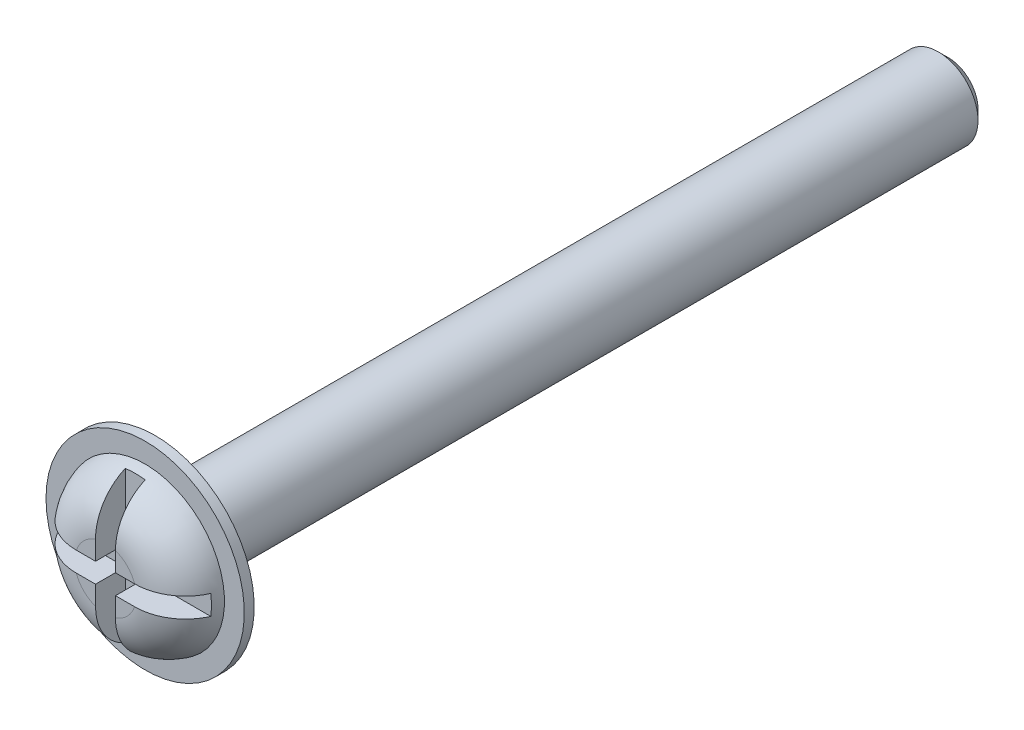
ISO-10303-21;
HEADER;
FILE_DESCRIPTION(('STEP AP214'),'2;1');
FILE_NAME('part.step','',(''),(''),'','','');
FILE_SCHEMA(('AUTOMOTIVE_DESIGN { 1 0 10303 214 1 1 1 1 }'));
ENDSEC;
DATA;
#1=APPLICATION_CONTEXT('core data for automotive mechanical design processes');
#2=APPLICATION_PROTOCOL_DEFINITION('international standard','automotive_design',2000,#1);
#3=PRODUCT_CONTEXT('',#1,'mechanical');
#4=PRODUCT('Part','Part','',(#3));
#5=PRODUCT_RELATED_PRODUCT_CATEGORY('part','',(#4));
#6=PRODUCT_DEFINITION_FORMATION('','',#4);
#7=PRODUCT_DEFINITION_CONTEXT('part definition',#1,'design');
#8=PRODUCT_DEFINITION('design','',#6,#7);
#9=PRODUCT_DEFINITION_SHAPE('','',#8);
#10=(LENGTH_UNIT() NAMED_UNIT(*) SI_UNIT(.MILLI.,.METRE.));
#11=(NAMED_UNIT(*) PLANE_ANGLE_UNIT() SI_UNIT($,.RADIAN.));
#12=(NAMED_UNIT(*) SI_UNIT($,.STERADIAN.) SOLID_ANGLE_UNIT());
#13=UNCERTAINTY_MEASURE_WITH_UNIT(LENGTH_MEASURE(1.E-05),#10,'distance_accuracy_value','');
#14=(GEOMETRIC_REPRESENTATION_CONTEXT(3) GLOBAL_UNCERTAINTY_ASSIGNED_CONTEXT((#13)) GLOBAL_UNIT_ASSIGNED_CONTEXT((#10,
#11,#12)) REPRESENTATION_CONTEXT('',''));
#15=CARTESIAN_POINT('',(0.,0.,0.));
#16=DIRECTION('',(0.,0.,1.));
#17=DIRECTION('',(1.,0.,0.));
#18=AXIS2_PLACEMENT_3D('',#15,#16,#17);
#19=CARTESIAN_POINT('',(0.,0.,81.));
#20=DIRECTION('',(0.,0.,-1.));
#21=DIRECTION('',(-1.,0.,0.));
#22=AXIS2_PLACEMENT_3D('',#19,#20,#21);
#23=CYLINDRICAL_SURFACE('',#22,3.99999999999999);
#24=CARTESIAN_POINT('',(0.,0.,80.));
#25=DIRECTION('',(0.,0.,-1.));
#26=DIRECTION('',(-1.,0.,0.));
#27=AXIS2_PLACEMENT_3D('',#24,#25,#26);
#28=CIRCLE('',#27,3.99999999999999);
#29=CARTESIAN_POINT('',(-3.99999999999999,0.,80.));
#30=VERTEX_POINT('',#29);
#31=EDGE_CURVE('E39',#30,#30,#28,.T.);
#32=ORIENTED_EDGE('',*,*,#31,.T.);
#33=EDGE_LOOP('',(#32));
#34=FACE_BOUND('',#33,.T.);
#35=CARTESIAN_POINT('',(0.,0.,1.));
#36=DIRECTION('',(0.,0.,1.));
#37=DIRECTION('',(1.,0.,0.));
#38=AXIS2_PLACEMENT_3D('',#35,#36,#37);
#39=CIRCLE('',#38,3.99999999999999);
#40=CARTESIAN_POINT('',(3.99999999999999,0.,1.));
#41=VERTEX_POINT('',#40);
#42=EDGE_CURVE('E185',#41,#41,#39,.T.);
#43=ORIENTED_EDGE('',*,*,#42,.T.);
#44=EDGE_LOOP('',(#43));
#45=FACE_BOUND('',#44,.T.);
#46=ADVANCED_FACE('F35',(#34,#45),#23,.T.);
#47=CARTESIAN_POINT('',(0.,0.,0.));
#48=DIRECTION('',(0.,0.,1.));
#49=DIRECTION('',(1.,0.,0.));
#50=AXIS2_PLACEMENT_3D('',#47,#48,#49);
#51=PLANE('',#50);
#52=CARTESIAN_POINT('',(0.,0.,0.));
#53=DIRECTION('',(0.,0.,1.));
#54=DIRECTION('',(1.,0.,0.));
#55=AXIS2_PLACEMENT_3D('',#52,#53,#54);
#56=CIRCLE('',#55,2.99999999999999);
#57=CARTESIAN_POINT('',(2.99999999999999,0.,0.));
#58=VERTEX_POINT('',#57);
#59=EDGE_CURVE('E190',#58,#58,#56,.F.);
#60=ORIENTED_EDGE('',*,*,#59,.T.);
#61=EDGE_LOOP('',(#60));
#62=FACE_BOUND('',#61,.T.);
#63=ADVANCED_FACE('F294',(#62),#51,.F.);
#64=CARTESIAN_POINT('',(0.,0.,1.));
#65=DIRECTION('',(0.,0.,1.));
#66=DIRECTION('',(1.,0.,0.));
#67=AXIS2_PLACEMENT_3D('',#64,#65,#66);
#68=CONICAL_SURFACE('',#67,3.99999999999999,0.785398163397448);
#69=ORIENTED_EDGE('',*,*,#59,.F.);
#70=EDGE_LOOP('',(#69));
#71=FACE_BOUND('',#70,.T.);
#72=ORIENTED_EDGE('',*,*,#42,.F.);
#73=EDGE_LOOP('',(#72));
#74=FACE_BOUND('',#73,.T.);
#75=ADVANCED_FACE('F37',(#71,#74),#68,.T.);
#76=CARTESIAN_POINT('',(0.,0.,80.));
#77=DIRECTION('',(0.,0.,-1.));
#78=DIRECTION('',(-1.,0.,0.));
#79=AXIS2_PLACEMENT_3D('',#76,#77,#78);
#80=PLANE('',#79);
#81=CARTESIAN_POINT('',(0.,0.,80.));
#82=DIRECTION('',(0.,0.,-1.));
#83=DIRECTION('',(-1.,0.,0.));
#84=AXIS2_PLACEMENT_3D('',#81,#82,#83);
#85=CIRCLE('',#84,9.99999999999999);
#86=CARTESIAN_POINT('',(-9.99999999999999,0.,80.));
#87=VERTEX_POINT('',#86);
#88=EDGE_CURVE('E316',#87,#87,#85,.T.);
#89=ORIENTED_EDGE('',*,*,#88,.T.);
#90=EDGE_LOOP('',(#89));
#91=FACE_BOUND('',#90,.T.);
#92=ORIENTED_EDGE('',*,*,#31,.F.);
#93=EDGE_LOOP('',(#92));
#94=FACE_BOUND('',#93,.T.);
#95=ADVANCED_FACE('F284',(#91,#94),#80,.T.);
#96=CARTESIAN_POINT('',(0.,0.,80.));
#97=DIRECTION('',(0.,0.,1.));
#98=DIRECTION('',(1.,0.,0.));
#99=AXIS2_PLACEMENT_3D('',#96,#97,#98);
#100=CYLINDRICAL_SURFACE('',#99,9.99999999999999);
#101=ORIENTED_EDGE('',*,*,#88,.F.);
#102=EDGE_LOOP('',(#101));
#103=FACE_BOUND('',#102,.T.);
#104=CARTESIAN_POINT('',(0.,0.,81.));
#105=DIRECTION('',(0.,0.,-1.));
#106=DIRECTION('',(-1.,0.,0.));
#107=AXIS2_PLACEMENT_3D('',#104,#105,#106);
#108=CIRCLE('',#107,9.99999999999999);
#109=CARTESIAN_POINT('',(-9.99999999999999,0.,81.));
#110=VERTEX_POINT('',#109);
#111=EDGE_CURVE('E321',#110,#110,#108,.T.);
#112=ORIENTED_EDGE('',*,*,#111,.T.);
#113=EDGE_LOOP('',(#112));
#114=FACE_BOUND('',#113,.T.);
#115=ADVANCED_FACE('F280',(#103,#114),#100,.T.);
#116=CARTESIAN_POINT('',(0.,0.,81.));
#117=DIRECTION('',(0.,0.,-1.));
#118=DIRECTION('',(-1.,0.,0.));
#119=AXIS2_PLACEMENT_3D('',#116,#117,#118);
#120=PLANE('',#119);
#121=CARTESIAN_POINT('',(0.,0.,81.));
#122=DIRECTION('',(0.,0.,-1.));
#123=DIRECTION('',(-1.,0.,0.));
#124=AXIS2_PLACEMENT_3D('',#121,#122,#123);
#125=CIRCLE('',#124,8.);
#126=CARTESIAN_POINT('',(-8.,0.,81.));
#127=VERTEX_POINT('',#126);
#128=EDGE_CURVE('E310',#127,#127,#125,.F.);
#129=ORIENTED_EDGE('',*,*,#128,.F.);
#130=EDGE_LOOP('',(#129));
#131=FACE_BOUND('',#130,.T.);
#132=ORIENTED_EDGE('',*,*,#111,.F.);
#133=EDGE_LOOP('',(#132));
#134=FACE_BOUND('',#133,.T.);
#135=ADVANCED_FACE('F283',(#131,#134),#120,.F.);
#136=CARTESIAN_POINT('',(0.,0.,85.));
#137=DIRECTION('',(0.,0.,1.));
#138=DIRECTION('',(1.,0.,0.));
#139=AXIS2_PLACEMENT_3D('',#136,#137,#138);
#140=PLANE('',#139);
#141=DIRECTION('',(1.,0.,0.));
#142=VECTOR('',#141,1.);
#143=CARTESIAN_POINT('',(1.00475630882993,-1.,85.));
#144=LINE('',#143,#142);
#145=CARTESIAN_POINT('',(1.00475630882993,-1.,85.));
#146=VERTEX_POINT('',#145);
#147=CARTESIAN_POINT('',(2.93535827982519,-1.,85.));
#148=VERTEX_POINT('',#147);
#149=EDGE_CURVE('E168',#146,#148,#144,.T.);
#150=ORIENTED_EDGE('',*,*,#149,.F.);
#151=DIRECTION('',(0.,1.,0.));
#152=VECTOR('',#151,1.);
#153=CARTESIAN_POINT('',(1.00475630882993,-1.,85.));
#154=LINE('',#153,#152);
#155=CARTESIAN_POINT('',(1.00475630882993,-2.93373362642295,85.));
#156=VERTEX_POINT('',#155);
#157=EDGE_CURVE('E166',#156,#146,#154,.T.);
#158=ORIENTED_EDGE('',*,*,#157,.F.);
#159=CARTESIAN_POINT('',(0.,0.,85.));
#160=DIRECTION('',(0.,0.,1.));
#161=DIRECTION('',(1.,0.,0.));
#162=AXIS2_PLACEMENT_3D('',#159,#160,#161);
#163=CIRCLE('',#162,3.10102051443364);
#164=EDGE_CURVE('E176',#156,#148,#163,.T.);
#165=ORIENTED_EDGE('',*,*,#164,.T.);
#166=EDGE_LOOP('',(#150,#158,#165));
#167=FACE_BOUND('',#166,.T.);
#168=ADVANCED_FACE('F219',(#167),#140,.T.);
#169=CARTESIAN_POINT('',(1.00475630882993,-1.,82.));
#170=DIRECTION('',(0.,-1.,0.));
#171=DIRECTION('',(1.,0.,0.));
#172=AXIS2_PLACEMENT_3D('',#169,#170,#171);
#173=PLANE('',#172);
#174=CARTESIAN_POINT('',(4.9654623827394,-1.,84.5980612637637));
#175=CARTESIAN_POINT('',(5.09630224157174,-1.,84.5432746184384));
#176=CARTESIAN_POINT('',(5.22481632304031,-1.,84.4830220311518));
#177=CARTESIAN_POINT('',(5.47636824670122,-1.,84.3519127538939));
#178=CARTESIAN_POINT('',(5.59940513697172,-1.,84.2810542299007));
#179=CARTESIAN_POINT('',(5.83910121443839,-1.,84.129173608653));
#180=CARTESIAN_POINT('',(5.95575785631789,-1.,84.0481474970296));
#181=CARTESIAN_POINT('',(6.181827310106,-1.,83.8764685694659));
#182=CARTESIAN_POINT('',(6.29123751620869,-1.,83.7858123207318));
#183=CARTESIAN_POINT('',(6.50177032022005,-1.,83.5956948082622));
#184=CARTESIAN_POINT('',(6.6029071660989,-1.,83.4962493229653));
#185=CARTESIAN_POINT('',(6.79639506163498,-1.,83.2890792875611));
#186=CARTESIAN_POINT('',(6.8887428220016,-1.,83.1813516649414));
#187=CARTESIAN_POINT('',(7.06387541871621,-1.,82.9584807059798));
#188=CARTESIAN_POINT('',(7.14666548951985,-1.,82.8433414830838));
#189=CARTESIAN_POINT('',(7.30215506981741,-1.,82.6063786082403));
#190=CARTESIAN_POINT('',(7.37485085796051,-1.,82.4845525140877));
#191=CARTESIAN_POINT('',(7.50883923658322,-1.,82.236497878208));
#192=CARTESIAN_POINT('',(7.57024750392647,-1.,82.1103318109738));
#193=CARTESIAN_POINT('',(7.68220053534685,-1.,81.853215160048));
#194=CARTESIAN_POINT('',(7.73274130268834,-1.,81.7222628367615));
#195=CARTESIAN_POINT('',(7.82254457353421,-1.,81.456591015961));
#196=CARTESIAN_POINT('',(7.86181124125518,-1.,81.3218729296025));
#197=CARTESIAN_POINT('',(7.92881779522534,-1.,81.0495819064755));
#198=CARTESIAN_POINT('',(7.95655336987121,-1.,80.9120079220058));
#199=CARTESIAN_POINT('',(8.02190850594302,-1.,80.4977125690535));
#200=CARTESIAN_POINT('',(8.04213698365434,-1.,80.2180496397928));
#201=CARTESIAN_POINT('',(8.03523113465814,-1.,79.659313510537));
#202=CARTESIAN_POINT('',(8.00809764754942,-1.,79.3802403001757));
#203=CARTESIAN_POINT('',(7.93265700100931,-1.,78.9683967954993));
#204=CARTESIAN_POINT('',(7.90172021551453,-1.,78.832243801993));
#205=CARTESIAN_POINT('',(7.8285022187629,-1.,78.5630415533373));
#206=CARTESIAN_POINT('',(7.78622525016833,-1.,78.4299911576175));
#207=CARTESIAN_POINT('',(7.69060882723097,-1.,78.1678771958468));
#208=CARTESIAN_POINT('',(7.63726502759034,-1.,78.0388152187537));
#209=CARTESIAN_POINT('',(7.51993201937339,-1.,77.7856796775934));
#210=CARTESIAN_POINT('',(7.45594671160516,-1.,77.661604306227));
#211=CARTESIAN_POINT('',(7.31767640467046,-1.,77.4190891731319));
#212=CARTESIAN_POINT('',(7.2433763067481,-1.,77.3006580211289));
#213=CARTESIAN_POINT('',(7.08511463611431,-1.,77.0705013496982));
#214=CARTESIAN_POINT('',(7.00115658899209,-1.,76.9587734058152));
#215=CARTESIAN_POINT('',(6.82414418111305,-1.,76.7427328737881));
#216=CARTESIAN_POINT('',(6.73108789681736,-1.,76.6384218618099));
#217=CARTESIAN_POINT('',(6.53659972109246,-1.,76.4379986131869));
#218=CARTESIAN_POINT('',(6.43517085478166,-1.,76.3418834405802));
#219=CARTESIAN_POINT('',(6.22421668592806,-1.,76.1580989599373));
#220=CARTESIAN_POINT('',(6.11466070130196,-1.,76.0704648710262));
#221=CARTESIAN_POINT('',(5.88864242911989,-1.,75.9046994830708));
#222=CARTESIAN_POINT('',(5.77218260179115,-1.,75.8265648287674));
#223=CARTESIAN_POINT('',(5.53303551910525,-1.,75.680198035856));
#224=CARTESIAN_POINT('',(5.41034202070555,-1.,75.6119760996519));
#225=CARTESIAN_POINT('',(5.15975682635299,-1.,75.4859766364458));
#226=CARTESIAN_POINT('',(5.0318668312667,-1.,75.4281957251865));
#227=CARTESIAN_POINT('',(4.77027434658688,-1.,75.3227844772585));
#228=CARTESIAN_POINT('',(4.63652222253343,-1.,75.2752773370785));
#229=CARTESIAN_POINT('',(4.36554410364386,-1.,75.1914915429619));
#230=CARTESIAN_POINT('',(4.22831797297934,-1.,75.155213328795));
#231=CARTESIAN_POINT('',(3.95176742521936,-1.,75.0940905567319));
#232=CARTESIAN_POINT('',(3.8124503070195,-1.,75.069212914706));
#233=CARTESIAN_POINT('',(3.53227023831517,-1.,75.030707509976));
#234=CARTESIAN_POINT('',(3.39140721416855,-1.,75.0170802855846));
#235=CARTESIAN_POINT('',(3.10520694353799,-1.,75.0006633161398));
#236=CARTESIAN_POINT('',(2.95985233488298,-1.,74.9981788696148));
#237=CARTESIAN_POINT('',(2.66934924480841,-1.,75.0044230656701));
#238=CARTESIAN_POINT('',(2.52420085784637,-1.,75.0131557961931));
#239=CARTESIAN_POINT('',(2.23353576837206,-1.,75.0411787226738));
#240=CARTESIAN_POINT('',(2.08802890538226,-1.,75.060569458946));
#241=CARTESIAN_POINT('',(1.87102989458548,-1.,75.0964978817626));
#242=CARTESIAN_POINT('',(1.79894360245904,-1.,75.1096059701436));
#243=CARTESIAN_POINT('',(1.65516118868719,-1.,75.1378135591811));
#244=CARTESIAN_POINT('',(1.5834650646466,-1.,75.1529130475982));
#245=CARTESIAN_POINT('',(1.4430314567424,-1.,75.1841475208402));
#246=CARTESIAN_POINT('',(1.37428102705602,-1.,75.2002250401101));
#247=CARTESIAN_POINT('',(1.23703244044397,-1.,75.2334034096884));
#248=CARTESIAN_POINT('',(1.16853427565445,-1.,75.2505042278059));
#249=CARTESIAN_POINT('',(1.03140896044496,-1.,75.2851202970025));
#250=CARTESIAN_POINT('',(0.962782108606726,-1.,75.3026367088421));
#251=CARTESIAN_POINT('',(0.82536088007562,-1.,75.3370751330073));
#252=CARTESIAN_POINT('',(0.756566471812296,-1.,75.3539970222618));
#253=CARTESIAN_POINT('',(0.619991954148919,-1.,75.3855390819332));
#254=CARTESIAN_POINT('',(0.552221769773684,-1.,75.4002008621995));
#255=CARTESIAN_POINT('',(0.415994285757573,-1.,75.4259473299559));
#256=CARTESIAN_POINT('',(0.347537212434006,-1.,75.4370331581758));
#257=CARTESIAN_POINT('',(0.2104137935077,-1.,75.4536951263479));
#258=CARTESIAN_POINT('',(0.14175254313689,-1.,75.4593105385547));
#259=CARTESIAN_POINT('',(0.00421924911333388,-1.,75.4639317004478));
#260=CARTESIAN_POINT('',(-0.0646526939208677,-1.,75.4629402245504));
#261=CARTESIAN_POINT('',(-0.20234465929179,-1.,75.454568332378));
#262=CARTESIAN_POINT('',(-0.271162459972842,-1.,75.447153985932));
#263=CARTESIAN_POINT('',(-0.40810241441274,-1.,75.4274296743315));
#264=CARTESIAN_POINT('',(-0.476223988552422,-1.,75.415115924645));
#265=CARTESIAN_POINT('',(-0.612377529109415,-1.,75.3873511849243));
#266=CARTESIAN_POINT('',(-0.680404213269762,-1.,75.3718753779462));
#267=CARTESIAN_POINT('',(-0.816076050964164,-1.,75.3394614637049));
#268=CARTESIAN_POINT('',(-0.883721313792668,-1.,75.3225238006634));
#269=CARTESIAN_POINT('',(-1.0205383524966,-1.,75.2879565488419));
#270=CARTESIAN_POINT('',(-1.08970835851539,-1.,75.2703200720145));
#271=CARTESIAN_POINT('',(-1.22819903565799,-1.,75.2356337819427));
#272=CARTESIAN_POINT('',(-1.29751971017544,-1.,75.218583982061));
#273=CARTESIAN_POINT('',(-1.4362118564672,-1.,75.1857499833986));
#274=CARTESIAN_POINT('',(-1.50558232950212,-1.,75.1699616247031));
#275=CARTESIAN_POINT('',(-1.64467440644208,-1.,75.1400206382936));
#276=CARTESIAN_POINT('',(-1.71439600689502,-1.,75.1258679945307));
#277=CARTESIAN_POINT('',(-1.92285784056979,-1.,75.086600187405));
#278=CARTESIAN_POINT('',(-2.06216194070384,-1.,75.0643621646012));
#279=CARTESIAN_POINT('',(-2.3420988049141,-1.,75.0292293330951));
#280=CARTESIAN_POINT('',(-2.48273270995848,-1.,75.0163434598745));
#281=CARTESIAN_POINT('',(-2.76404562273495,-1.,75.0008998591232));
#282=CARTESIAN_POINT('',(-2.90472240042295,-1.,74.9983028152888));
#283=CARTESIAN_POINT('',(-3.1858619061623,-1.,75.0038713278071));
#284=CARTESIAN_POINT('',(-3.3263246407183,-1.,75.0120365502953));
#285=CARTESIAN_POINT('',(-3.6340975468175,-1.,75.042156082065));
#286=CARTESIAN_POINT('',(-3.8011779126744,-1.,75.0665346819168));
#287=CARTESIAN_POINT('',(-4.13223489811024,-1.,75.1313617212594));
#288=CARTESIAN_POINT('',(-4.29621075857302,-1.,75.1718140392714));
#289=CARTESIAN_POINT('',(-4.61938135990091,-1.,75.2686332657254));
#290=CARTESIAN_POINT('',(-4.77857664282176,-1.,75.324998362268));
#291=CARTESIAN_POINT('',(-5.09056852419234,-1.,75.4532466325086));
#292=CARTESIAN_POINT('',(-5.24336630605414,-1.,75.5251269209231));
#293=CARTESIAN_POINT('',(-5.52037508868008,-1.,75.6727905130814));
#294=CARTESIAN_POINT('',(-5.64561403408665,-1.,75.7466538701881));
#295=CARTESIAN_POINT('',(-5.88928019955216,-1.,75.9049656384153));
#296=CARTESIAN_POINT('',(-6.00770521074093,-1.,75.9894174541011));
#297=CARTESIAN_POINT('',(-6.23672952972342,-1.,76.1682475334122));
#298=CARTESIAN_POINT('',(-6.34733193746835,-1.,76.2626218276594));
#299=CARTESIAN_POINT('',(-6.55994614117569,-1.,76.4606739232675));
#300=CARTESIAN_POINT('',(-6.66195480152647,-1.00000000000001,76.5643550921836));
#301=CARTESIAN_POINT('',(-6.85373162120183,-1.00000000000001,76.77710317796));
#302=CARTESIAN_POINT('',(-6.94376797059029,-1.00000000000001,76.8859284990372));
#303=CARTESIAN_POINT('',(-7.11431494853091,-1.00000000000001,77.1108676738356));
#304=CARTESIAN_POINT('',(-7.19482212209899,-1.00000000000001,77.2269841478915));
#305=CARTESIAN_POINT('',(-7.34563321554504,-1.00000000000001,77.4655682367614));
#306=CARTESIAN_POINT('',(-7.41594311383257,-1.00000000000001,77.588032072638));
#307=CARTESIAN_POINT('',(-7.54592158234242,-1.00000000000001,77.8385402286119));
#308=CARTESIAN_POINT('',(-7.60558623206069,-1.00000000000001,77.9665865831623));
#309=CARTESIAN_POINT('',(-7.71334864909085,-1.00000000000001,78.2262032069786));
#310=CARTESIAN_POINT('',(-7.7615388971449,-1.00000000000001,78.357735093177));
#311=CARTESIAN_POINT('',(-7.84665582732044,-1.00000000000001,78.6244456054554));
#312=CARTESIAN_POINT('',(-7.88357836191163,-1.00000000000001,78.7596255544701));
#313=CARTESIAN_POINT('',(-7.94585554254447,-1.00000000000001,79.0325885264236));
#314=CARTESIAN_POINT('',(-7.97121384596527,-1.00000000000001,79.1703707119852));
#315=CARTESIAN_POINT('',(-8.01020764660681,-1.00000000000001,79.4476018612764));
#316=CARTESIAN_POINT('',(-8.02383875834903,-1.00000000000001,79.5870514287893));
#317=CARTESIAN_POINT('',(-8.04688385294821,-1.00000000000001,80.0054533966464));
#318=CARTESIAN_POINT('',(-8.03870183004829,-1.00000000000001,80.285570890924));
#319=CARTESIAN_POINT('',(-7.97533615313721,-1.00000000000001,80.8404276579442));
#320=CARTESIAN_POINT('',(-7.92015413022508,-1.00000000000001,81.1151671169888));
#321=CARTESIAN_POINT('',(-7.80352999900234,-1.00000000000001,81.517138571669));
#322=CARTESIAN_POINT('',(-7.75899357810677,-1.00000000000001,81.6494805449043));
#323=CARTESIAN_POINT('',(-7.65895266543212,-1.00000000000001,81.9099327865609));
#324=CARTESIAN_POINT('',(-7.6034522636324,-1.00000000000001,82.0380446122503));
#325=CARTESIAN_POINT('',(-7.48185422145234,-1.00000000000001,82.289189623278));
#326=CARTESIAN_POINT('',(-7.41575231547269,-1.00000000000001,82.4122207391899));
#327=CARTESIAN_POINT('',(-7.27346934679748,-1.00000000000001,82.6522514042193));
#328=CARTESIAN_POINT('',(-7.19729196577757,-1.00000000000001,82.7692531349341));
#329=CARTESIAN_POINT('',(-7.03521151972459,-1.00000000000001,82.9967000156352));
#330=CARTESIAN_POINT('',(-6.94928753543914,-1.00000000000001,83.1071302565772));
#331=CARTESIAN_POINT('',(-6.76850335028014,-1.00000000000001,83.3203467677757));
#332=CARTESIAN_POINT('',(-6.67364639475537,-1.,83.423135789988));
#333=CARTESIAN_POINT('',(-6.47563541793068,-1.,83.6204225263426));
#334=CARTESIAN_POINT('',(-6.37247984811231,-1.,83.7149186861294));
#335=CARTESIAN_POINT('',(-6.1586678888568,-1.,83.8949222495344));
#336=CARTESIAN_POINT('',(-6.04801418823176,-1.,83.9804328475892));
#337=CARTESIAN_POINT('',(-5.81936598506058,-1.,84.1423589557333));
#338=CARTESIAN_POINT('',(-5.70133594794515,-1.,84.2187242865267));
#339=CARTESIAN_POINT('',(-5.45935773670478,-1.,84.3613115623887));
#340=CARTESIAN_POINT('',(-5.33541164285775,-1.,84.4275370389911));
#341=CARTESIAN_POINT('',(-5.08231104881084,-1.,84.549535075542));
#342=CARTESIAN_POINT('',(-4.95315096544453,-1.,84.6052960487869));
#343=CARTESIAN_POINT('',(-4.69071177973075,-1.,84.7059451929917));
#344=CARTESIAN_POINT('',(-4.55743399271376,-1.,84.7508367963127));
#345=CARTESIAN_POINT('',(-4.28560302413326,-1.,84.8301625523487));
#346=CARTESIAN_POINT('',(-4.147000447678,-1.,84.8644273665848));
#347=CARTESIAN_POINT('',(-3.86744989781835,-1.,84.9214734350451));
#348=CARTESIAN_POINT('',(-3.72650181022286,-1.,84.9442541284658));
#349=CARTESIAN_POINT('',(-3.4437181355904,-1.,84.9783321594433));
#350=CARTESIAN_POINT('',(-3.30188718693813,-1.,84.9896682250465));
#351=CARTESIAN_POINT('',(-3.01777594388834,-1.,85.0012306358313));
#352=CARTESIAN_POINT('',(-2.87549564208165,-1.,85.0014567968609));
#353=CARTESIAN_POINT('',(-2.6172412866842,-1.,84.9922151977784));
#354=CARTESIAN_POINT('',(-2.50119876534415,-1.,84.9845066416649));
#355=CARTESIAN_POINT('',(-2.26974246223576,-1.,84.9624256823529));
#356=CARTESIAN_POINT('',(-2.15432875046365,-1.,84.9480525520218));
#357=CARTESIAN_POINT('',(-1.92340644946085,-1.,84.9131640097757));
#358=CARTESIAN_POINT('',(-1.80790600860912,-1.,84.8925955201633));
#359=CARTESIAN_POINT('',(-1.57800325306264,-1.,84.84645385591));
#360=CARTESIAN_POINT('',(-1.46360031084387,-1.,84.8208837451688));
#361=CARTESIAN_POINT('',(-1.28848963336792,-1.,84.7791780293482));
#362=CARTESIAN_POINT('',(-1.22750461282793,-1.,84.764171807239));
#363=CARTESIAN_POINT('',(-1.10565122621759,-1.,84.7336908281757));
#364=CARTESIAN_POINT('',(-1.04478286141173,-1.,84.7182160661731));
#365=CARTESIAN_POINT('',(-0.922883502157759,-1.,84.6873447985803));
#366=CARTESIAN_POINT('',(-0.861852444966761,-1.,84.6719485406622));
#367=CARTESIAN_POINT('',(-0.739552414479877,-1.,84.6420747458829));
#368=CARTESIAN_POINT('',(-0.678283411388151,-1.,84.6275973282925));
#369=CARTESIAN_POINT('',(-0.556519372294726,-1.,84.6009153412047));
#370=CARTESIAN_POINT('',(-0.496033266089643,-1.,84.5886712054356));
#371=CARTESIAN_POINT('',(-0.374493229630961,-1.,84.567374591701));
#372=CARTESIAN_POINT('',(-0.313439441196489,-1.,84.5583213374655));
#373=CARTESIAN_POINT('',(-0.191140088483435,-1.,84.5447327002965));
#374=CARTESIAN_POINT('',(-0.129897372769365,-1.,84.5401730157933));
#375=CARTESIAN_POINT('',(-0.00725133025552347,-1.,84.5362967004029));
#376=CARTESIAN_POINT('',(0.0541519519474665,-1.,84.5369787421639));
#377=CARTESIAN_POINT('',(0.176966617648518,-1.,84.5434688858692));
#378=CARTESIAN_POINT('',(0.238376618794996,-1.,84.5493016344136));
#379=CARTESIAN_POINT('',(0.360662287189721,-1.,84.5651319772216));
#380=CARTESIAN_POINT('',(0.421537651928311,-1.,84.5751317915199));
#381=CARTESIAN_POINT('',(0.54310423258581,-1.,84.5980451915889));
#382=CARTESIAN_POINT('',(0.603792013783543,-1.,84.6109763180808));
#383=CARTESIAN_POINT('',(0.724773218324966,-1.,84.6384851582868));
#384=CARTESIAN_POINT('',(0.785066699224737,-1.,84.6530626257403));
#385=CARTESIAN_POINT('',(0.906936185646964,-1.,84.6832586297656));
#386=CARTESIAN_POINT('',(0.968507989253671,-1.,84.6988938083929));
#387=CARTESIAN_POINT('',(1.09166449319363,-1.,84.7301094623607));
#388=CARTESIAN_POINT('',(1.15324919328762,-1.,84.7456899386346));
#389=CARTESIAN_POINT('',(1.27640659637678,-1.,84.7761981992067));
#390=CARTESIAN_POINT('',(1.33797888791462,-1.,84.7911276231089));
#391=CARTESIAN_POINT('',(1.46135934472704,-1.,84.8199749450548));
#392=CARTESIAN_POINT('',(1.52316750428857,-1.,84.8338928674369));
#393=CARTESIAN_POINT('',(1.67292271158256,-1.,84.8659475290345));
#394=CARTESIAN_POINT('',(1.76101463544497,-1.,84.8834212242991));
#395=CARTESIAN_POINT('',(1.93777900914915,-1.,84.9151182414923));
#396=CARTESIAN_POINT('',(2.02645145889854,-1.,84.929341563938));
#397=CARTESIAN_POINT('',(2.29342236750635,-1.,84.9665031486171));
#398=CARTESIAN_POINT('',(2.47254376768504,-1.,84.9839036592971));
#399=CARTESIAN_POINT('',(2.83034509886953,-1.,85.0017997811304));
#400=CARTESIAN_POINT('',(3.00901871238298,-1.,85.0024178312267));
#401=CARTESIAN_POINT('',(3.36548729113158,-1.,84.9861106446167));
#402=CARTESIAN_POINT('',(3.5432826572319,-1.,84.9691943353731));
#403=CARTESIAN_POINT('',(3.93339144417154,-1.,84.9119689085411));
#404=CARTESIAN_POINT('',(4.14510842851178,-1.,84.8674915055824));
#405=CARTESIAN_POINT('',(4.56150679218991,-1.,84.752270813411));
#406=CARTESIAN_POINT('',(4.76618224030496,-1.,84.6815059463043));
#407=CARTESIAN_POINT('',(4.9654623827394,-1.,84.5980612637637));
#408=B_SPLINE_CURVE_WITH_KNOTS('',3,(#174,#175,#176,#177,#178,#179,#180,#181,#182,#183,#184,
#185,#186,#187,#188,#189,#190,#191,#192,#193,#194,#195,#196,#197,#198,#199,#200,#201,#202,#203,
#204,#205,#206,#207,#208,#209,#210,#211,#212,#213,#214,#215,#216,#217,#218,#219,#220,#221,#222,
#223,#224,#225,#226,#227,#228,#229,#230,#231,#232,#233,#234,#235,#236,#237,#238,#239,#240,#241,
#242,#243,#244,#245,#246,#247,#248,#249,#250,#251,#252,#253,#254,#255,#256,#257,#258,#259,#260,
#261,#262,#263,#264,#265,#266,#267,#268,#269,#270,#271,#272,#273,#274,#275,#276,#277,#278,#279,
#280,#281,#282,#283,#284,#285,#286,#287,#288,#289,#290,#291,#292,#293,#294,#295,#296,#297,#298,
#299,#300,#301,#302,#303,#304,#305,#306,#307,#308,#309,#310,#311,#312,#313,#314,#315,#316,#317,
#318,#319,#320,#321,#322,#323,#324,#325,#326,#327,#328,#329,#330,#331,#332,#333,#334,#335,#336,
#337,#338,#339,#340,#341,#342,#343,#344,#345,#346,#347,#348,#349,#350,#351,#352,#353,#354,#355,
#356,#357,#358,#359,#360,#361,#362,#363,#364,#365,#366,#367,#368,#369,#370,#371,#372,#373,#374,
#375,#376,#377,#378,#379,#380,#381,#382,#383,#384,#385,#386,#387,#388,#389,#390,#391,#392,#393,
#394,#395,#396,#397,#398,#399,#400,#401,#402,#403,#404,#405,#406,#407),.UNSPECIFIED.,.T.,.F.,(4,
2,2,2,2,2,2,2,2,2,2,2,2,2,2,2,2,2,2,2,2,2,2,2,2,2,2,2,2,2,2,2,2,2,2,2,2,2,2,2,2,2,2,2,2,2,2,2,2,
2,2,2,2,2,2,2,2,2,2,2,2,2,2,2,2,2,2,2,2,2,2,2,2,2,2,2,2,2,2,2,2,2,2,2,2,2,2,2,2,2,2,2,2,2,2,2,2,
2,2,2,2,2,2,2,2,2,2,2,2,2,2,2,2,2,2,2,4),(0.,0.425357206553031,0.850788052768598,
1.27638739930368,1.70213896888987,2.12714117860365,2.5523018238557,2.97722850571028,
3.40231142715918,3.82276012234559,4.24336318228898,4.66381068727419,5.08441526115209,
5.92134918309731,6.75826826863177,7.17672493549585,7.59502526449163,8.01349014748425,
8.43180197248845,8.85073270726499,9.26951099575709,9.68837801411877,10.1070943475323,
10.5274809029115,10.9477185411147,11.3683856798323,11.7889162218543,12.2142397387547,
12.6395799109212,13.0636778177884,13.4877960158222,13.9234662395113,14.3592952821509,
14.7993080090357,15.0190899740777,15.2388705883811,15.4506751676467,15.6624730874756,
15.874955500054,16.0874816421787,16.2954458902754,16.5033437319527,16.7097378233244,
16.9160452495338,17.1234492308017,17.3310137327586,17.5402745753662,17.7494720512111,
17.9636215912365,18.177776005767,18.3911922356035,18.6046063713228,19.0275247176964,
19.450846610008,19.8725493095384,20.2942389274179,20.799989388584,21.3058619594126,
21.8116769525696,22.3173979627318,22.7530648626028,23.1888722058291,23.6245058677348,
24.0602977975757,24.4835201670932,24.9068955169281,25.3300216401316,25.753303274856,
26.1730482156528,26.5929474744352,27.0127138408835,27.4326371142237,28.2691071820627,
29.1055482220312,29.524039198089,29.9423743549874,30.3608782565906,30.7792296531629,
31.1984965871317,31.617611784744,32.0368053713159,32.4558494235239,32.8770965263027,
33.2981965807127,33.7197601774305,34.1411904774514,34.569026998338,34.996884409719,
35.4232890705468,35.8497007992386,36.1983990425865,36.547135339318,36.8989487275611,
37.2505472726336,37.4389585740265,37.6273719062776,37.81620053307,38.0050536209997,
38.1901407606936,38.3751828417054,38.5592186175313,38.7432077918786,38.9280821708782,
39.1130551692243,39.2991657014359,39.4852484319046,39.6758262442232,39.8664007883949,
40.0564638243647,40.2465222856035,40.5158895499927,40.785256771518,41.3243917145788,
41.8595922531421,42.3945204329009,43.0418428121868,43.6896977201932),.UNSPECIFIED.);
#409=CARTESIAN_POINT('',(7.61824459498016,-1.,82.));
#410=VERTEX_POINT('',#409);
#411=EDGE_CURVE('E198',#148,#410,#408,.T.);
#412=ORIENTED_EDGE('',*,*,#411,.T.);
#413=DIRECTION('',(1.,0.,0.));
#414=VECTOR('',#413,1.);
#415=CARTESIAN_POINT('',(1.00475630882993,-1.,82.));
#416=LINE('',#415,#414);
#417=CARTESIAN_POINT('',(1.00475630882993,-1.,82.));
#418=VERTEX_POINT('',#417);
#419=EDGE_CURVE('E51',#418,#410,#416,.T.);
#420=ORIENTED_EDGE('',*,*,#419,.F.);
#421=DIRECTION('',(0.,0.,1.));
#422=VECTOR('',#421,1.);
#423=CARTESIAN_POINT('',(1.00475630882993,-1.,82.));
#424=LINE('',#423,#422);
#425=EDGE_CURVE('E177',#418,#146,#424,.T.);
#426=ORIENTED_EDGE('',*,*,#425,.T.);
#427=ORIENTED_EDGE('',*,*,#149,.T.);
#428=EDGE_LOOP('',(#412,#420,#426,#427));
#429=FACE_BOUND('',#428,.T.);
#430=ADVANCED_FACE('F214',(#429),#173,.F.);
#431=CARTESIAN_POINT('',(1.00475630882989,1.,82.));
#432=DIRECTION('',(0.,1.,0.));
#433=DIRECTION('',(0.,0.,1.));
#434=AXIS2_PLACEMENT_3D('',#431,#432,#433);
#435=PLANE('',#434);
#436=CARTESIAN_POINT('',(4.96546238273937,1.,84.5980612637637));
#437=CARTESIAN_POINT('',(4.83141505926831,1.,84.6541945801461));
#438=CARTESIAN_POINT('',(4.69496078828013,1.,84.7045807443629));
#439=CARTESIAN_POINT('',(4.41821450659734,1.,84.7936041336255));
#440=CARTESIAN_POINT('',(4.27792094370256,1.,84.8322365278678));
#441=CARTESIAN_POINT('',(3.99474265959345,1.,84.8975502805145));
#442=CARTESIAN_POINT('',(3.85186088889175,1.,84.9242444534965));
#443=CARTESIAN_POINT('',(3.56442345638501,1.,84.9657506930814));
#444=CARTESIAN_POINT('',(3.41986820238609,1.,84.9805655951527));
#445=CARTESIAN_POINT('',(3.13013607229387,1.,84.9985142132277));
#446=CARTESIAN_POINT('',(2.98495965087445,1.,85.0016553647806));
#447=CARTESIAN_POINT('',(2.69475686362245,1.,84.9967158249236));
#448=CARTESIAN_POINT('',(2.54973058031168,1.,84.9886306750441));
#449=CARTESIAN_POINT('',(2.25935194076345,1.,84.9618792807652));
#450=CARTESIAN_POINT('',(2.11400845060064,1.,84.9431182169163));
#451=CARTESIAN_POINT('',(1.89724247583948,1.,84.9080739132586));
#452=CARTESIAN_POINT('',(1.82523436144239,1.,84.8952509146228));
#453=CARTESIAN_POINT('',(1.68160740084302,1.,84.8675818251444));
#454=CARTESIAN_POINT('',(1.60998855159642,1.,84.8527357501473));
#455=CARTESIAN_POINT('',(1.46815766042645,1.,84.8216099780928));
#456=CARTESIAN_POINT('',(1.39794029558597,1.,84.8053542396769));
#457=CARTESIAN_POINT('',(1.25778184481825,1.,84.7717143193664));
#458=CARTESIAN_POINT('',(1.18784074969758,1.,84.7543301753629));
#459=CARTESIAN_POINT('',(1.04783614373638,1.,84.7190570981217));
#460=CARTESIAN_POINT('',(0.977773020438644,1.,84.7011666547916));
#461=CARTESIAN_POINT('',(0.8374909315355,1.,84.6659262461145));
#462=CARTESIAN_POINT('',(0.767271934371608,1.,84.6485764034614));
#463=CARTESIAN_POINT('',(0.627869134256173,1.,84.6161938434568));
#464=CARTESIAN_POINT('',(0.558695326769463,1.,84.601119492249));
#465=CARTESIAN_POINT('',(0.419636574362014,1.,84.5746514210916));
#466=CARTESIAN_POINT('',(0.349751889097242,1.,84.5632564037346));
#467=CARTESIAN_POINT('',(0.209767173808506,1.,84.5462063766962));
#468=CARTESIAN_POINT('',(0.139672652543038,1.,84.5405091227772));
#469=CARTESIAN_POINT('',(-0.000725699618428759,1.,84.5360178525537));
#470=CARTESIAN_POINT('',(-0.0710294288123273,1.,84.5372209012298));
#471=CARTESIAN_POINT('',(-0.210589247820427,1.,84.5461856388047));
#472=CARTESIAN_POINT('',(-0.279849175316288,1.,84.5538920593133));
#473=CARTESIAN_POINT('',(-0.417660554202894,1.,84.5741831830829));
#474=CARTESIAN_POINT('',(-0.48621141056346,1.,84.586771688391));
#475=CARTESIAN_POINT('',(-0.62324180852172,1.,84.6150400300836));
#476=CARTESIAN_POINT('',(-0.691715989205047,1.,84.6307447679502));
#477=CARTESIAN_POINT('',(-0.828294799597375,1.,84.6635557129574));
#478=CARTESIAN_POINT('',(-0.896399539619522,1.,84.6806614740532));
#479=CARTESIAN_POINT('',(-1.03415814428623,1.,84.7155067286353));
#480=CARTESIAN_POINT('',(-1.1038106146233,1.,84.7332516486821));
#481=CARTESIAN_POINT('',(-1.24328147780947,1.,84.7680946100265));
#482=CARTESIAN_POINT('',(-1.31309987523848,1.,84.7851926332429));
#483=CARTESIAN_POINT('',(-1.45279583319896,1.,84.8180654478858));
#484=CARTESIAN_POINT('',(-1.52267234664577,1.,84.8338446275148));
#485=CARTESIAN_POINT('',(-1.66278464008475,1.,84.863713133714));
#486=CARTESIAN_POINT('',(-1.73302041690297,1.,84.8778024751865));
#487=CARTESIAN_POINT('',(-1.94312315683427,1.,84.9168225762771));
#488=CARTESIAN_POINT('',(-2.08356226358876,1.,84.9387942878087));
#489=CARTESIAN_POINT('',(-2.36576174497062,1.,84.9731858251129));
#490=CARTESIAN_POINT('',(-2.50752325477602,1.,84.9855964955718));
#491=CARTESIAN_POINT('',(-2.79108287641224,1.,84.9998916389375));
#492=CARTESIAN_POINT('',(-2.93287901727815,1.,85.0018138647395));
#493=CARTESIAN_POINT('',(-3.21619501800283,1.,84.9946978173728));
#494=CARTESIAN_POINT('',(-3.35771488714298,1.,84.9856599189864));
#495=CARTESIAN_POINT('',(-3.66559662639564,1.,84.9536340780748));
#496=CARTESIAN_POINT('',(-3.83172954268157,1.,84.9283819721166));
#497=CARTESIAN_POINT('',(-4.16082424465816,1.,84.8619627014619));
#498=CARTESIAN_POINT('',(-4.32378529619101,1.,84.8207918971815));
#499=CARTESIAN_POINT('',(-4.64486315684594,1.,84.7227096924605));
#500=CARTESIAN_POINT('',(-4.80298112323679,1.,84.665802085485));
#501=CARTESIAN_POINT('',(-5.11280319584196,1.,84.5366462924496));
#502=CARTESIAN_POINT('',(-5.26450844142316,1.,84.4644008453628));
#503=CARTESIAN_POINT('',(-5.54001204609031,1.,84.3159430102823));
#504=CARTESIAN_POINT('',(-5.66481285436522,1.,84.2415831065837));
#505=CARTESIAN_POINT('',(-5.90756604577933,1.,84.0823244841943));
#506=CARTESIAN_POINT('',(-6.02551619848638,1.,83.9974223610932));
#507=CARTESIAN_POINT('',(-6.25356494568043,1.,83.8177371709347));
#508=CARTESIAN_POINT('',(-6.36366628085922,1.,83.7229575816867));
#509=CARTESIAN_POINT('',(-6.57525098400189,1.,83.5241459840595));
#510=CARTESIAN_POINT('',(-6.67673120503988,1.,83.4201106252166));
#511=CARTESIAN_POINT('',(-6.86750526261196,1.,83.2066491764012));
#512=CARTESIAN_POINT('',(-6.95706217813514,1.,83.0974580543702));
#513=CARTESIAN_POINT('',(-7.12662167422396,1.,82.8718297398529));
#514=CARTESIAN_POINT('',(-7.20662078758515,1.,82.7553899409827));
#515=CARTESIAN_POINT('',(-7.35639085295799,1.,82.5162054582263));
#516=CARTESIAN_POINT('',(-7.42616788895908,1.,82.3934645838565));
#517=CARTESIAN_POINT('',(-7.55506014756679,1.,82.1424490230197));
#518=CARTESIAN_POINT('',(-7.61417144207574,1.,82.0141723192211));
#519=CARTESIAN_POINT('',(-7.7208215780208,1.,81.7541318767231));
#520=CARTESIAN_POINT('',(-7.76845185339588,1.,81.6224056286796));
#521=CARTESIAN_POINT('',(-7.85243432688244,1.,81.3553520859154));
#522=CARTESIAN_POINT('',(-7.8887823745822,1.,81.2200234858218));
#523=CARTESIAN_POINT('',(-7.94990198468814,1.,80.9468205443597));
#524=CARTESIAN_POINT('',(-7.97467714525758,1.,80.8089470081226));
#525=CARTESIAN_POINT('',(-8.01249529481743,1.,80.5315504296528));
#526=CARTESIAN_POINT('',(-8.025533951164,1.,80.3920267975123));
#527=CARTESIAN_POINT('',(-8.03974167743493,1.,80.1128262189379));
#528=CARTESIAN_POINT('',(-8.04094949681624,1.,79.9731512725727));
#529=CARTESIAN_POINT('',(-8.03159874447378,1.,79.6941781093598));
#530=CARTESIAN_POINT('',(-8.02103577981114,1.,79.5548800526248));
#531=CARTESIAN_POINT('',(-7.97176648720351,1.,79.1391847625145));
#532=CARTESIAN_POINT('',(-7.915495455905,1.,78.8646716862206));
#533=CARTESIAN_POINT('',(-7.75764195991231,1.,78.3291231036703));
#534=CARTESIAN_POINT('',(-7.65607785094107,1.,78.0680821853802));
#535=CARTESIAN_POINT('',(-7.4721638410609,1.,77.6922317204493));
#536=CARTESIAN_POINT('',(-7.40555181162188,1.,77.5695025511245));
#537=CARTESIAN_POINT('',(-7.26226486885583,1.,77.3300870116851));
#538=CARTESIAN_POINT('',(-7.18559367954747,1.,77.2133984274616));
#539=CARTESIAN_POINT('',(-7.02255246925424,1.,76.9866215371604));
#540=CARTESIAN_POINT('',(-6.93616115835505,1.,76.876548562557));
#541=CARTESIAN_POINT('',(-6.75447351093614,1.,76.6640820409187));
#542=CARTESIAN_POINT('',(-6.65918041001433,1.,76.5616857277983));
#543=CARTESIAN_POINT('',(-6.4603357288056,1.,76.3652234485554));
#544=CARTESIAN_POINT('',(-6.35678290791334,1.,76.2711587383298));
#545=CARTESIAN_POINT('',(-6.14221476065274,1.,76.0920484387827));
#546=CARTESIAN_POINT('',(-6.03120210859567,1.,76.006999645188));
#547=CARTESIAN_POINT('',(-5.8018711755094,1.,75.8460239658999));
#548=CARTESIAN_POINT('',(-5.68351735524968,1.,75.7701477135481));
#549=CARTESIAN_POINT('',(-5.44093450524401,1.,75.6285620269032));
#550=CARTESIAN_POINT('',(-5.31670753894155,1.,75.5628490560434));
#551=CARTESIAN_POINT('',(-5.06307646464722,1.,75.4418894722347));
#552=CARTESIAN_POINT('',(-4.93366630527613,1.,75.3866555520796));
#553=CARTESIAN_POINT('',(-4.67077453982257,1.,75.2870775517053));
#554=CARTESIAN_POINT('',(-4.53729430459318,1.,75.2427298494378));
#555=CARTESIAN_POINT('',(-4.26504667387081,1.,75.1644947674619));
#556=CARTESIAN_POINT('',(-4.12622927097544,1.,75.1307814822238));
#557=CARTESIAN_POINT('',(-3.84634566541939,1.,75.0748617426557));
#558=CARTESIAN_POINT('',(-3.70528017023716,1.,75.0526517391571));
#559=CARTESIAN_POINT('',(-3.42228566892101,1.,75.0197072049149));
#560=CARTESIAN_POINT('',(-3.28036092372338,1.,75.0089358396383));
#561=CARTESIAN_POINT('',(-2.9961516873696,1.,74.9984942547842));
#562=CARTESIAN_POINT('',(-2.85386731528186,1.,74.9988207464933));
#563=CARTESIAN_POINT('',(-2.59315726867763,1.,75.00913659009));
#564=CARTESIAN_POINT('',(-2.47466345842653,1.,75.0175248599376));
#565=CARTESIAN_POINT('',(-2.23836560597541,1.,75.0412068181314));
#566=CARTESIAN_POINT('',(-2.1205616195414,1.,75.0565010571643));
#567=CARTESIAN_POINT('',(-1.88489396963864,1.,75.093408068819));
#568=CARTESIAN_POINT('',(-1.76703903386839,1.,75.1150756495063));
#569=CARTESIAN_POINT('',(-1.53245590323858,1.,75.163453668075));
#570=CARTESIAN_POINT('',(-1.41572715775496,1.,75.1901614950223));
#571=CARTESIAN_POINT('',(-1.24097567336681,1.,75.2324746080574));
#572=CARTESIAN_POINT('',(-1.18267818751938,1.,75.2469821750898));
#573=CARTESIAN_POINT('',(-1.06616289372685,1.,75.276315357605));
#574=CARTESIAN_POINT('',(-1.00794508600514,1.,75.2911409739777));
#575=CARTESIAN_POINT('',(-0.891335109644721,1.,75.3205973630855));
#576=CARTESIAN_POINT('',(-0.832942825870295,1.,75.3352276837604));
#577=CARTESIAN_POINT('',(-0.715912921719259,1.,75.3635202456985));
#578=CARTESIAN_POINT('',(-0.657275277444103,1.,75.3771823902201));
#579=CARTESIAN_POINT('',(-0.540678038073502,1.,75.4023196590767));
#580=CARTESIAN_POINT('',(-0.482726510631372,1.,75.4138311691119));
#581=CARTESIAN_POINT('',(-0.366298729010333,1.,75.4338567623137));
#582=CARTESIAN_POINT('',(-0.307822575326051,1.,75.442371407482));
#583=CARTESIAN_POINT('',(-0.190702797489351,1.,75.4552443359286));
#584=CARTESIAN_POINT('',(-0.132061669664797,1.,75.4596242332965));
#585=CARTESIAN_POINT('',(-0.0146251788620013,1.,75.4635938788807));
#586=CARTESIAN_POINT('',(0.0441701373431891,1.,75.4631849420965));
#587=CARTESIAN_POINT('',(0.170034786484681,1.,75.4572390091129));
#588=CARTESIAN_POINT('',(0.237068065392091,1.,75.4509672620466));
#589=CARTESIAN_POINT('',(0.370497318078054,1.,75.4334879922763));
#590=CARTESIAN_POINT('',(0.436892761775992,1.,75.4222766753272));
#591=CARTESIAN_POINT('',(0.569493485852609,1.,75.3965599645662));
#592=CARTESIAN_POINT('',(0.635694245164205,1.,75.3820322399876));
#593=CARTESIAN_POINT('',(0.767672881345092,1.,75.3512832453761));
#594=CARTESIAN_POINT('',(0.833450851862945,1.,75.3350623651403));
#595=CARTESIAN_POINT('',(0.966472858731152,1.,75.3016956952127));
#596=CARTESIAN_POINT('',(1.03371359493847,1.,75.2845370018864));
#597=CARTESIAN_POINT('',(1.16828421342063,1.,75.2505689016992));
#598=CARTESIAN_POINT('',(1.23561409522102,1.,75.2337594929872));
#599=CARTESIAN_POINT('',(1.370303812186,1.,75.2011737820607));
#600=CARTESIAN_POINT('',(1.43766289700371,1.,75.1853944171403));
#601=CARTESIAN_POINT('',(1.57269809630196,1.,75.1552599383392));
#602=CARTESIAN_POINT('',(1.6403741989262,1.,75.1409047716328));
#603=CARTESIAN_POINT('',(1.79220194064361,1.,75.110744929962));
#604=CARTESIAN_POINT('',(1.87644774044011,1.,75.0954062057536));
#605=CARTESIAN_POINT('',(2.04544744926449,1.,75.0678591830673));
#606=CARTESIAN_POINT('',(2.13020136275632,1.,75.0556509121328));
#607=CARTESIAN_POINT('',(2.38528975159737,1.,75.0241963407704));
#608=CARTESIAN_POINT('',(2.55631047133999,1.,75.0101493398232));
#609=CARTESIAN_POINT('',(2.89809429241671,1.,74.997557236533));
#610=CARTESIAN_POINT('',(3.06885453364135,1.,74.9989363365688));
#611=CARTESIAN_POINT('',(3.40947242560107,1.,75.0177808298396));
#612=CARTESIAN_POINT('',(3.57933026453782,1.,75.0352427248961));
#613=CARTESIAN_POINT('',(3.91351450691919,1.,75.0861041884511));
#614=CARTESIAN_POINT('',(4.07788541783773,1.,75.1192105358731));
#615=CARTESIAN_POINT('',(4.40266321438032,1.,75.2012169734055));
#616=CARTESIAN_POINT('',(4.56306977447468,1.,75.2501183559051));
#617=CARTESIAN_POINT('',(4.87829058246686,1.,75.3634243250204));
#618=CARTESIAN_POINT('',(5.03310553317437,1.,75.4278269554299));
#619=CARTESIAN_POINT('',(5.33559074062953,1.,75.5716321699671));
#620=CARTESIAN_POINT('',(5.48326205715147,1.,75.6510325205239));
#621=CARTESIAN_POINT('',(5.75009201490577,1.,75.8121281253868));
#622=CARTESIAN_POINT('',(5.87036688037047,1.,75.8919822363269));
#623=CARTESIAN_POINT('',(6.10364110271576,1.,76.0617776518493));
#624=CARTESIAN_POINT('',(6.21663811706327,1.,76.1517221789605));
#625=CARTESIAN_POINT('',(6.4343865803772,1.,76.340983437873));
#626=CARTESIAN_POINT('',(6.53914222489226,1.,76.4402953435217));
#627=CARTESIAN_POINT('',(6.73970851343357,1.,76.6476475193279));
#628=CARTESIAN_POINT('',(6.83551588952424,1.,76.7556909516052));
#629=CARTESIAN_POINT('',(7.01525272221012,1.,76.9770256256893));
#630=CARTESIAN_POINT('',(7.09940943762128,1.,77.0901324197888));
#631=CARTESIAN_POINT('',(7.25786363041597,1.,77.3231150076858));
#632=CARTESIAN_POINT('',(7.33215751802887,1.,77.4429932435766));
#633=CARTESIAN_POINT('',(7.47026721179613,1.,77.68856007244));
#634=CARTESIAN_POINT('',(7.53408834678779,1.,77.8142456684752));
#635=CARTESIAN_POINT('',(7.65085067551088,1.,78.0706292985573));
#636=CARTESIAN_POINT('',(7.7037878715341,1.,78.2013291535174));
#637=CARTESIAN_POINT('',(7.7980204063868,1.,78.4657943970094));
#638=CARTESIAN_POINT('',(7.83939717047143,1.,78.5995307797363));
#639=CARTESIAN_POINT('',(7.91072594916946,1.,78.8700663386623));
#640=CARTESIAN_POINT('',(7.94067400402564,1.,79.006866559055));
#641=CARTESIAN_POINT('',(7.98890379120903,1.,79.2824891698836));
#642=CARTESIAN_POINT('',(8.00718710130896,1.,79.4213112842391));
#643=CARTESIAN_POINT('',(8.03196084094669,1.,79.7000037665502));
#644=CARTESIAN_POINT('',(8.03845128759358,1.,79.8398741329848));
#645=CARTESIAN_POINT('',(8.03959085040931,1.,80.1193439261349));
#646=CARTESIAN_POINT('',(8.03426692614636,1.,80.2589432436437));
#647=CARTESIAN_POINT('',(8.01187550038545,1.,80.5371477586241));
#648=CARTESIAN_POINT('',(7.99481210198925,1.,80.6757532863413));
#649=CARTESIAN_POINT('',(7.94906306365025,1.,80.9510726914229));
#650=CARTESIAN_POINT('',(7.92037416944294,1.,81.0877860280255));
#651=CARTESIAN_POINT('',(7.85159435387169,1.,81.3582602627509));
#652=CARTESIAN_POINT('',(7.81150761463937,1.,81.4920222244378));
#653=CARTESIAN_POINT('',(7.72021212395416,1.,81.7557133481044));
#654=CARTESIAN_POINT('',(7.66900201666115,1.,81.8856420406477));
#655=CARTESIAN_POINT('',(7.55585363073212,1.,82.1406836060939));
#656=CARTESIAN_POINT('',(7.4939192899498,1.,82.2657982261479));
#657=CARTESIAN_POINT('',(7.35970924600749,1.,82.5104667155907));
#658=CARTESIAN_POINT('',(7.28742629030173,1.,82.6300166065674));
#659=CARTESIAN_POINT('',(7.13310195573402,1.,82.8625793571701));
#660=CARTESIAN_POINT('',(7.05106412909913,1.,82.9755945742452));
#661=CARTESIAN_POINT('',(6.87752673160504,1.,83.1946920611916));
#662=CARTESIAN_POINT('',(6.78599814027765,1.,83.3007513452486));
#663=CARTESIAN_POINT('',(6.59439204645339,1.,83.5047707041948));
#664=CARTESIAN_POINT('',(6.49431764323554,1.,83.6027336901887));
#665=CARTESIAN_POINT('',(6.28644658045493,1.,83.7898109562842));
#666=CARTESIAN_POINT('',(6.17865994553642,1.,83.8789363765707));
#667=CARTESIAN_POINT('',(5.95606363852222,1.,84.0478520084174));
#668=CARTESIAN_POINT('',(5.8412563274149,1.,84.1276453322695));
#669=CARTESIAN_POINT('',(5.60293524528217,1.,84.2789778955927));
#670=CARTESIAN_POINT('',(5.47928955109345,1.,84.3503094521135));
#671=CARTESIAN_POINT('',(5.22635843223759,1.,84.482297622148));
#672=CARTESIAN_POINT('',(5.09707048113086,1.,84.5429493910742));
#673=CARTESIAN_POINT('',(4.96546238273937,1.,84.5980612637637));
#674=B_SPLINE_CURVE_WITH_KNOTS('',3,(#436,#437,#438,#439,#440,#441,#442,#443,#444,#445,#446,
#447,#448,#449,#450,#451,#452,#453,#454,#455,#456,#457,#458,#459,#460,#461,#462,#463,#464,#465,
#466,#467,#468,#469,#470,#471,#472,#473,#474,#475,#476,#477,#478,#479,#480,#481,#482,#483,#484,
#485,#486,#487,#488,#489,#490,#491,#492,#493,#494,#495,#496,#497,#498,#499,#500,#501,#502,#503,
#504,#505,#506,#507,#508,#509,#510,#511,#512,#513,#514,#515,#516,#517,#518,#519,#520,#521,#522,
#523,#524,#525,#526,#527,#528,#529,#530,#531,#532,#533,#534,#535,#536,#537,#538,#539,#540,#541,
#542,#543,#544,#545,#546,#547,#548,#549,#550,#551,#552,#553,#554,#555,#556,#557,#558,#559,#560,
#561,#562,#563,#564,#565,#566,#567,#568,#569,#570,#571,#572,#573,#574,#575,#576,#577,#578,#579,
#580,#581,#582,#583,#584,#585,#586,#587,#588,#589,#590,#591,#592,#593,#594,#595,#596,#597,#598,
#599,#600,#601,#602,#603,#604,#605,#606,#607,#608,#609,#610,#611,#612,#613,#614,#615,#616,#617,
#618,#619,#620,#621,#622,#623,#624,#625,#626,#627,#628,#629,#630,#631,#632,#633,#634,#635,#636,
#637,#638,#639,#640,#641,#642,#643,#644,#645,#646,#647,#648,#649,#650,#651,#652,#653,#654,#655,
#656,#657,#658,#659,#660,#661,#662,#663,#664,#665,#666,#667,#668,#669,#670,#671,#672,#673),
.UNSPECIFIED.,.T.,.F.,(4,2,2,2,2,2,2,2,2,2,2,2,2,2,2,2,2,2,2,2,2,2,2,2,2,2,2,2,2,2,2,2,2,2,2,2,
2,2,2,2,2,2,2,2,2,2,2,2,2,2,2,2,2,2,2,2,2,2,2,2,2,2,2,2,2,2,2,2,2,2,2,2,2,2,2,2,2,2,2,2,2,2,2,2,
2,2,2,2,2,2,2,2,2,2,2,2,2,2,2,2,2,2,2,2,2,2,2,2,2,2,2,2,2,2,2,2,2,2,4),(0.,0.435847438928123,
0.871873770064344,1.30743093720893,1.74288411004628,2.17805987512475,2.61340851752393,
3.05268549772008,3.27208438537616,3.49148155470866,3.70769161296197,3.9238944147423,
4.14082938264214,4.3578132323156,4.57015460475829,4.78242101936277,4.9931017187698,
5.203692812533,5.41251203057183,5.62149419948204,5.83221894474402,6.04287686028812,
6.25850908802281,6.47414733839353,6.68903688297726,6.90392453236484,7.33006951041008,
7.75662204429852,8.18163819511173,8.60663981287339,9.10997547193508,9.61342627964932,
10.1167558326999,10.6199955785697,11.0552920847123,11.4907295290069,11.9260141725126,
12.3614570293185,12.7846120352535,13.2079200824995,13.6309751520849,14.0541857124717,
14.4739054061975,14.8937793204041,15.3135226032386,15.7334207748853,16.1519431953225,
16.570621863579,17.4070459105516,18.2431312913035,18.6616418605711,19.0799979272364,
19.4992888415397,19.9184279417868,20.3376301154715,20.7566828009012,21.177952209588,
21.5990746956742,22.0207040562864,22.4421929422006,22.8702613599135,23.2981976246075,
23.7247516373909,24.1511792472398,24.5073413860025,24.8635319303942,25.222879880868,
25.5820421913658,25.7622690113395,25.9424963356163,26.1230862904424,26.303694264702,
26.4808961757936,26.6580648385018,26.8343021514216,27.0104910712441,27.2122196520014,
27.4141034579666,27.6173889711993,27.8206277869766,28.0288151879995,28.2370014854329,
28.4445375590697,28.6520659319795,28.9089011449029,29.1657386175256,29.679842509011,
30.1914214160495,30.7028890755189,31.2051291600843,31.7074103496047,32.2096281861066,
32.7117712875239,33.1443629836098,33.5770932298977,34.009601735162,34.442267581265,
34.8647048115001,35.2872953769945,35.7096702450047,36.132199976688,36.5516739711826,
36.9712931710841,37.3908556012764,37.8104174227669,38.229022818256,38.6474819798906,
39.0660583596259,39.4844813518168,39.9029553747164,40.3212760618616,40.7398913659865,
41.1583546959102,41.5781375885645,41.9977688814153,42.4168642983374,42.8358195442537,
43.2635424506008,43.6914588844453),.UNSPECIFIED.);
#675=CARTESIAN_POINT('',(7.61824459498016,1.,82.));
#676=VERTEX_POINT('',#675);
#677=CARTESIAN_POINT('',(2.93535827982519,1.,85.));
#678=VERTEX_POINT('',#677);
#679=EDGE_CURVE('E205',#676,#678,#674,.T.);
#680=ORIENTED_EDGE('',*,*,#679,.T.);
#681=DIRECTION('',(-1.,0.,0.));
#682=VECTOR('',#681,1.);
#683=CARTESIAN_POINT('',(1.00475630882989,1.,85.));
#684=LINE('',#683,#682);
#685=CARTESIAN_POINT('',(1.00475630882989,1.,85.));
#686=VERTEX_POINT('',#685);
#687=EDGE_CURVE('E170',#678,#686,#684,.T.);
#688=ORIENTED_EDGE('',*,*,#687,.T.);
#689=DIRECTION('',(0.,0.,1.));
#690=VECTOR('',#689,1.);
#691=CARTESIAN_POINT('',(1.00475630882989,1.,82.));
#692=LINE('',#691,#690);
#693=CARTESIAN_POINT('',(1.00475630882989,1.,82.));
#694=VERTEX_POINT('',#693);
#695=EDGE_CURVE('E173',#694,#686,#692,.T.);
#696=ORIENTED_EDGE('',*,*,#695,.F.);
#697=DIRECTION('',(-1.,0.,0.));
#698=VECTOR('',#697,1.);
#699=CARTESIAN_POINT('',(1.00475630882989,1.,82.));
#700=LINE('',#699,#698);
#701=EDGE_CURVE('E156',#676,#694,#700,.T.);
#702=ORIENTED_EDGE('',*,*,#701,.F.);
#703=EDGE_LOOP('',(#680,#688,#696,#702));
#704=FACE_BOUND('',#703,.T.);
#705=ADVANCED_FACE('F218',(#704),#435,.F.);
#706=DIRECTION('',(0.,1.,0.));
#707=VECTOR('',#706,1.);
#708=CARTESIAN_POINT('',(1.0047563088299,10.0248703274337,85.));
#709=LINE('',#708,#707);
#710=CARTESIAN_POINT('',(1.00475630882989,2.93373362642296,85.));
#711=VERTEX_POINT('',#710);
#712=EDGE_CURVE('E133',#686,#711,#709,.T.);
#713=ORIENTED_EDGE('',*,*,#712,.F.);
#714=ORIENTED_EDGE('',*,*,#687,.F.);
#715=EDGE_CURVE('E182',#678,#711,#163,.T.);
#716=ORIENTED_EDGE('',*,*,#715,.T.);
#717=EDGE_LOOP('',(#713,#714,#716));
#718=FACE_BOUND('',#717,.T.);
#719=ADVANCED_FACE('F276',(#718),#140,.T.);
#720=CARTESIAN_POINT('',(1.0047563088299,10.0248703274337,82.));
#721=DIRECTION('',(1.,0.,0.));
#722=DIRECTION('',(0.,1.,0.));
#723=AXIS2_PLACEMENT_3D('',#720,#721,#722);
#724=PLANE('',#723);
#725=CARTESIAN_POINT('',(1.00475630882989,4.96286609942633,84.5987458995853));
#726=CARTESIAN_POINT('',(1.00475630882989,5.09374394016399,84.5440074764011));
#727=CARTESIAN_POINT('',(1.00475630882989,5.22229881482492,84.4838017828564));
#728=CARTESIAN_POINT('',(1.00475630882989,5.47393386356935,84.3527840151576));
#729=CARTESIAN_POINT('',(1.00475630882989,5.59701317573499,84.2819702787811));
#730=CARTESIAN_POINT('',(1.0047563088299,5.83679942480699,84.1301742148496));
#731=CARTESIAN_POINT('',(1.0047563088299,5.95350372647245,84.0491877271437));
#732=CARTESIAN_POINT('',(1.0047563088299,6.17967116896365,83.8775832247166));
#733=CARTESIAN_POINT('',(1.0047563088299,6.28913170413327,83.7869617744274));
#734=CARTESIAN_POINT('',(1.0047563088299,6.49976501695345,83.5969103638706));
#735=CARTESIAN_POINT('',(1.0047563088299,6.60095219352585,83.4974963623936));
#736=CARTESIAN_POINT('',(1.0047563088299,6.79454234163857,83.2903840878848));
#737=CARTESIAN_POINT('',(1.0047563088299,6.88694202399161,83.1826827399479));
#738=CARTESIAN_POINT('',(1.0047563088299,7.06217935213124,82.9598589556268));
#739=CARTESIAN_POINT('',(1.0047563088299,7.14502222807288,82.8447406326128));
#740=CARTESIAN_POINT('',(1.0047563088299,7.30061763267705,82.6078139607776));
#741=CARTESIAN_POINT('',(1.0047563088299,7.37336644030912,82.4860031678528));
#742=CARTESIAN_POINT('',(1.0047563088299,7.50745204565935,82.2379887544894));
#743=CARTESIAN_POINT('',(1.0047563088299,7.56890574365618,82.111848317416));
#744=CARTESIAN_POINT('',(1.0047563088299,7.6809511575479,81.8547763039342));
#745=CARTESIAN_POINT('',(1.0047563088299,7.73153888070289,81.7238429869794));
#746=CARTESIAN_POINT('',(1.0047563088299,7.82143760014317,81.4582136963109));
#747=CARTESIAN_POINT('',(1.0047563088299,7.86075268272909,81.3235191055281));
#748=CARTESIAN_POINT('',(1.0047563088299,7.92785594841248,81.0512357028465));
#749=CARTESIAN_POINT('',(1.0047563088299,7.95563989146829,80.9136458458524));
#750=CARTESIAN_POINT('',(1.0047563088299,7.99936047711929,80.6372174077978));
#751=CARTESIAN_POINT('',(1.0047563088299,8.01534868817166,80.4983869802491));
#752=CARTESIAN_POINT('',(1.0047563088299,8.03556512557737,80.2198238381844));
#753=CARTESIAN_POINT('',(1.0047563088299,8.03978927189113,80.0800908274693));
#754=CARTESIAN_POINT('',(1.0047563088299,8.03643556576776,79.8007964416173));
#755=CARTESIAN_POINT('',(1.0047563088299,8.02886023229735,79.6612350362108));
#756=CARTESIAN_POINT('',(1.0047563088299,8.00196719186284,79.3832482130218));
#757=CARTESIAN_POINT('',(1.0047563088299,7.98264948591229,79.2448227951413));
#758=CARTESIAN_POINT('',(1.0047563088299,7.93243581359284,78.9702251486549));
#759=CARTESIAN_POINT('',(1.0047563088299,7.9015509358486,78.8340508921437));
#760=CARTESIAN_POINT('',(1.0047563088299,7.82843723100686,78.5648334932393));
#761=CARTESIAN_POINT('',(1.0047563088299,7.78621234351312,78.4317892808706));
#762=CARTESIAN_POINT('',(1.0047563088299,7.6906966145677,78.1696640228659));
#763=CARTESIAN_POINT('',(1.0047563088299,7.63740061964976,78.0405848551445));
#764=CARTESIAN_POINT('',(1.0047563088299,7.52016139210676,77.7874135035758));
#765=CARTESIAN_POINT('',(1.0047563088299,7.45622204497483,77.6633195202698));
#766=CARTESIAN_POINT('',(1.0047563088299,7.31803390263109,77.4207491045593));
#767=CARTESIAN_POINT('',(1.0047563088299,7.24376885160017,77.3022819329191));
#768=CARTESIAN_POINT('',(1.0047563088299,7.08557292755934,77.0720515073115));
#769=CARTESIAN_POINT('',(1.0047563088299,7.00164558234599,76.9602858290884));
#770=CARTESIAN_POINT('',(1.0047563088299,6.82471677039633,76.7442005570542));
#771=CARTESIAN_POINT('',(1.0047563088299,6.73171609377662,76.6398803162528));
#772=CARTESIAN_POINT('',(1.0047563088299,6.53733974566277,76.4394323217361));
#773=CARTESIAN_POINT('',(1.0047563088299,6.43596710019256,76.3433016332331));
#774=CARTESIAN_POINT('',(1.0047563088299,6.22515360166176,76.1595037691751));
#775=CARTESIAN_POINT('',(1.0047563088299,6.11568410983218,76.0718694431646));
#776=CARTESIAN_POINT('',(1.0047563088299,5.8898417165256,75.9060914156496));
#777=CARTESIAN_POINT('',(1.0047563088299,5.77347126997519,75.8279443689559));
#778=CARTESIAN_POINT('',(1.00475630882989,5.53439794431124,75.6814745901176));
#779=CARTESIAN_POINT('',(1.00475630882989,5.41168336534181,75.6131709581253));
#780=CARTESIAN_POINT('',(1.00475630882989,5.16104790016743,75.4870136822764));
#781=CARTESIAN_POINT('',(1.00475630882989,5.03312872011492,75.4291566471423));
#782=CARTESIAN_POINT('',(1.00475630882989,4.7713720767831,75.323558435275));
#783=CARTESIAN_POINT('',(1.00475630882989,4.63748158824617,75.2759487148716));
#784=CARTESIAN_POINT('',(1.00475630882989,4.36622699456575,75.1919835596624));
#785=CARTESIAN_POINT('',(1.00475630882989,4.22886302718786,75.1556276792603));
#786=CARTESIAN_POINT('',(1.00475630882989,3.95232316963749,75.0944353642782));
#787=CARTESIAN_POINT('',(1.00475630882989,3.81315992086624,75.069541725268));
#788=CARTESIAN_POINT('',(1.00475630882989,3.53328324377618,75.0309730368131));
#789=CARTESIAN_POINT('',(1.00475630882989,3.3925696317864,75.0172993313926));
#790=CARTESIAN_POINT('',(1.00475630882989,3.07463285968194,74.9989096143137));
#791=CARTESIAN_POINT('',(1.00475630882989,2.89722211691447,74.9973544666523));
#792=CARTESIAN_POINT('',(1.00475630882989,2.54306260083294,75.0107485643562));
#793=CARTESIAN_POINT('',(1.00475630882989,2.36631381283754,75.0256974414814));
#794=CARTESIAN_POINT('',(1.00475630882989,2.10149155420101,75.0592745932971));
#795=CARTESIAN_POINT('',(1.00475630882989,2.01267974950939,75.0724513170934));
#796=CARTESIAN_POINT('',(1.00475630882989,1.83562160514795,75.1021767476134));
#797=CARTESIAN_POINT('',(1.00475630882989,1.74737525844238,75.1187254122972));
#798=CARTESIAN_POINT('',(1.00475630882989,1.5714617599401,75.1546523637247));
#799=CARTESIAN_POINT('',(1.00475630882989,1.48379465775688,75.1740308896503));
#800=CARTESIAN_POINT('',(1.00475630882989,1.30893676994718,75.2148166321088));
#801=CARTESIAN_POINT('',(1.00475630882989,1.22174600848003,75.2362239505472));
#802=CARTESIAN_POINT('',(1.00475630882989,1.08202951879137,75.2711907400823));
#803=CARTESIAN_POINT('',(1.00475630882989,1.02944044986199,75.2845033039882));
#804=CARTESIAN_POINT('',(1.00475630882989,0.924232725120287,75.3110136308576));
#805=CARTESIAN_POINT('',(1.00475630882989,0.871614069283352,75.3242113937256));
#806=CARTESIAN_POINT('',(1.00475630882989,0.766187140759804,75.3499918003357));
#807=CARTESIAN_POINT('',(1.00475630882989,0.713378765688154,75.3625740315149));
#808=CARTESIAN_POINT('',(1.00475630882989,0.607462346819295,75.386453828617));
#809=CARTESIAN_POINT('',(1.00475630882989,0.554354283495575,75.3977513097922));
#810=CARTESIAN_POINT('',(1.00475630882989,0.448831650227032,75.418036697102));
#811=CARTESIAN_POINT('',(1.00475630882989,0.396425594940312,75.4270677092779));
#812=CARTESIAN_POINT('',(1.00475630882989,0.291205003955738,75.4422798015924));
#813=CARTESIAN_POINT('',(1.00475630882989,0.238390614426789,75.4484618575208));
#814=CARTESIAN_POINT('',(1.00475630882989,0.132605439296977,75.4572374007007));
#815=CARTESIAN_POINT('',(1.00475630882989,0.0796355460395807,75.4598412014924));
#816=CARTESIAN_POINT('',(1.00475630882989,-0.0263518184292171,75.4611375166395));
#817=CARTESIAN_POINT('',(1.00475630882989,-0.0793692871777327,75.4598302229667));
#818=CARTESIAN_POINT('',(1.00475630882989,-0.184358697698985,75.4535368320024));
#819=CARTESIAN_POINT('',(1.00475630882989,-0.236334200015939,75.4486074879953));
#820=CARTESIAN_POINT('',(1.00475630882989,-0.339913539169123,75.4357326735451));
#821=CARTESIAN_POINT('',(1.00475630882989,-0.391517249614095,75.4277862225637));
#822=CARTESIAN_POINT('',(1.00475630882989,-0.494498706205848,75.4096267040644));
#823=CARTESIAN_POINT('',(1.00475630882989,-0.545875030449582,75.399405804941));
#824=CARTESIAN_POINT('',(1.00475630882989,-0.648300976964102,75.3774817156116));
#825=CARTESIAN_POINT('',(1.00475630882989,-0.699350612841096,75.3657785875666));
#826=CARTESIAN_POINT('',(1.00475630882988,-0.802427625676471,75.3412623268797));
#827=CARTESIAN_POINT('',(1.00475630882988,-0.854450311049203,75.3284297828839));
#828=CARTESIAN_POINT('',(1.00475630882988,-0.958415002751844,75.3024442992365));
#829=CARTESIAN_POINT('',(1.00475630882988,-1.01035700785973,75.2892913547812));
#830=CARTESIAN_POINT('',(1.00475630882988,-1.16607548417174,75.2500555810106));
#831=CARTESIAN_POINT('',(1.00475630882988,-1.26990059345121,75.2241556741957));
#832=CARTESIAN_POINT('',(1.00475630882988,-1.47308267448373,75.1763495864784));
#833=CARTESIAN_POINT('',(1.00475630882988,-1.57240737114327,75.1543094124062));
#834=CARTESIAN_POINT('',(1.00475630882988,-1.77180846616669,75.113905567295));
#835=CARTESIAN_POINT('',(1.00475630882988,-1.87188483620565,75.0955417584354));
#836=CARTESIAN_POINT('',(1.00475630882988,-2.07280394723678,75.0632498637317));
#837=CARTESIAN_POINT('',(1.00475630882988,-2.17364698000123,75.049323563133));
#838=CARTESIAN_POINT('',(1.00475630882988,-2.37589404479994,75.0264195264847));
#839=CARTESIAN_POINT('',(1.00475630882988,-2.47729810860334,75.017442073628));
#840=CARTESIAN_POINT('',(1.00475630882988,-2.78016168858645,74.9986010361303));
#841=CARTESIAN_POINT('',(1.00475630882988,-2.98217636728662,74.996509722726));
#842=CARTESIAN_POINT('',(1.00475630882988,-3.38518773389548,75.0147728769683));
#843=CARTESIAN_POINT('',(1.00475630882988,-3.58618459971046,75.0351232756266));
#844=CARTESIAN_POINT('',(1.00475630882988,-3.92723692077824,75.0896013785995));
#845=CARTESIAN_POINT('',(1.00475630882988,-4.06821309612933,75.1180924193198));
#846=CARTESIAN_POINT('',(1.00475630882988,-4.34735215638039,75.1867069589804));
#847=CARTESIAN_POINT('',(1.00475630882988,-4.48551448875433,75.226832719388));
#848=CARTESIAN_POINT('',(1.00475630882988,-4.75817628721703,75.3186268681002));
#849=CARTESIAN_POINT('',(1.00475630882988,-4.89267006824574,75.3703121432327));
#850=CARTESIAN_POINT('',(1.00475630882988,-5.15683612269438,75.4849309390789));
#851=CARTESIAN_POINT('',(1.00475630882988,-5.28650667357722,75.5478684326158));
#852=CARTESIAN_POINT('',(1.00475630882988,-5.54000547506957,75.6845883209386));
#853=CARTESIAN_POINT('',(1.00475630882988,-5.66383354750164,75.7583710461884));
#854=CARTESIAN_POINT('',(1.00475630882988,-5.9047525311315,75.916314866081));
#855=CARTESIAN_POINT('',(1.00475630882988,-6.02184088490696,76.0004798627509));
#856=CARTESIAN_POINT('',(1.00475630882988,-6.24824557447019,76.1785037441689));
#857=CARTESIAN_POINT('',(1.00475630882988,-6.35756821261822,76.2723546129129));
#858=CARTESIAN_POINT('',(1.00475630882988,-6.56775273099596,76.4691714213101));
#859=CARTESIAN_POINT('',(1.00475630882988,-6.66861149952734,76.5721406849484));
#860=CARTESIAN_POINT('',(1.00475630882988,-6.85910151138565,76.7842413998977));
#861=CARTESIAN_POINT('',(1.00475630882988,-6.94891870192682,76.8932059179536));
#862=CARTESIAN_POINT('',(1.00475630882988,-7.11901794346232,77.1184032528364));
#863=CARTESIAN_POINT('',(1.00475630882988,-7.19929650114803,77.234638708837));
#864=CARTESIAN_POINT('',(1.00475630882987,-7.34966189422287,77.4734706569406));
#865=CARTESIAN_POINT('',(1.00475630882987,-7.41975215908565,77.5960649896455));
#866=CARTESIAN_POINT('',(1.00475630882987,-7.54927982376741,77.8468131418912));
#867=CARTESIAN_POINT('',(1.00475630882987,-7.60871329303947,77.9749689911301));
#868=CARTESIAN_POINT('',(1.00475630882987,-7.71600351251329,78.2347867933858));
#869=CARTESIAN_POINT('',(1.00475630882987,-7.76395335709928,78.3664102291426));
#870=CARTESIAN_POINT('',(1.00475630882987,-7.84858055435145,78.6332506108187));
#871=CARTESIAN_POINT('',(1.00475630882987,-7.88525370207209,78.7684688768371));
#872=CARTESIAN_POINT('',(1.00475630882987,-7.97787132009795,79.177943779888));
#873=CARTESIAN_POINT('',(1.00475630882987,-8.01653451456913,79.4563132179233));
#874=CARTESIAN_POINT('',(1.00475630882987,-8.0462985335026,80.014764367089));
#875=CARTESIAN_POINT('',(1.00475630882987,-8.03753791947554,80.2948387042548));
#876=CARTESIAN_POINT('',(1.00475630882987,-7.98930569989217,80.710634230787));
#877=CARTESIAN_POINT('',(1.00475630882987,-7.96735868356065,80.8485857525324));
#878=CARTESIAN_POINT('',(1.00475630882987,-7.91192665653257,81.122132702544));
#879=CARTESIAN_POINT('',(1.00475630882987,-7.87844595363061,81.2577289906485));
#880=CARTESIAN_POINT('',(1.00475630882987,-7.80018723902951,81.5256021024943));
#881=CARTESIAN_POINT('',(1.00475630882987,-7.75540995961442,81.6578791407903));
#882=CARTESIAN_POINT('',(1.00475630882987,-7.65490005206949,81.9181497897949));
#883=CARTESIAN_POINT('',(1.00475630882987,-7.59917145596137,82.0461449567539));
#884=CARTESIAN_POINT('',(1.00475630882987,-7.47712626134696,82.2970464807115));
#885=CARTESIAN_POINT('',(1.00475630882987,-7.41080541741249,82.4199507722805));
#886=CARTESIAN_POINT('',(1.00475630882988,-7.26809694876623,82.6597078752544));
#887=CARTESIAN_POINT('',(1.00475630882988,-7.19171299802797,82.7765628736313));
#888=CARTESIAN_POINT('',(1.00475630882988,-7.02922901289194,83.0037050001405));
#889=CARTESIAN_POINT('',(1.00475630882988,-6.94310768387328,83.113976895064));
#890=CARTESIAN_POINT('',(1.00475630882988,-6.76194323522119,83.3268609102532));
#891=CARTESIAN_POINT('',(1.00475630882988,-6.66690335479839,83.4294757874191));
#892=CARTESIAN_POINT('',(1.00475630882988,-6.46854478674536,83.6263975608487));
#893=CARTESIAN_POINT('',(1.00475630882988,-6.36522476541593,83.7207031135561));
#894=CARTESIAN_POINT('',(1.00475630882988,-6.15110135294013,83.9003135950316));
#895=CARTESIAN_POINT('',(1.00475630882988,-6.04030064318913,83.9856217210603));
#896=CARTESIAN_POINT('',(1.00475630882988,-5.81137030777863,84.1471359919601));
#897=CARTESIAN_POINT('',(1.00475630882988,-5.69320489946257,84.223291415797));
#898=CARTESIAN_POINT('',(1.00475630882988,-5.45097491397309,84.3654501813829));
#899=CARTESIAN_POINT('',(1.00475630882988,-5.32691240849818,84.4314570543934));
#900=CARTESIAN_POINT('',(1.00475630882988,-5.07358916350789,84.5530158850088));
#901=CARTESIAN_POINT('',(1.00475630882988,-4.94432248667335,84.6085554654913));
#902=CARTESIAN_POINT('',(1.00475630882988,-4.68168980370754,84.7087568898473));
#903=CARTESIAN_POINT('',(1.00475630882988,-4.54832510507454,84.7534221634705));
#904=CARTESIAN_POINT('',(1.00475630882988,-4.27630520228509,84.8322999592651));
#905=CARTESIAN_POINT('',(1.00475630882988,-4.13760009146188,84.8663402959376));
#906=CARTESIAN_POINT('',(1.00475630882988,-3.8578645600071,84.922934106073));
#907=CARTESIAN_POINT('',(1.00475630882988,-3.71683403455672,84.9454870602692));
#908=CARTESIAN_POINT('',(1.00475630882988,-3.43392745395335,84.9791100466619));
#909=CARTESIAN_POINT('',(1.00475630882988,-3.29205618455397,84.9902206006));
#910=CARTESIAN_POINT('',(1.00475630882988,-3.00788178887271,85.0013451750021));
#911=CARTESIAN_POINT('',(1.00475630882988,-2.86557865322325,85.0013589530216));
#912=CARTESIAN_POINT('',(1.00475630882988,-2.60568591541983,84.9916923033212));
#913=CARTESIAN_POINT('',(1.00475630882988,-2.48802965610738,84.9836684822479));
#914=CARTESIAN_POINT('',(1.00475630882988,-2.25337802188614,84.9608029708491));
#915=CARTESIAN_POINT('',(1.00475630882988,-2.1363827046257,84.9459606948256));
#916=CARTESIAN_POINT('',(1.00475630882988,-1.90229573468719,84.9100202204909));
#917=CARTESIAN_POINT('',(1.00475630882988,-1.7852126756,84.8888669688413));
#918=CARTESIAN_POINT('',(1.00475630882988,-1.55215385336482,84.8415287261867));
#919=CARTESIAN_POINT('',(1.00475630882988,-1.43617754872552,84.8153463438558));
#920=CARTESIAN_POINT('',(1.00475630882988,-1.26029630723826,84.7732088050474));
#921=CARTESIAN_POINT('',(1.00475630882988,-1.20011876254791,84.7583556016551));
#922=CARTESIAN_POINT('',(1.00475630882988,-1.0798573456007,84.7282728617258));
#923=CARTESIAN_POINT('',(1.00475630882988,-1.01977347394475,84.713043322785));
#924=CARTESIAN_POINT('',(1.00475630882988,-0.899436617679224,84.682761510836));
#925=CARTESIAN_POINT('',(1.00475630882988,-0.839183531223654,84.6677096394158));
#926=CARTESIAN_POINT('',(1.00475630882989,-0.718420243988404,84.6386165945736));
#927=CARTESIAN_POINT('',(1.00475630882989,-0.657910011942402,84.6245755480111));
#928=CARTESIAN_POINT('',(1.00475630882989,-0.537614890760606,84.5988256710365));
#929=CARTESIAN_POINT('',(1.00475630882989,-0.477838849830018,84.5870767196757));
#930=CARTESIAN_POINT('',(1.00475630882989,-0.357735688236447,84.5668017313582));
#931=CARTESIAN_POINT('',(1.00475630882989,-0.297408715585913,84.5582748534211));
#932=CARTESIAN_POINT('',(1.00475630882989,-0.176570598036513,84.5456820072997));
#933=CARTESIAN_POINT('',(1.00475630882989,-0.116061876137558,84.5415939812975));
#934=CARTESIAN_POINT('',(1.00475630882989,0.00508146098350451,84.5385146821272));
#935=CARTESIAN_POINT('',(1.00475630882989,0.0657160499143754,84.5395224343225));
#936=CARTESIAN_POINT('',(1.00475630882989,0.186902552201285,84.5464599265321));
#937=CARTESIAN_POINT('',(1.00475630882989,0.247453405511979,84.5524071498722));
#938=CARTESIAN_POINT('',(1.00475630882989,0.368037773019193,84.5682763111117));
#939=CARTESIAN_POINT('',(1.00475630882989,0.428071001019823,84.5782003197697));
#940=CARTESIAN_POINT('',(1.00475630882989,0.547945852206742,84.6008322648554));
#941=CARTESIAN_POINT('',(1.00475630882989,0.607784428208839,84.6135557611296));
#942=CARTESIAN_POINT('',(1.00475630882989,0.727084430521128,84.6405869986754));
#943=CARTESIAN_POINT('',(1.00475630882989,0.786545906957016,84.6548945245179));
#944=CARTESIAN_POINT('',(1.00475630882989,0.906708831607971,84.6845214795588));
#945=CARTESIAN_POINT('',(1.00475630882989,0.967406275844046,84.6998568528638));
#946=CARTESIAN_POINT('',(1.00475630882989,1.08880986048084,84.7304890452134));
#947=CARTESIAN_POINT('',(1.00475630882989,1.14951600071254,84.745785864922));
#948=CARTESIAN_POINT('',(1.00475630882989,1.27092053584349,84.7757670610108));
#949=CARTESIAN_POINT('',(1.00475630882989,1.33161857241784,84.7904528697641));
#950=CARTESIAN_POINT('',(1.00475630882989,1.45323880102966,84.818861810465));
#951=CARTESIAN_POINT('',(1.00475630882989,1.5141609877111,84.8325849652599));
#952=CARTESIAN_POINT('',(1.00475630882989,1.66366215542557,84.8646449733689));
#953=CARTESIAN_POINT('',(1.00475630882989,1.75239242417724,84.8822911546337));
#954=CARTESIAN_POINT('',(1.00475630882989,1.9304392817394,84.9143101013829));
#955=CARTESIAN_POINT('',(1.00475630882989,2.01975586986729,84.9286828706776));
#956=CARTESIAN_POINT('',(1.00475630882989,2.28865985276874,84.966232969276));
#957=CARTESIAN_POINT('',(1.00475630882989,2.4690818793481,84.9838151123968));
#958=CARTESIAN_POINT('',(1.00475630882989,2.82950036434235,85.0018528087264));
#959=CARTESIAN_POINT('',(1.00475630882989,3.00949047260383,85.0024312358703));
#960=CARTESIAN_POINT('',(1.00475630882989,3.36857349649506,84.9857957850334));
#961=CARTESIAN_POINT('',(1.00475630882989,3.5476668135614,84.9685907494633));
#962=CARTESIAN_POINT('',(1.00475630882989,3.93760733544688,84.9108814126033));
#963=CARTESIAN_POINT('',(1.00475630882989,4.1478959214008,84.8665140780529));
#964=CARTESIAN_POINT('',(1.00475630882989,4.56152141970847,84.7518656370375));
#965=CARTESIAN_POINT('',(1.00475630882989,4.76485246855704,84.6815632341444));
#966=CARTESIAN_POINT('',(1.00475630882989,4.96286609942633,84.5987458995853));
#967=B_SPLINE_CURVE_WITH_KNOTS('',3,(#725,#726,#727,#728,#729,#730,#731,#732,#733,#734,#735,
#736,#737,#738,#739,#740,#741,#742,#743,#744,#745,#746,#747,#748,#749,#750,#751,#752,#753,#754,
#755,#756,#757,#758,#759,#760,#761,#762,#763,#764,#765,#766,#767,#768,#769,#770,#771,#772,#773,
#774,#775,#776,#777,#778,#779,#780,#781,#782,#783,#784,#785,#786,#787,#788,#789,#790,#791,#792,
#793,#794,#795,#796,#797,#798,#799,#800,#801,#802,#803,#804,#805,#806,#807,#808,#809,#810,#811,
#812,#813,#814,#815,#816,#817,#818,#819,#820,#821,#822,#823,#824,#825,#826,#827,#828,#829,#830,
#831,#832,#833,#834,#835,#836,#837,#838,#839,#840,#841,#842,#843,#844,#845,#846,#847,#848,#849,
#850,#851,#852,#853,#854,#855,#856,#857,#858,#859,#860,#861,#862,#863,#864,#865,#866,#867,#868,
#869,#870,#871,#872,#873,#874,#875,#876,#877,#878,#879,#880,#881,#882,#883,#884,#885,#886,#887,
#888,#889,#890,#891,#892,#893,#894,#895,#896,#897,#898,#899,#900,#901,#902,#903,#904,#905,#906,
#907,#908,#909,#910,#911,#912,#913,#914,#915,#916,#917,#918,#919,#920,#921,#922,#923,#924,#925,
#926,#927,#928,#929,#930,#931,#932,#933,#934,#935,#936,#937,#938,#939,#940,#941,#942,#943,#944,
#945,#946,#947,#948,#949,#950,#951,#952,#953,#954,#955,#956,#957,#958,#959,#960,#961,#962,#963,
#964,#965,#966),.UNSPECIFIED.,.T.,.F.,(4,2,2,2,2,2,2,2,2,2,2,2,2,2,2,2,2,2,2,2,2,2,2,2,2,2,2,2,
2,2,2,2,2,2,2,2,2,2,2,2,2,2,2,2,2,2,2,2,2,2,2,2,2,2,2,2,2,2,2,2,2,2,2,2,2,2,2,2,2,2,2,2,2,2,2,2,
2,2,2,2,2,2,2,2,2,2,2,2,2,2,2,2,2,2,2,2,2,2,2,2,2,2,2,2,2,2,2,2,2,2,2,2,2,2,2,2,2,2,2,2,4),(0.,
0.425407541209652,0.850881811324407,1.27653064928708,1.7023317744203,2.12737532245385,
2.5525773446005,2.97754555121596,3.40267000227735,3.82311068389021,4.24370559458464,
4.66414784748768,5.08474456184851,5.50349143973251,5.92238353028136,6.34118620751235,
6.75998884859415,7.17839103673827,7.59664805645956,8.01510020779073,8.43339993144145,
8.85236580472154,9.27117919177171,9.68995614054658,10.1085823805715,10.5287675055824,
10.9488040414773,11.3696449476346,11.79034898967,12.2161648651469,12.641963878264,
13.0656141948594,13.4893152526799,14.0207279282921,14.5521287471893,14.8214249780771,
15.0907178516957,15.3600334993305,15.6293626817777,15.7921072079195,15.954851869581,
16.1177041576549,16.2805671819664,16.4400466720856,16.5994714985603,16.7584358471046,
16.917392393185,17.0739099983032,17.230478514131,17.3875947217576,17.5447043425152,
17.7054473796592,17.8661928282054,18.1871999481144,18.4923698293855,18.7975282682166,
19.1028093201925,19.4081078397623,20.0129409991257,20.6176645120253,21.0486819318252,
21.4797831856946,21.9115183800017,22.3434063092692,22.775307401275,23.2073713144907,
23.6390804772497,24.0709476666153,24.4940726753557,24.917352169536,25.3404888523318,
25.7637812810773,26.1835163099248,26.6034076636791,27.4422528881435,28.2786485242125,
28.697292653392,29.1157805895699,29.5342414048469,29.9525484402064,30.3710235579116,
30.7893463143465,31.2086022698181,31.627706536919,32.0468784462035,32.4659008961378,
32.887147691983,33.3082475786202,33.7298423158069,34.1513039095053,34.5792781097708,
35.0072716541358,35.4337442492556,35.8602261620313,36.213810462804,36.5674251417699,
36.9242195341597,37.2808293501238,37.4667796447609,37.6527311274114,37.8390436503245,
38.0253795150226,38.2080837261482,38.3907402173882,38.5724848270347,38.7541946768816,
38.9365504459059,39.1190012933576,39.3024930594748,39.4859599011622,39.6737740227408,
39.8615848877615,40.0489273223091,40.2362653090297,40.5076115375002,40.77895745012,
41.3220160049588,41.8611492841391,42.4000146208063,43.0431122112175,43.6867390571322),.UNSPECIFIED.);
#968=CARTESIAN_POINT('',(1.0047563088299,7.61761875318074,82.));
#969=VERTEX_POINT('',#968);
#970=EDGE_CURVE('E269',#711,#969,#967,.T.);
#971=ORIENTED_EDGE('',*,*,#970,.T.);
#972=DIRECTION('',(0.,1.,0.));
#973=VECTOR('',#972,1.);
#974=CARTESIAN_POINT('',(1.0047563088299,10.0248703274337,82.));
#975=LINE('',#974,#973);
#976=EDGE_CURVE('E142',#694,#969,#975,.T.);
#977=ORIENTED_EDGE('',*,*,#976,.F.);
#978=ORIENTED_EDGE('',*,*,#695,.T.);
#979=ORIENTED_EDGE('',*,*,#712,.T.);
#980=EDGE_LOOP('',(#971,#977,#978,#979));
#981=FACE_BOUND('',#980,.T.);
#982=ADVANCED_FACE('F262',(#981),#724,.F.);
#983=CARTESIAN_POINT('',(-1.00475630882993,10.0248703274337,82.));
#984=DIRECTION('',(-1.,0.,0.));
#985=DIRECTION('',(0.,0.,1.));
#986=AXIS2_PLACEMENT_3D('',#983,#984,#985);
#987=PLANE('',#986);
#988=CARTESIAN_POINT('',(-1.00475630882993,4.96286609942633,84.5987458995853));
#989=CARTESIAN_POINT('',(-1.00475630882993,4.82866089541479,84.6548821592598));
#990=CARTESIAN_POINT('',(-1.00475630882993,4.69207467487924,84.7052451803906));
#991=CARTESIAN_POINT('',(-1.00475630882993,4.41507192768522,84.7942045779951));
#992=CARTESIAN_POINT('',(-1.00475630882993,4.27465444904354,84.832798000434));
#993=CARTESIAN_POINT('',(-1.00475630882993,3.99135403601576,84.8979908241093));
#994=CARTESIAN_POINT('',(-1.00475630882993,3.84847632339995,84.9246129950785));
#995=CARTESIAN_POINT('',(-1.00475630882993,3.56104678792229,84.9659860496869));
#996=CARTESIAN_POINT('',(-1.00475630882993,3.41649530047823,84.9807392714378));
#997=CARTESIAN_POINT('',(-1.00475630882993,3.12672100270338,84.9985798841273));
#998=CARTESIAN_POINT('',(-1.00475630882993,2.98149837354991,85.0016702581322));
#999=CARTESIAN_POINT('',(-1.00475630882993,2.6912089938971,84.9966382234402));
#1000=CARTESIAN_POINT('',(-1.00475630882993,2.5461423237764,84.988511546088));
#1001=CARTESIAN_POINT('',(-1.00475630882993,2.25565192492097,84.9616919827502));
#1002=CARTESIAN_POINT('',(-1.00475630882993,2.11023728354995,84.942902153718));
#1003=CARTESIAN_POINT('',(-1.00475630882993,1.8933587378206,84.9078367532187));
#1004=CARTESIAN_POINT('',(-1.00475630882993,1.82131100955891,84.8950101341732));
#1005=CARTESIAN_POINT('',(-1.00475630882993,1.67760252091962,84.8673442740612));
#1006=CARTESIAN_POINT('',(-1.00475630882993,1.60594175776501,84.8525050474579));
#1007=CARTESIAN_POINT('',(-1.00475630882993,1.46400960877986,84.82140415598));
#1008=CARTESIAN_POINT('',(-1.00475630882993,1.39373302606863,84.8051659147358));
#1009=CARTESIAN_POINT('',(-1.00475630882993,1.25345089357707,84.7715800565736));
#1010=CARTESIAN_POINT('',(-1.00475630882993,1.18344533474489,84.754232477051));
#1011=CARTESIAN_POINT('',(-1.00475630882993,1.04331183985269,84.7190611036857));
#1012=CARTESIAN_POINT('',(-1.00475630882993,0.97318425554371,84.7012359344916));
#1013=CARTESIAN_POINT('',(-1.00475630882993,0.832764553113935,84.6661619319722));
#1014=CARTESIAN_POINT('',(-1.00475630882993,0.762472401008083,84.6489132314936));
#1015=CARTESIAN_POINT('',(-1.00475630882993,0.622892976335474,84.6167691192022));
#1016=CARTESIAN_POINT('',(-1.00475630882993,0.553615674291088,84.6018318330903));
#1017=CARTESIAN_POINT('',(-1.00475630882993,0.41435182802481,84.5756848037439));
#1018=CARTESIAN_POINT('',(-1.00475630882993,0.344365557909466,84.5644736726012));
#1019=CARTESIAN_POINT('',(-1.00475630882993,0.204180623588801,84.5478150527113));
#1020=CARTESIAN_POINT('',(-1.00475630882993,0.133987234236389,84.5423261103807));
#1021=CARTESIAN_POINT('',(-1.00475630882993,-0.00658929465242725,84.5382309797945));
#1022=CARTESIAN_POINT('',(-1.00475630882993,-0.0769723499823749,84.5396221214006));
#1023=CARTESIAN_POINT('',(-1.00475630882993,-0.217350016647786,84.5489430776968));
#1024=CARTESIAN_POINT('',(-1.00475630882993,-0.287344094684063,84.5568803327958));
#1025=CARTESIAN_POINT('',(-1.00475630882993,-0.426618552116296,84.5776399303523));
#1026=CARTESIAN_POINT('',(-1.00475630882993,-0.495898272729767,84.590466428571));
#1027=CARTESIAN_POINT('',(-1.00475630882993,-0.634389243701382,84.6191794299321));
#1028=CARTESIAN_POINT('',(-1.00475630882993,-0.70359522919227,84.635090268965));
#1029=CARTESIAN_POINT('',(-1.00475630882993,-0.841649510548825,84.6682624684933));
#1030=CARTESIAN_POINT('',(-1.00475630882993,-0.91049791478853,84.6855233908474));
#1031=CARTESIAN_POINT('',(-1.00475630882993,-1.04976624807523,84.7206205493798));
#1032=CARTESIAN_POINT('',(-1.00475630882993,-1.1201851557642,84.7384607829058));
#1033=CARTESIAN_POINT('',(-1.00475630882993,-1.2612042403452,84.7734293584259));
#1034=CARTESIAN_POINT('',(-1.00475630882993,-1.33180442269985,84.7905576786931));
#1035=CARTESIAN_POINT('',(-1.00475630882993,-1.47307622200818,84.8234248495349));
#1036=CARTESIAN_POINT('',(-1.00475630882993,-1.54374676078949,84.8391682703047));
#1037=CARTESIAN_POINT('',(-1.00475630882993,-1.68545574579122,84.8688977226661));
#1038=CARTESIAN_POINT('',(-1.00475630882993,-1.75649419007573,84.8828837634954));
#1039=CARTESIAN_POINT('',(-1.00475630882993,-1.96911686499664,84.9215152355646));
#1040=CARTESIAN_POINT('',(-1.00475630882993,-2.1112817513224,84.943094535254));
#1041=CARTESIAN_POINT('',(-1.00475630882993,-2.3969167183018,84.976411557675));
#1042=CARTESIAN_POINT('',(-1.00475630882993,-2.54038790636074,84.9881399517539));
#1043=CARTESIAN_POINT('',(-1.00475630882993,-2.82734824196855,85.0007861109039));
#1044=CARTESIAN_POINT('',(-1.00475630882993,-2.97083575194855,85.0017395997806));
#1045=CARTESIAN_POINT('',(-1.00475630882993,-3.25744290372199,84.9923970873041));
#1046=CARTESIAN_POINT('',(-1.00475630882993,-3.40056255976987,84.9821015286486));
#1047=CARTESIAN_POINT('',(-1.00475630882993,-3.7090490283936,84.9473332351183));
#1048=CARTESIAN_POINT('',(-1.00475630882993,-3.87418927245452,84.9208011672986));
#1049=CARTESIAN_POINT('',(-1.00475630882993,-4.20119191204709,84.8519794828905));
#1050=CARTESIAN_POINT('',(-1.00475630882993,-4.36305360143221,84.8096865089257));
#1051=CARTESIAN_POINT('',(-1.00475630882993,-4.68182683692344,84.709541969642));
#1052=CARTESIAN_POINT('',(-1.00475630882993,-4.83874029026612,84.6516964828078));
#1053=CARTESIAN_POINT('',(-1.00475630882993,-5.14609915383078,84.5208534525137));
#1054=CARTESIAN_POINT('',(-1.00475630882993,-5.29654566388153,84.4478584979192));
#1055=CARTESIAN_POINT('',(-1.00475630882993,-5.57017363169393,84.2979092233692));
#1056=CARTESIAN_POINT('',(-1.00475630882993,-5.6943375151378,84.2227403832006));
#1057=CARTESIAN_POINT('',(-1.00475630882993,-5.93575379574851,84.0619281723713));
#1058=CARTESIAN_POINT('',(-1.00475630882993,-6.05300393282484,83.9762814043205));
#1059=CARTESIAN_POINT('',(-1.00475630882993,-6.27960236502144,83.7951726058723));
#1060=CARTESIAN_POINT('',(-1.00475630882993,-6.38895302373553,83.6997135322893));
#1061=CARTESIAN_POINT('',(-1.00475630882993,-6.59898583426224,83.4996163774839));
#1062=CARTESIAN_POINT('',(-1.00475630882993,-6.69966481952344,83.3949749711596));
#1063=CARTESIAN_POINT('',(-1.00475630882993,-6.88887475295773,83.180329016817));
#1064=CARTESIAN_POINT('',(-1.00475630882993,-6.97766438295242,83.0705523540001));
#1065=CARTESIAN_POINT('',(-1.00475630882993,-7.14564282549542,82.8438204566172));
#1066=CARTESIAN_POINT('',(-1.00475630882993,-7.22482815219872,82.7268626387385));
#1067=CARTESIAN_POINT('',(-1.00475630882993,-7.3729301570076,82.4867151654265));
#1068=CARTESIAN_POINT('',(-1.00475630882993,-7.44185305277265,82.363529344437));
#1069=CARTESIAN_POINT('',(-1.00475630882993,-7.56900314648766,82.1116986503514));
#1070=CARTESIAN_POINT('',(-1.00475630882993,-7.62722640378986,81.9830517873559));
#1071=CARTESIAN_POINT('',(-1.00475630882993,-7.73208538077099,81.7223391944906));
#1072=CARTESIAN_POINT('',(-1.00475630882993,-7.77881180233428,81.5903099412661));
#1073=CARTESIAN_POINT('',(-1.00475630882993,-7.86096459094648,81.3227301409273));
#1074=CARTESIAN_POINT('',(-1.00475630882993,-7.89638679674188,81.1871783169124));
#1075=CARTESIAN_POINT('',(-1.00475630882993,-7.9556390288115,80.9135982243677));
#1076=CARTESIAN_POINT('',(-1.00475630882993,-7.97947256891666,80.7755707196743));
#1077=CARTESIAN_POINT('',(-1.00475630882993,-8.015402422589,80.4979786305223));
#1078=CARTESIAN_POINT('',(-1.00475630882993,-8.02749434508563,80.358413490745));
#1079=CARTESIAN_POINT('',(-1.00475630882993,-8.04592862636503,79.9398368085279));
#1080=CARTESIAN_POINT('',(-1.00475630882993,-8.03466417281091,79.6598540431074));
#1081=CARTESIAN_POINT('',(-1.00475630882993,-7.96520389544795,79.1057929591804));
#1082=CARTESIAN_POINT('',(-1.00475630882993,-7.90701138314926,78.831714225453));
#1083=CARTESIAN_POINT('',(-1.00475630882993,-7.78599291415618,78.4310995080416));
#1084=CARTESIAN_POINT('',(-1.00475630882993,-7.74001081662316,78.2992695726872));
#1085=CARTESIAN_POINT('',(-1.00475630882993,-7.63712833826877,78.0399604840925));
#1086=CARTESIAN_POINT('',(-1.00475630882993,-7.58023202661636,77.9124797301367));
#1087=CARTESIAN_POINT('',(-1.00475630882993,-7.45589380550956,77.6626960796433));
#1088=CARTESIAN_POINT('',(-1.00475630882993,-7.38844637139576,77.5403959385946));
#1089=CARTESIAN_POINT('',(-1.00475630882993,-7.2435397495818,77.3019368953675));
#1090=CARTESIAN_POINT('',(-1.00475630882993,-7.16608421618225,77.1857757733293));
#1091=CARTESIAN_POINT('',(-1.00475630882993,-7.00150287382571,76.960090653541));
#1092=CARTESIAN_POINT('',(-1.00475630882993,-6.91435422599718,76.8505833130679));
#1093=CARTESIAN_POINT('',(-1.00475630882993,-6.73120265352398,76.6393121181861));
#1094=CARTESIAN_POINT('',(-1.00475630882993,-6.63520294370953,76.5375454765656));
#1095=CARTESIAN_POINT('',(-1.00475630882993,-6.43503263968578,76.3424310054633));
#1096=CARTESIAN_POINT('',(-1.00475630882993,-6.33086348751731,76.2490816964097));
#1097=CARTESIAN_POINT('',(-1.00475630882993,-6.11512763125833,76.0714475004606));
#1098=CARTESIAN_POINT('',(-1.00475630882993,-6.00356357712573,75.9871593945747));
#1099=CARTESIAN_POINT('',(-1.00475630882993,-5.77320331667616,75.8277533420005));
#1100=CARTESIAN_POINT('',(-1.00475630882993,-5.65437239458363,75.7526855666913));
#1101=CARTESIAN_POINT('',(-1.00475630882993,-5.41090813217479,75.6127466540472));
#1102=CARTESIAN_POINT('',(-1.00475630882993,-5.28627682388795,75.5478719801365));
#1103=CARTESIAN_POINT('',(-1.00475630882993,-5.03181410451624,75.4285663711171));
#1104=CARTESIAN_POINT('',(-1.00475630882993,-4.90197294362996,75.3741562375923));
#1105=CARTESIAN_POINT('',(-1.00475630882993,-4.63828971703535,75.2762552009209));
#1106=CARTESIAN_POINT('',(-1.00475630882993,-4.50444899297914,75.2327606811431));
#1107=CARTESIAN_POINT('',(-1.00475630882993,-4.23150498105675,75.1562532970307));
#1108=CARTESIAN_POINT('',(-1.00475630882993,-4.09235182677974,75.1234184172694));
#1109=CARTESIAN_POINT('',(-1.00475630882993,-3.81182313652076,75.0692612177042));
#1110=CARTESIAN_POINT('',(-1.00475630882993,-3.67044751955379,75.0479393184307));
#1111=CARTESIAN_POINT('',(-1.00475630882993,-3.38707067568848,75.0167938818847));
#1112=CARTESIAN_POINT('',(-1.00475630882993,-3.2450749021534,75.0069203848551));
#1113=CARTESIAN_POINT('',(-1.00475630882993,-2.960768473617,74.9982343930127));
#1114=CARTESIAN_POINT('',(-1.00475630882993,-2.81845785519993,74.9994206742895));
#1115=CARTESIAN_POINT('',(-1.00475630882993,-2.55244273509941,75.0114999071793));
#1116=CARTESIAN_POINT('',(-1.00475630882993,-2.42867782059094,75.0211368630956));
#1117=CARTESIAN_POINT('',(-1.00475630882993,-2.18197485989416,75.0478391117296));
#1118=CARTESIAN_POINT('',(-1.00475630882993,-2.05903673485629,75.0649036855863));
#1119=CARTESIAN_POINT('',(-1.00475630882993,-1.81358133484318,75.1056642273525));
#1120=CARTESIAN_POINT('',(-1.00475630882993,-1.69107020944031,75.1293965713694));
#1121=CARTESIAN_POINT('',(-1.00475630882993,-1.50811289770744,75.1687559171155));
#1122=CARTESIAN_POINT('',(-1.00475630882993,-1.44724964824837,75.1825057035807));
#1123=CARTESIAN_POINT('',(-1.00475630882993,-1.32574448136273,75.2109537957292));
#1124=CARTESIAN_POINT('',(-1.00475630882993,-1.26510256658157,75.2256521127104));
#1125=CARTESIAN_POINT('',(-1.00475630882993,-1.14381956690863,75.2556402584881));
#1126=CARTESIAN_POINT('',(-1.00475630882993,-1.08317880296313,75.2709313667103));
#1127=CARTESIAN_POINT('',(-1.00475630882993,-0.96190174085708,75.3015324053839));
#1128=CARTESIAN_POINT('',(-1.00475630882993,-0.901265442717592,75.3168423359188));
#1129=CARTESIAN_POINT('',(-1.00475630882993,-0.779877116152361,75.3467259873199));
#1130=CARTESIAN_POINT('',(-1.00475630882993,-0.719125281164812,75.36130047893));
#1131=CARTESIAN_POINT('',(-1.00475630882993,-0.597215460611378,75.3887412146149));
#1132=CARTESIAN_POINT('',(-1.00475630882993,-0.53605740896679,75.4016071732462));
#1133=CARTESIAN_POINT('',(-1.00475630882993,-0.413196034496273,75.4243672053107));
#1134=CARTESIAN_POINT('',(-1.00475630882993,-0.351492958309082,75.4342625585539));
#1135=CARTESIAN_POINT('',(-1.00475630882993,-0.227553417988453,75.4497289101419));
#1136=CARTESIAN_POINT('',(-1.00475630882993,-0.165317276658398,75.4553023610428));
#1137=CARTESIAN_POINT('',(-1.00475630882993,-0.0406258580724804,75.4611492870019));
#1138=CARTESIAN_POINT('',(-1.00475630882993,0.0218292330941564,75.4614265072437));
#1139=CARTESIAN_POINT('',(-1.00475630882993,0.146523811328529,75.4566306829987));
#1140=CARTESIAN_POINT('',(-1.00475630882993,0.208763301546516,75.4515577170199));
#1141=CARTESIAN_POINT('',(-1.00475630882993,0.41260255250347,75.4276010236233));
#1142=CARTESIAN_POINT('',(-1.00475630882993,0.553002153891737,75.3993433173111));
#1143=CARTESIAN_POINT('',(-1.00475630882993,0.76213007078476,75.3511570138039));
#1144=CARTESIAN_POINT('',(-1.00475630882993,0.831709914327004,75.3340946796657));
#1145=CARTESIAN_POINT('',(-1.00475630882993,0.970736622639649,75.2993820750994));
#1146=CARTESIAN_POINT('',(-1.00475630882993,1.04018350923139,75.2817319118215));
#1147=CARTESIAN_POINT('',(-1.00475630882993,1.17966259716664,75.246709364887));
#1148=CARTESIAN_POINT('',(-1.00475630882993,1.24969546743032,75.2293398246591));
#1149=CARTESIAN_POINT('',(-1.00475630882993,1.39002796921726,75.1957013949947));
#1150=CARTESIAN_POINT('',(-1.00475630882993,1.4603275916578,75.1794324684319));
#1151=CARTESIAN_POINT('',(-1.00475630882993,1.60126139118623,75.148492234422));
#1152=CARTESIAN_POINT('',(-1.00475630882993,1.67189547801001,75.1338205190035));
#1153=CARTESIAN_POINT('',(-1.00475630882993,1.81353978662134,75.1064257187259));
#1154=CARTESIAN_POINT('',(-1.00475630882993,1.88454999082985,75.0937025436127));
#1155=CARTESIAN_POINT('',(-1.00475630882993,2.02677906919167,75.0704919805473));
#1156=CARTESIAN_POINT('',(-1.00475630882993,2.09799714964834,75.059999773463));
#1157=CARTESIAN_POINT('',(-1.00475630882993,2.24074837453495,75.0414096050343));
#1158=CARTESIAN_POINT('',(-1.00475630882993,2.31228154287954,75.0333118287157));
#1159=CARTESIAN_POINT('',(-1.00475630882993,2.52732038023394,75.0128378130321));
#1160=CARTESIAN_POINT('',(-1.00475630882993,2.67121623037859,75.0042891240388));
#1161=CARTESIAN_POINT('',(-1.00475630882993,2.95932992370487,74.9982120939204));
#1162=CARTESIAN_POINT('',(-1.00475630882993,3.10354790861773,75.0006903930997));
#1163=CARTESIAN_POINT('',(-1.00475630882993,3.39127979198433,75.0171194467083));
#1164=CARTESIAN_POINT('',(-1.00475630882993,3.53479396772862,75.0310652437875));
#1165=CARTESIAN_POINT('',(-1.00475630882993,3.81793753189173,75.0703177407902));
#1166=CARTESIAN_POINT('',(-1.00475630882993,3.95759240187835,75.0954401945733));
#1167=CARTESIAN_POINT('',(-1.00475630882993,4.23419394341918,75.156975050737));
#1168=CARTESIAN_POINT('',(-1.00475630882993,4.37114409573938,75.1933717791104));
#1169=CARTESIAN_POINT('',(-1.00475630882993,4.64372934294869,75.2780232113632));
#1170=CARTESIAN_POINT('',(-1.00475630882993,4.77930872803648,75.3264575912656));
#1171=CARTESIAN_POINT('',(-1.00475630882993,5.04594700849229,75.4346531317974));
#1172=CARTESIAN_POINT('',(-1.00475630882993,5.17700373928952,75.4944196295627));
#1173=CARTESIAN_POINT('',(-1.00475630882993,5.43311378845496,75.6246806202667));
#1174=CARTESIAN_POINT('',(-1.00475630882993,5.55818599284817,75.6951379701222));
#1175=CARTESIAN_POINT('',(-1.00475630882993,5.8018466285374,75.8464559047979));
#1176=CARTESIAN_POINT('',(-1.00475630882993,5.92043602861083,75.9273149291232));
#1177=CARTESIAN_POINT('',(-1.00475630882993,6.14948850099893,76.0983143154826));
#1178=CARTESIAN_POINT('',(-1.00475630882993,6.26000063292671,76.1883889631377));
#1179=CARTESIAN_POINT('',(-1.00475630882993,6.47298120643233,76.3776692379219));
#1180=CARTESIAN_POINT('',(-1.00475630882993,6.57544671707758,76.4768781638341));
#1181=CARTESIAN_POINT('',(-1.00475630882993,6.77054133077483,76.682658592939));
#1182=CARTESIAN_POINT('',(-1.00475630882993,6.86325848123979,76.7891466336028));
#1183=CARTESIAN_POINT('',(-1.00475630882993,7.03936406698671,77.0096414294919));
#1184=CARTESIAN_POINT('',(-1.00475630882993,7.12274903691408,77.1236509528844));
#1185=CARTESIAN_POINT('',(-1.00475630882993,7.27967832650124,77.358553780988));
#1186=CARTESIAN_POINT('',(-1.00475630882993,7.35320444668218,77.4794592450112));
#1187=CARTESIAN_POINT('',(-1.00475630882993,7.48971728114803,77.7271395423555));
#1188=CARTESIAN_POINT('',(-1.00475630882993,7.55270009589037,77.853916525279));
#1189=CARTESIAN_POINT('',(-1.00475630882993,7.66706585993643,78.1111203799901));
#1190=CARTESIAN_POINT('',(-1.00475630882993,7.71855575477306,78.2414997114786));
#1191=CARTESIAN_POINT('',(-1.00475630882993,7.81035151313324,78.5061919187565));
#1192=CARTESIAN_POINT('',(-1.00475630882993,7.8506532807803,78.6405062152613));
#1193=CARTESIAN_POINT('',(-1.00475630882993,7.91971785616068,78.9119214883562));
#1194=CARTESIAN_POINT('',(-1.00475630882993,7.94849254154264,79.0490194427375));
#1195=CARTESIAN_POINT('',(-1.00475630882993,7.99436095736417,79.3252048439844));
#1196=CARTESIAN_POINT('',(-1.00475630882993,8.01145063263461,79.4642929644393));
#1197=CARTESIAN_POINT('',(-1.00475630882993,8.03377355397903,79.7429811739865));
#1198=CARTESIAN_POINT('',(-1.00475630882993,8.03904354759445,79.8825783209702));
#1199=CARTESIAN_POINT('',(-1.00475630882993,8.0377973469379,80.1617199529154));
#1200=CARTESIAN_POINT('',(-1.00475630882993,8.03128116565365,80.3012644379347));
#1201=CARTESIAN_POINT('',(-1.00475630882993,8.00650594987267,80.5793507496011));
#1202=CARTESIAN_POINT('',(-1.00475630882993,7.98824326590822,80.7178922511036));
#1203=CARTESIAN_POINT('',(-1.00475630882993,7.94011233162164,80.9928947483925));
#1204=CARTESIAN_POINT('',(-1.00475630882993,7.91024810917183,81.1293564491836));
#1205=CARTESIAN_POINT('',(-1.00475630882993,7.83914344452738,81.399227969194));
#1206=CARTESIAN_POINT('',(-1.00475630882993,7.797907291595,81.5326389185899));
#1207=CARTESIAN_POINT('',(-1.00475630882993,7.70436937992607,81.7954681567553));
#1208=CARTESIAN_POINT('',(-1.00475630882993,7.65207168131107,81.9248878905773));
#1209=CARTESIAN_POINT('',(-1.00475630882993,7.53674975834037,82.1789365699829));
#1210=CARTESIAN_POINT('',(-1.00475630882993,7.47372005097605,82.3035630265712));
#1211=CARTESIAN_POINT('',(-1.00475630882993,7.33743311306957,82.5470320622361));
#1212=CARTESIAN_POINT('',(-1.00475630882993,7.264179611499,82.6658767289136));
#1213=CARTESIAN_POINT('',(-1.00475630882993,7.10777120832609,82.8972706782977));
#1214=CARTESIAN_POINT('',(-1.00475630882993,7.02459336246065,83.0098044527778));
#1215=CARTESIAN_POINT('',(-1.00475630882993,6.84910931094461,83.2274457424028));
#1216=CARTESIAN_POINT('',(-1.00475630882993,6.75680636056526,83.332555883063));
#1217=CARTESIAN_POINT('',(-1.00475630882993,6.56377501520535,83.5345990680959));
#1218=CARTESIAN_POINT('',(-1.00475630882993,6.46305243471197,83.6315376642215));
#1219=CARTESIAN_POINT('',(-1.00475630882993,6.2538906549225,83.8166275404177));
#1220=CARTESIAN_POINT('',(-1.00475630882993,6.14545297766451,83.904780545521));
#1221=CARTESIAN_POINT('',(-1.00475630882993,5.86851807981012,84.1113218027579));
#1222=CARTESIAN_POINT('',(-1.00475630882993,5.69590460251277,84.2242498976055));
#1223=CARTESIAN_POINT('',(-1.00475630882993,5.33807847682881,84.4282329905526));
#1224=CARTESIAN_POINT('',(-1.00475630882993,5.15285825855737,84.5192746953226));
#1225=CARTESIAN_POINT('',(-1.00475630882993,4.96286609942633,84.5987458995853));
#1226=B_SPLINE_CURVE_WITH_KNOTS('',3,(#988,#989,#990,#991,#992,#993,#994,#995,#996,#997,#998,
#999,#1000,#1001,#1002,#1003,#1004,#1005,#1006,#1007,#1008,#1009,#1010,#1011,#1012,#1013,#1014,
#1015,#1016,#1017,#1018,#1019,#1020,#1021,#1022,#1023,#1024,#1025,#1026,#1027,#1028,#1029,#1030,
#1031,#1032,#1033,#1034,#1035,#1036,#1037,#1038,#1039,#1040,#1041,#1042,#1043,#1044,#1045,#1046,
#1047,#1048,#1049,#1050,#1051,#1052,#1053,#1054,#1055,#1056,#1057,#1058,#1059,#1060,#1061,#1062,
#1063,#1064,#1065,#1066,#1067,#1068,#1069,#1070,#1071,#1072,#1073,#1074,#1075,#1076,#1077,#1078,
#1079,#1080,#1081,#1082,#1083,#1084,#1085,#1086,#1087,#1088,#1089,#1090,#1091,#1092,#1093,#1094,
#1095,#1096,#1097,#1098,#1099,#1100,#1101,#1102,#1103,#1104,#1105,#1106,#1107,#1108,#1109,#1110,
#1111,#1112,#1113,#1114,#1115,#1116,#1117,#1118,#1119,#1120,#1121,#1122,#1123,#1124,#1125,#1126,
#1127,#1128,#1129,#1130,#1131,#1132,#1133,#1134,#1135,#1136,#1137,#1138,#1139,#1140,#1141,#1142,
#1143,#1144,#1145,#1146,#1147,#1148,#1149,#1150,#1151,#1152,#1153,#1154,#1155,#1156,#1157,#1158,
#1159,#1160,#1161,#1162,#1163,#1164,#1165,#1166,#1167,#1168,#1169,#1170,#1171,#1172,#1173,#1174,
#1175,#1176,#1177,#1178,#1179,#1180,#1181,#1182,#1183,#1184,#1185,#1186,#1187,#1188,#1189,#1190,
#1191,#1192,#1193,#1194,#1195,#1196,#1197,#1198,#1199,#1200,#1201,#1202,#1203,#1204,#1205,#1206,
#1207,#1208,#1209,#1210,#1211,#1212,#1213,#1214,#1215,#1216,#1217,#1218,#1219,#1220,#1221,#1222,
#1223,#1224,#1225),.UNSPECIFIED.,.T.,.F.,(4,2,2,2,2,2,2,2,2,2,2,2,2,2,2,2,2,2,2,2,2,2,2,2,2,2,2,
2,2,2,2,2,2,2,2,2,2,2,2,2,2,2,2,2,2,2,2,2,2,2,2,2,2,2,2,2,2,2,2,2,2,2,2,2,2,2,2,2,2,2,2,2,2,2,2,
2,2,2,2,2,2,2,2,2,2,2,2,2,2,2,2,2,2,2,2,2,2,2,2,2,2,2,2,2,2,2,2,2,2,2,2,2,2,2,2,2,2,2,4),(0.,
0.43623313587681,0.872575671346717,1.30808472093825,1.74350795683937,2.17881981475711,
2.61429737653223,3.05379896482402,3.27331702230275,3.49283350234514,3.70920515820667,
3.92556952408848,4.14264356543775,4.35976729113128,4.57232316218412,4.78479977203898,
4.99572619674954,5.20657076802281,5.41765531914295,5.6289196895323,5.84192431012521,
6.05486008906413,6.27279097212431,6.49072850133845,6.70791750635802,6.92510536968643,
7.35617215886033,7.78764670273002,8.21769028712,8.64771694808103,9.14871378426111,
9.64981740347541,10.1507254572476,10.6515479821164,11.0864566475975,11.5215067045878,
11.9564260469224,12.3915035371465,12.8145669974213,13.2377835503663,13.6607426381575,
14.083857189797,14.5035181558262,14.9233334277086,15.3430213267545,15.762866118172,
16.5992536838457,17.4355822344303,17.8540260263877,18.2723141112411,18.6908219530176,
19.1091774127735,19.528540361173,19.9477515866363,20.3668889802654,20.7858769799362,
21.2070523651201,21.6280812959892,22.0499386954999,22.4716561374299,22.9000906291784,
23.3285407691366,23.7551140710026,24.1816401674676,24.5538220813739,24.9259679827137,
25.3001849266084,25.4873700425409,25.674557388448,25.8621740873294,26.0497916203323,
26.2372082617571,26.4246561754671,26.6120232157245,26.7992838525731,26.986412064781,
27.1735375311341,27.6020598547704,27.8170454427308,28.0319920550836,28.2484572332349,
28.4649151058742,28.6813175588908,28.8977099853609,29.1136301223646,29.3295669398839,
29.7615897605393,30.1938727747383,30.6259690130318,31.0511919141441,31.4758262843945,
31.9072256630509,32.3388287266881,32.7689652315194,33.199037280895,33.6262320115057,
34.0535816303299,34.4766616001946,34.8998981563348,35.3239055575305,35.7480694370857,
36.1681045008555,36.5882931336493,37.0080476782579,37.4279478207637,37.8465406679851,
38.26513305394,38.6838555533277,39.1024328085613,39.5208524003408,39.9391186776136,
40.3575992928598,40.7759276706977,41.1952426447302,41.6144085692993,42.0332873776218,
42.4520837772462,43.0692781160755,43.6868463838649),.UNSPECIFIED.);
#1227=CARTESIAN_POINT('',(-1.00475630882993,7.61761875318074,82.));
#1228=VERTEX_POINT('',#1227);
#1229=CARTESIAN_POINT('',(-1.00475630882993,2.93373362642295,85.));
#1230=VERTEX_POINT('',#1229);
#1231=EDGE_CURVE('E264',#1228,#1230,#1226,.T.);
#1232=ORIENTED_EDGE('',*,*,#1231,.T.);
#1233=DIRECTION('',(0.,-1.,0.));
#1234=VECTOR('',#1233,1.);
#1235=CARTESIAN_POINT('',(-1.00475630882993,10.0248703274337,85.));
#1236=LINE('',#1235,#1234);
#1237=CARTESIAN_POINT('',(-1.00475630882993,1.,85.));
#1238=VERTEX_POINT('',#1237);
#1239=EDGE_CURVE('E139',#1230,#1238,#1236,.T.);
#1240=ORIENTED_EDGE('',*,*,#1239,.T.);
#1241=DIRECTION('',(0.,0.,1.));
#1242=VECTOR('',#1241,1.);
#1243=CARTESIAN_POINT('',(-1.00475630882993,1.,82.));
#1244=LINE('',#1243,#1242);
#1245=CARTESIAN_POINT('',(-1.00475630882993,1.,82.));
#1246=VERTEX_POINT('',#1245);
#1247=EDGE_CURVE('E136',#1246,#1238,#1244,.T.);
#1248=ORIENTED_EDGE('',*,*,#1247,.F.);
#1249=DIRECTION('',(0.,-1.,0.));
#1250=VECTOR('',#1249,1.);
#1251=CARTESIAN_POINT('',(-1.00475630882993,10.0248703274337,82.));
#1252=LINE('',#1251,#1250);
#1253=EDGE_CURVE('E123',#1228,#1246,#1252,.T.);
#1254=ORIENTED_EDGE('',*,*,#1253,.F.);
#1255=EDGE_LOOP('',(#1232,#1240,#1248,#1254));
#1256=FACE_BOUND('',#1255,.T.);
#1257=ADVANCED_FACE('F137',(#1256),#987,.F.);
#1258=ORIENTED_EDGE('',*,*,#1239,.F.);
#1259=CARTESIAN_POINT('',(-2.93535827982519,1.,85.));
#1260=VERTEX_POINT('',#1259);
#1261=EDGE_CURVE('E186',#1230,#1260,#163,.T.);
#1262=ORIENTED_EDGE('',*,*,#1261,.T.);
#1263=DIRECTION('',(-1.,0.,0.));
#1264=VECTOR('',#1263,1.);
#1265=CARTESIAN_POINT('',(-10.0296266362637,1.,85.));
#1266=LINE('',#1265,#1264);
#1267=EDGE_CURVE('E160',#1238,#1260,#1266,.T.);
#1268=ORIENTED_EDGE('',*,*,#1267,.F.);
#1269=EDGE_LOOP('',(#1258,#1262,#1268));
#1270=FACE_BOUND('',#1269,.T.);
#1271=ADVANCED_FACE('F258',(#1270),#140,.T.);
#1272=CARTESIAN_POINT('',(-10.0296266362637,1.,82.));
#1273=DIRECTION('',(0.,1.,0.));
#1274=DIRECTION('',(0.,0.,1.));
#1275=AXIS2_PLACEMENT_3D('',#1272,#1273,#1274);
#1276=PLANE('',#1275);
#1277=CARTESIAN_POINT('',(-4.9654623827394,1.,84.5980612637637));
#1278=CARTESIAN_POINT('',(-5.09630224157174,1.,84.5432746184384));
#1279=CARTESIAN_POINT('',(-5.22481632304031,1.,84.4830220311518));
#1280=CARTESIAN_POINT('',(-5.47636824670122,1.,84.3519127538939));
#1281=CARTESIAN_POINT('',(-5.59940513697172,1.,84.2810542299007));
#1282=CARTESIAN_POINT('',(-5.83910121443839,1.,84.129173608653));
#1283=CARTESIAN_POINT('',(-5.95575785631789,1.,84.0481474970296));
#1284=CARTESIAN_POINT('',(-6.181827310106,1.,83.8764685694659));
#1285=CARTESIAN_POINT('',(-6.29123751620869,1.,83.7858123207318));
#1286=CARTESIAN_POINT('',(-6.50177032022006,1.,83.5956948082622));
#1287=CARTESIAN_POINT('',(-6.60290716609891,1.,83.4962493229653));
#1288=CARTESIAN_POINT('',(-6.79639506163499,1.,83.2890792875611));
#1289=CARTESIAN_POINT('',(-6.88874282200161,1.,83.1813516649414));
#1290=CARTESIAN_POINT('',(-7.06387541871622,1.,82.9584807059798));
#1291=CARTESIAN_POINT('',(-7.14666548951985,1.,82.8433414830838));
#1292=CARTESIAN_POINT('',(-7.30215506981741,1.,82.6063786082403));
#1293=CARTESIAN_POINT('',(-7.37485085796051,1.,82.4845525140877));
#1294=CARTESIAN_POINT('',(-7.50883923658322,1.,82.236497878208));
#1295=CARTESIAN_POINT('',(-7.57024750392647,1.,82.1103318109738));
#1296=CARTESIAN_POINT('',(-7.68220053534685,1.,81.853215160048));
#1297=CARTESIAN_POINT('',(-7.73274130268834,1.,81.7222628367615));
#1298=CARTESIAN_POINT('',(-7.82254457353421,1.,81.456591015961));
#1299=CARTESIAN_POINT('',(-7.86181124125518,1.,81.3218729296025));
#1300=CARTESIAN_POINT('',(-7.92881779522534,1.,81.0495819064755));
#1301=CARTESIAN_POINT('',(-7.95655336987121,1.,80.9120079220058));
#1302=CARTESIAN_POINT('',(-8.02190850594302,1.,80.4977125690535));
#1303=CARTESIAN_POINT('',(-8.04213698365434,1.,80.2180496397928));
#1304=CARTESIAN_POINT('',(-8.03523113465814,1.,79.659313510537));
#1305=CARTESIAN_POINT('',(-8.00809764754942,1.,79.3802403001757));
#1306=CARTESIAN_POINT('',(-7.93265700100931,1.,78.9683967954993));
#1307=CARTESIAN_POINT('',(-7.90172021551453,1.,78.832243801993));
#1308=CARTESIAN_POINT('',(-7.8285022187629,1.,78.5630415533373));
#1309=CARTESIAN_POINT('',(-7.78622525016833,1.,78.4299911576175));
#1310=CARTESIAN_POINT('',(-7.69060882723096,1.,78.1678771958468));
#1311=CARTESIAN_POINT('',(-7.63726502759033,1.,78.0388152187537));
#1312=CARTESIAN_POINT('',(-7.51993201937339,1.,77.7856796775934));
#1313=CARTESIAN_POINT('',(-7.45594671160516,1.,77.6616043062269));
#1314=CARTESIAN_POINT('',(-7.31767640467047,1.,77.4190891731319));
#1315=CARTESIAN_POINT('',(-7.24337630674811,1.,77.3006580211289));
#1316=CARTESIAN_POINT('',(-7.08511463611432,1.,77.0705013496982));
#1317=CARTESIAN_POINT('',(-7.00115658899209,1.,76.9587734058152));
#1318=CARTESIAN_POINT('',(-6.82414418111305,1.,76.7427328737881));
#1319=CARTESIAN_POINT('',(-6.73108789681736,1.,76.63842186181));
#1320=CARTESIAN_POINT('',(-6.53659972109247,1.,76.4379986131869));
#1321=CARTESIAN_POINT('',(-6.43517085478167,1.,76.3418834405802));
#1322=CARTESIAN_POINT('',(-6.22421668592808,1.,76.1580989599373));
#1323=CARTESIAN_POINT('',(-6.11466070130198,1.,76.0704648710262));
#1324=CARTESIAN_POINT('',(-5.88864242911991,1.,75.9046994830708));
#1325=CARTESIAN_POINT('',(-5.77218260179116,1.,75.8265648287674));
#1326=CARTESIAN_POINT('',(-5.53303551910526,1.,75.680198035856));
#1327=CARTESIAN_POINT('',(-5.41034202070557,1.,75.6119760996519));
#1328=CARTESIAN_POINT('',(-5.15975682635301,1.,75.4859766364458));
#1329=CARTESIAN_POINT('',(-5.03186683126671,1.,75.4281957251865));
#1330=CARTESIAN_POINT('',(-4.77027434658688,1.,75.3227844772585));
#1331=CARTESIAN_POINT('',(-4.63652222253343,1.,75.2752773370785));
#1332=CARTESIAN_POINT('',(-4.36554410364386,1.,75.1914915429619));
#1333=CARTESIAN_POINT('',(-4.22831797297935,1.,75.155213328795));
#1334=CARTESIAN_POINT('',(-3.95176742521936,1.,75.0940905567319));
#1335=CARTESIAN_POINT('',(-3.8124503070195,1.,75.069212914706));
#1336=CARTESIAN_POINT('',(-3.53227023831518,1.,75.030707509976));
#1337=CARTESIAN_POINT('',(-3.39140721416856,1.,75.0170802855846));
#1338=CARTESIAN_POINT('',(-3.105206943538,1.,75.0006633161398));
#1339=CARTESIAN_POINT('',(-2.95985233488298,1.,74.9981788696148));
#1340=CARTESIAN_POINT('',(-2.66934924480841,1.,75.0044230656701));
#1341=CARTESIAN_POINT('',(-2.52420085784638,1.,75.0131557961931));
#1342=CARTESIAN_POINT('',(-2.23353576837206,1.,75.0411787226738));
#1343=CARTESIAN_POINT('',(-2.08802890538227,1.,75.060569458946));
#1344=CARTESIAN_POINT('',(-1.87102989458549,1.,75.0964978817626));
#1345=CARTESIAN_POINT('',(-1.79894360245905,1.,75.1096059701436));
#1346=CARTESIAN_POINT('',(-1.6551611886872,1.,75.1378135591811));
#1347=CARTESIAN_POINT('',(-1.5834650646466,1.,75.1529130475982));
#1348=CARTESIAN_POINT('',(-1.44303145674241,1.,75.1841475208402));
#1349=CARTESIAN_POINT('',(-1.37428102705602,1.,75.2002250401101));
#1350=CARTESIAN_POINT('',(-1.23703244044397,1.,75.2334034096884));
#1351=CARTESIAN_POINT('',(-1.16853427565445,1.,75.2505042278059));
#1352=CARTESIAN_POINT('',(-1.03140896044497,1.,75.2851202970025));
#1353=CARTESIAN_POINT('',(-0.96278210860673,1.,75.3026367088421));
#1354=CARTESIAN_POINT('',(-0.825360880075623,1.,75.3370751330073));
#1355=CARTESIAN_POINT('',(-0.7565664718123,1.,75.3539970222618));
#1356=CARTESIAN_POINT('',(-0.619991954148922,1.,75.3855390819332));
#1357=CARTESIAN_POINT('',(-0.552221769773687,1.,75.4002008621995));
#1358=CARTESIAN_POINT('',(-0.415994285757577,1.,75.4259473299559));
#1359=CARTESIAN_POINT('',(-0.347537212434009,1.,75.4370331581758));
#1360=CARTESIAN_POINT('',(-0.210413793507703,1.,75.4536951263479));
#1361=CARTESIAN_POINT('',(-0.141752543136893,1.,75.4593105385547));
#1362=CARTESIAN_POINT('',(-0.00421924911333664,1.,75.4639317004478));
#1363=CARTESIAN_POINT('',(0.064652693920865,1.,75.4629402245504));
#1364=CARTESIAN_POINT('',(0.202344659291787,1.,75.454568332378));
#1365=CARTESIAN_POINT('',(0.271162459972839,1.,75.447153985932));
#1366=CARTESIAN_POINT('',(0.408102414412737,1.,75.4274296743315));
#1367=CARTESIAN_POINT('',(0.476223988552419,1.,75.415115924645));
#1368=CARTESIAN_POINT('',(0.612377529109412,1.,75.3873511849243));
#1369=CARTESIAN_POINT('',(0.680404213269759,1.,75.3718753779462));
#1370=CARTESIAN_POINT('',(0.816076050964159,1.,75.3394614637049));
#1371=CARTESIAN_POINT('',(0.883721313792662,1.,75.3225238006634));
#1372=CARTESIAN_POINT('',(1.02053835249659,1.,75.2879565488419));
#1373=CARTESIAN_POINT('',(1.08970835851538,1.,75.2703200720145));
#1374=CARTESIAN_POINT('',(1.22819903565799,1.,75.2356337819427));
#1375=CARTESIAN_POINT('',(1.29751971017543,1.,75.218583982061));
#1376=CARTESIAN_POINT('',(1.43621185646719,1.,75.1857499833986));
#1377=CARTESIAN_POINT('',(1.50558232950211,1.,75.1699616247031));
#1378=CARTESIAN_POINT('',(1.64467440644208,1.,75.1400206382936));
#1379=CARTESIAN_POINT('',(1.71439600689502,1.,75.1258679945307));
#1380=CARTESIAN_POINT('',(1.92285784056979,1.,75.086600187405));
#1381=CARTESIAN_POINT('',(2.06216194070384,1.,75.0643621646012));
#1382=CARTESIAN_POINT('',(2.3420988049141,1.,75.0292293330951));
#1383=CARTESIAN_POINT('',(2.48273270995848,1.,75.0163434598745));
#1384=CARTESIAN_POINT('',(2.76404562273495,1.,75.0008998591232));
#1385=CARTESIAN_POINT('',(2.90472240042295,1.,74.9983028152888));
#1386=CARTESIAN_POINT('',(3.1858619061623,1.,75.0038713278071));
#1387=CARTESIAN_POINT('',(3.3263246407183,1.,75.0120365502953));
#1388=CARTESIAN_POINT('',(3.6340975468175,1.,75.042156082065));
#1389=CARTESIAN_POINT('',(3.8011779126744,1.,75.0665346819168));
#1390=CARTESIAN_POINT('',(4.13223489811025,1.,75.1313617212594));
#1391=CARTESIAN_POINT('',(4.29621075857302,1.,75.1718140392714));
#1392=CARTESIAN_POINT('',(4.61938135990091,1.,75.2686332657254));
#1393=CARTESIAN_POINT('',(4.77857664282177,1.,75.324998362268));
#1394=CARTESIAN_POINT('',(5.09056852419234,1.,75.4532466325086));
#1395=CARTESIAN_POINT('',(5.24336630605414,1.,75.5251269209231));
#1396=CARTESIAN_POINT('',(5.52037508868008,1.,75.6727905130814));
#1397=CARTESIAN_POINT('',(5.64561403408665,1.,75.7466538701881));
#1398=CARTESIAN_POINT('',(5.88928019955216,1.,75.9049656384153));
#1399=CARTESIAN_POINT('',(6.00770521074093,1.,75.9894174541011));
#1400=CARTESIAN_POINT('',(6.23672952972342,1.,76.1682475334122));
#1401=CARTESIAN_POINT('',(6.34733193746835,1.,76.2626218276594));
#1402=CARTESIAN_POINT('',(6.55994614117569,1.,76.4606739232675));
#1403=CARTESIAN_POINT('',(6.66195480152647,1.,76.5643550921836));
#1404=CARTESIAN_POINT('',(6.85373162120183,1.,76.77710317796));
#1405=CARTESIAN_POINT('',(6.94376797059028,1.,76.8859284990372));
#1406=CARTESIAN_POINT('',(7.1143149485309,1.,77.1108676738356));
#1407=CARTESIAN_POINT('',(7.19482212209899,1.,77.2269841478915));
#1408=CARTESIAN_POINT('',(7.34563321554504,1.,77.4655682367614));
#1409=CARTESIAN_POINT('',(7.41594311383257,1.,77.588032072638));
#1410=CARTESIAN_POINT('',(7.54592158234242,1.,77.8385402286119));
#1411=CARTESIAN_POINT('',(7.60558623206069,1.,77.9665865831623));
#1412=CARTESIAN_POINT('',(7.71334864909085,1.,78.2262032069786));
#1413=CARTESIAN_POINT('',(7.7615388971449,1.,78.357735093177));
#1414=CARTESIAN_POINT('',(7.84665582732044,1.,78.6244456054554));
#1415=CARTESIAN_POINT('',(7.88357836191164,1.,78.7596255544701));
#1416=CARTESIAN_POINT('',(7.94585554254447,1.,79.0325885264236));
#1417=CARTESIAN_POINT('',(7.97121384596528,1.,79.1703707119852));
#1418=CARTESIAN_POINT('',(8.01020764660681,1.,79.4476018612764));
#1419=CARTESIAN_POINT('',(8.02383875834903,1.,79.5870514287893));
#1420=CARTESIAN_POINT('',(8.04688385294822,1.,80.0054533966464));
#1421=CARTESIAN_POINT('',(8.03870183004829,1.,80.285570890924));
#1422=CARTESIAN_POINT('',(7.97533615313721,1.,80.8404276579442));
#1423=CARTESIAN_POINT('',(7.92015413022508,1.,81.1151671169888));
#1424=CARTESIAN_POINT('',(7.80352999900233,1.,81.517138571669));
#1425=CARTESIAN_POINT('',(7.75899357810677,1.,81.6494805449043));
#1426=CARTESIAN_POINT('',(7.65895266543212,1.,81.9099327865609));
#1427=CARTESIAN_POINT('',(7.6034522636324,1.,82.0380446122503));
#1428=CARTESIAN_POINT('',(7.48185422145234,1.,82.289189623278));
#1429=CARTESIAN_POINT('',(7.41575231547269,1.,82.4122207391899));
#1430=CARTESIAN_POINT('',(7.27346934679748,1.,82.6522514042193));
#1431=CARTESIAN_POINT('',(7.19729196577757,1.,82.7692531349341));
#1432=CARTESIAN_POINT('',(7.03521151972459,1.,82.9967000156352));
#1433=CARTESIAN_POINT('',(6.94928753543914,1.,83.1071302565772));
#1434=CARTESIAN_POINT('',(6.76850335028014,1.,83.3203467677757));
#1435=CARTESIAN_POINT('',(6.67364639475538,1.,83.423135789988));
#1436=CARTESIAN_POINT('',(6.47563541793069,1.,83.6204225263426));
#1437=CARTESIAN_POINT('',(6.37247984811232,1.,83.7149186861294));
#1438=CARTESIAN_POINT('',(6.1586678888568,1.,83.8949222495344));
#1439=CARTESIAN_POINT('',(6.04801418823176,1.,83.9804328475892));
#1440=CARTESIAN_POINT('',(5.81936598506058,1.,84.1423589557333));
#1441=CARTESIAN_POINT('',(5.70133594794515,1.,84.2187242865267));
#1442=CARTESIAN_POINT('',(5.45935773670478,1.,84.3613115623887));
#1443=CARTESIAN_POINT('',(5.33541164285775,1.,84.4275370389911));
#1444=CARTESIAN_POINT('',(5.08231104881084,1.,84.549535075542));
#1445=CARTESIAN_POINT('',(4.95315096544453,1.,84.6052960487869));
#1446=CARTESIAN_POINT('',(4.69071177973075,1.,84.7059451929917));
#1447=CARTESIAN_POINT('',(4.55743399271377,1.,84.7508367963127));
#1448=CARTESIAN_POINT('',(4.28560302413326,1.,84.8301625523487));
#1449=CARTESIAN_POINT('',(4.147000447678,1.,84.8644273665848));
#1450=CARTESIAN_POINT('',(3.86744989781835,1.,84.9214734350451));
#1451=CARTESIAN_POINT('',(3.72650181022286,1.,84.9442541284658));
#1452=CARTESIAN_POINT('',(3.4437181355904,1.,84.9783321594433));
#1453=CARTESIAN_POINT('',(3.30188718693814,1.,84.9896682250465));
#1454=CARTESIAN_POINT('',(3.01777594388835,1.,85.0012306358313));
#1455=CARTESIAN_POINT('',(2.87549564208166,1.,85.0014567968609));
#1456=CARTESIAN_POINT('',(2.6172412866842,1.,84.9922151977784));
#1457=CARTESIAN_POINT('',(2.50119876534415,1.,84.9845066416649));
#1458=CARTESIAN_POINT('',(2.26974246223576,1.,84.9624256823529));
#1459=CARTESIAN_POINT('',(2.15432875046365,1.,84.9480525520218));
#1460=CARTESIAN_POINT('',(1.92340644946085,1.,84.9131640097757));
#1461=CARTESIAN_POINT('',(1.80790600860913,1.,84.8925955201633));
#1462=CARTESIAN_POINT('',(1.57800325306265,1.,84.84645385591));
#1463=CARTESIAN_POINT('',(1.46360031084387,1.,84.8208837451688));
#1464=CARTESIAN_POINT('',(1.28848963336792,1.,84.7791780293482));
#1465=CARTESIAN_POINT('',(1.22750461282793,1.,84.764171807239));
#1466=CARTESIAN_POINT('',(1.1056512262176,1.,84.7336908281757));
#1467=CARTESIAN_POINT('',(1.04478286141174,1.,84.7182160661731));
#1468=CARTESIAN_POINT('',(0.922883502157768,1.,84.6873447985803));
#1469=CARTESIAN_POINT('',(0.861852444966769,1.,84.6719485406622));
#1470=CARTESIAN_POINT('',(0.739552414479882,1.,84.6420747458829));
#1471=CARTESIAN_POINT('',(0.678283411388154,1.,84.6275973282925));
#1472=CARTESIAN_POINT('',(0.556519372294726,1.,84.6009153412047));
#1473=CARTESIAN_POINT('',(0.496033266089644,1.,84.5886712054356));
#1474=CARTESIAN_POINT('',(0.374493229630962,1.,84.567374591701));
#1475=CARTESIAN_POINT('',(0.313439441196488,1.,84.5583213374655));
#1476=CARTESIAN_POINT('',(0.191140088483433,1.,84.5447327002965));
#1477=CARTESIAN_POINT('',(0.129897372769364,1.,84.5401730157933));
#1478=CARTESIAN_POINT('',(0.00725133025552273,1.,84.5362967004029));
#1479=CARTESIAN_POINT('',(-0.054151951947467,1.,84.5369787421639));
#1480=CARTESIAN_POINT('',(-0.17696661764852,1.,84.5434688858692));
#1481=CARTESIAN_POINT('',(-0.238376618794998,1.,84.5493016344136));
#1482=CARTESIAN_POINT('',(-0.360662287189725,1.,84.5651319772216));
#1483=CARTESIAN_POINT('',(-0.421537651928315,1.,84.5751317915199));
#1484=CARTESIAN_POINT('',(-0.543104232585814,1.,84.5980451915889));
#1485=CARTESIAN_POINT('',(-0.603792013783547,1.,84.6109763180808));
#1486=CARTESIAN_POINT('',(-0.724773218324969,1.,84.6384851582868));
#1487=CARTESIAN_POINT('',(-0.78506669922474,1.,84.6530626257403));
#1488=CARTESIAN_POINT('',(-0.906936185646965,1.,84.6832586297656));
#1489=CARTESIAN_POINT('',(-0.968507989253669,1.,84.6988938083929));
#1490=CARTESIAN_POINT('',(-1.09166449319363,1.,84.7301094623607));
#1491=CARTESIAN_POINT('',(-1.15324919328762,1.,84.7456899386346));
#1492=CARTESIAN_POINT('',(-1.27640659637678,1.,84.7761981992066));
#1493=CARTESIAN_POINT('',(-1.33797888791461,1.,84.7911276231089));
#1494=CARTESIAN_POINT('',(-1.46135934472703,1.,84.8199749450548));
#1495=CARTESIAN_POINT('',(-1.52316750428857,1.,84.8338928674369));
#1496=CARTESIAN_POINT('',(-1.67292271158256,1.,84.8659475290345));
#1497=CARTESIAN_POINT('',(-1.76101463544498,1.,84.8834212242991));
#1498=CARTESIAN_POINT('',(-1.93777900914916,1.,84.9151182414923));
#1499=CARTESIAN_POINT('',(-2.02645145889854,1.,84.929341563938));
#1500=CARTESIAN_POINT('',(-2.29342236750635,1.,84.9665031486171));
#1501=CARTESIAN_POINT('',(-2.47254376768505,1.,84.9839036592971));
#1502=CARTESIAN_POINT('',(-2.83034509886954,1.,85.0017997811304));
#1503=CARTESIAN_POINT('',(-3.00901871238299,1.,85.0024178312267));
#1504=CARTESIAN_POINT('',(-3.36548729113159,1.,84.9861106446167));
#1505=CARTESIAN_POINT('',(-3.5432826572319,1.,84.9691943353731));
#1506=CARTESIAN_POINT('',(-3.93339144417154,1.,84.9119689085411));
#1507=CARTESIAN_POINT('',(-4.14510842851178,1.,84.8674915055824));
#1508=CARTESIAN_POINT('',(-4.5615067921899,1.,84.752270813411));
#1509=CARTESIAN_POINT('',(-4.76618224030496,1.,84.6815059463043));
#1510=CARTESIAN_POINT('',(-4.9654623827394,1.,84.5980612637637));
#1511=B_SPLINE_CURVE_WITH_KNOTS('',3,(#1277,#1278,#1279,#1280,#1281,#1282,#1283,#1284,#1285,
#1286,#1287,#1288,#1289,#1290,#1291,#1292,#1293,#1294,#1295,#1296,#1297,#1298,#1299,#1300,#1301,
#1302,#1303,#1304,#1305,#1306,#1307,#1308,#1309,#1310,#1311,#1312,#1313,#1314,#1315,#1316,#1317,
#1318,#1319,#1320,#1321,#1322,#1323,#1324,#1325,#1326,#1327,#1328,#1329,#1330,#1331,#1332,#1333,
#1334,#1335,#1336,#1337,#1338,#1339,#1340,#1341,#1342,#1343,#1344,#1345,#1346,#1347,#1348,#1349,
#1350,#1351,#1352,#1353,#1354,#1355,#1356,#1357,#1358,#1359,#1360,#1361,#1362,#1363,#1364,#1365,
#1366,#1367,#1368,#1369,#1370,#1371,#1372,#1373,#1374,#1375,#1376,#1377,#1378,#1379,#1380,#1381,
#1382,#1383,#1384,#1385,#1386,#1387,#1388,#1389,#1390,#1391,#1392,#1393,#1394,#1395,#1396,#1397,
#1398,#1399,#1400,#1401,#1402,#1403,#1404,#1405,#1406,#1407,#1408,#1409,#1410,#1411,#1412,#1413,
#1414,#1415,#1416,#1417,#1418,#1419,#1420,#1421,#1422,#1423,#1424,#1425,#1426,#1427,#1428,#1429,
#1430,#1431,#1432,#1433,#1434,#1435,#1436,#1437,#1438,#1439,#1440,#1441,#1442,#1443,#1444,#1445,
#1446,#1447,#1448,#1449,#1450,#1451,#1452,#1453,#1454,#1455,#1456,#1457,#1458,#1459,#1460,#1461,
#1462,#1463,#1464,#1465,#1466,#1467,#1468,#1469,#1470,#1471,#1472,#1473,#1474,#1475,#1476,#1477,
#1478,#1479,#1480,#1481,#1482,#1483,#1484,#1485,#1486,#1487,#1488,#1489,#1490,#1491,#1492,#1493,
#1494,#1495,#1496,#1497,#1498,#1499,#1500,#1501,#1502,#1503,#1504,#1505,#1506,#1507,#1508,#1509,
#1510),.UNSPECIFIED.,.T.,.F.,(4,2,2,2,2,2,2,2,2,2,2,2,2,2,2,2,2,2,2,2,2,2,2,2,2,2,2,2,2,2,2,2,2,
2,2,2,2,2,2,2,2,2,2,2,2,2,2,2,2,2,2,2,2,2,2,2,2,2,2,2,2,2,2,2,2,2,2,2,2,2,2,2,2,2,2,2,2,2,2,2,2,
2,2,2,2,2,2,2,2,2,2,2,2,2,2,2,2,2,2,2,2,2,2,2,2,2,2,2,2,2,2,2,2,2,2,2,4),(0.,0.425357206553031,
0.850788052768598,1.27638739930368,1.70213896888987,2.12714117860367,2.55230182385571,
2.97722850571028,3.40231142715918,3.82276012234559,4.24336318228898,4.66381068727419,
5.08441526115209,5.92134918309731,6.75826826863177,7.17672493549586,7.59502526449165,
8.01349014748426,8.43180197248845,8.85073270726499,9.26951099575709,9.68837801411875,
10.1070943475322,10.5274809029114,10.9477185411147,11.3683856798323,11.7889162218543,
12.2142397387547,12.6395799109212,13.0636778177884,13.4877960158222,13.9234662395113,
14.3592952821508,14.7993080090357,15.0190899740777,15.2388705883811,15.4506751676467,
15.6624730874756,15.874955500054,16.0874816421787,16.2954458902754,16.5033437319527,
16.7097378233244,16.9160452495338,17.1234492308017,17.3310137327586,17.5402745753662,
17.749472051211,17.9636215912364,18.177776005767,18.3911922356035,18.6046063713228,
19.0275247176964,19.450846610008,19.8725493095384,20.2942389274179,20.799989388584,
21.3058619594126,21.8116769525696,22.3173979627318,22.7530648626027,23.1888722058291,
23.6245058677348,24.0602977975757,24.4835201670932,24.906895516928,25.3300216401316,
25.753303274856,26.1730482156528,26.5929474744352,27.0127138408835,27.4326371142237,
28.2691071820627,29.1055482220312,29.524039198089,29.9423743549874,30.3608782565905,
30.7792296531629,31.1984965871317,31.617611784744,32.0368053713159,32.4558494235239,
32.8770965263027,33.2981965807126,33.7197601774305,34.1411904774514,34.569026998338,
34.996884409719,35.4232890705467,35.8497007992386,36.1983990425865,36.547135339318,
36.8989487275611,37.2505472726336,37.4389585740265,37.6273719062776,37.81620053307,
38.0050536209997,38.1901407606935,38.3751828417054,38.5592186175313,38.7432077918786,
38.9280821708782,39.1130551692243,39.2991657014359,39.4852484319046,39.6758262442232,
39.8664007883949,40.0564638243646,40.2465222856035,40.5158895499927,40.7852567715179,
41.3243917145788,41.8595922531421,42.3945204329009,43.0418428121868,43.6896977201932),.UNSPECIFIED.);
#1512=CARTESIAN_POINT('',(-7.61824459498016,1.,82.));
#1513=VERTEX_POINT('',#1512);
#1514=EDGE_CURVE('E59',#1260,#1513,#1511,.T.);
#1515=ORIENTED_EDGE('',*,*,#1514,.T.);
#1516=DIRECTION('',(-1.,0.,0.));
#1517=VECTOR('',#1516,1.);
#1518=CARTESIAN_POINT('',(-10.0296266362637,1.,82.));
#1519=LINE('',#1518,#1517);
#1520=EDGE_CURVE('E126',#1246,#1513,#1519,.T.);
#1521=ORIENTED_EDGE('',*,*,#1520,.F.);
#1522=ORIENTED_EDGE('',*,*,#1247,.T.);
#1523=ORIENTED_EDGE('',*,*,#1267,.T.);
#1524=EDGE_LOOP('',(#1515,#1521,#1522,#1523));
#1525=FACE_BOUND('',#1524,.T.);
#1526=ADVANCED_FACE('F144',(#1525),#1276,.F.);
#1527=CARTESIAN_POINT('',(-10.0296266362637,-1.,82.));
#1528=DIRECTION('',(0.,-1.,0.));
#1529=DIRECTION('',(1.,0.,0.));
#1530=AXIS2_PLACEMENT_3D('',#1527,#1528,#1529);
#1531=PLANE('',#1530);
#1532=CARTESIAN_POINT('',(-4.9654623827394,-1.,84.5980612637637));
#1533=CARTESIAN_POINT('',(-4.83141505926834,-1.,84.6541945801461));
#1534=CARTESIAN_POINT('',(-4.69496078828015,-1.,84.7045807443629));
#1535=CARTESIAN_POINT('',(-4.41821450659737,-1.,84.7936041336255));
#1536=CARTESIAN_POINT('',(-4.27792094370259,-1.,84.8322365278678));
#1537=CARTESIAN_POINT('',(-3.99474265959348,-1.,84.8975502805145));
#1538=CARTESIAN_POINT('',(-3.85186088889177,-1.,84.9242444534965));
#1539=CARTESIAN_POINT('',(-3.56442345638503,-1.,84.9657506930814));
#1540=CARTESIAN_POINT('',(-3.41986820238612,-1.,84.9805655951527));
#1541=CARTESIAN_POINT('',(-3.13013607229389,-1.,84.9985142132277));
#1542=CARTESIAN_POINT('',(-2.98495965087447,-1.,85.0016553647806));
#1543=CARTESIAN_POINT('',(-2.69475686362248,-1.,84.9967158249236));
#1544=CARTESIAN_POINT('',(-2.54973058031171,-1.,84.9886306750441));
#1545=CARTESIAN_POINT('',(-2.25935194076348,-1.,84.9618792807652));
#1546=CARTESIAN_POINT('',(-2.11400845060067,-1.,84.9431182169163));
#1547=CARTESIAN_POINT('',(-1.89724247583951,-1.,84.9080739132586));
#1548=CARTESIAN_POINT('',(-1.82523436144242,-1.,84.8952509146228));
#1549=CARTESIAN_POINT('',(-1.68160740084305,-1.,84.8675818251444));
#1550=CARTESIAN_POINT('',(-1.60998855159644,-1.,84.8527357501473));
#1551=CARTESIAN_POINT('',(-1.46815766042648,-1.,84.8216099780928));
#1552=CARTESIAN_POINT('',(-1.397940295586,-1.,84.8053542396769));
#1553=CARTESIAN_POINT('',(-1.25778184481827,-1.,84.7717143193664));
#1554=CARTESIAN_POINT('',(-1.1878407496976,-1.,84.7543301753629));
#1555=CARTESIAN_POINT('',(-1.0478361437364,-1.,84.7190570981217));
#1556=CARTESIAN_POINT('',(-0.977773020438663,-1.,84.7011666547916));
#1557=CARTESIAN_POINT('',(-0.837490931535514,-1.,84.6659262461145));
#1558=CARTESIAN_POINT('',(-0.767271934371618,-1.,84.6485764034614));
#1559=CARTESIAN_POINT('',(-0.627869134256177,-1.,84.6161938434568));
#1560=CARTESIAN_POINT('',(-0.558695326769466,-1.,84.601119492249));
#1561=CARTESIAN_POINT('',(-0.419636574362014,-1.,84.5746514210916));
#1562=CARTESIAN_POINT('',(-0.34975188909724,-1.,84.5632564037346));
#1563=CARTESIAN_POINT('',(-0.2097671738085,-1.,84.5462063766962));
#1564=CARTESIAN_POINT('',(-0.139672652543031,-1.,84.5405091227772));
#1565=CARTESIAN_POINT('',(0.000725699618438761,-1.,84.5360178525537));
#1566=CARTESIAN_POINT('',(0.0710294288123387,-1.,84.5372209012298));
#1567=CARTESIAN_POINT('',(0.210589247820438,-1.,84.5461856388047));
#1568=CARTESIAN_POINT('',(0.279849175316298,-1.,84.5538920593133));
#1569=CARTESIAN_POINT('',(0.4176605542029,-1.,84.5741831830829));
#1570=CARTESIAN_POINT('',(0.486211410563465,-1.,84.586771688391));
#1571=CARTESIAN_POINT('',(0.623241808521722,-1.,84.6150400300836));
#1572=CARTESIAN_POINT('',(0.691715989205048,-1.,84.6307447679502));
#1573=CARTESIAN_POINT('',(0.828294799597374,-1.,84.6635557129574));
#1574=CARTESIAN_POINT('',(0.896399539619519,-1.,84.6806614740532));
#1575=CARTESIAN_POINT('',(1.03415814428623,-1.,84.7155067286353));
#1576=CARTESIAN_POINT('',(1.10381061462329,-1.,84.7332516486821));
#1577=CARTESIAN_POINT('',(1.24328147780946,-1.,84.7680946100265));
#1578=CARTESIAN_POINT('',(1.31309987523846,-1.,84.7851926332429));
#1579=CARTESIAN_POINT('',(1.45279583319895,-1.,84.8180654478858));
#1580=CARTESIAN_POINT('',(1.52267234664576,-1.,84.8338446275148));
#1581=CARTESIAN_POINT('',(1.66278464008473,-1.,84.863713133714));
#1582=CARTESIAN_POINT('',(1.73302041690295,-1.,84.8778024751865));
#1583=CARTESIAN_POINT('',(1.94312315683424,-1.,84.9168225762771));
#1584=CARTESIAN_POINT('',(2.08356226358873,-1.,84.9387942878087));
#1585=CARTESIAN_POINT('',(2.36576174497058,-1.,84.9731858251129));
#1586=CARTESIAN_POINT('',(2.50752325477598,-1.,84.9855964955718));
#1587=CARTESIAN_POINT('',(2.7910828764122,-1.,84.9998916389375));
#1588=CARTESIAN_POINT('',(2.93287901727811,-1.,85.0018138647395));
#1589=CARTESIAN_POINT('',(3.21619501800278,-1.,84.9946978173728));
#1590=CARTESIAN_POINT('',(3.35771488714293,-1.,84.9856599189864));
#1591=CARTESIAN_POINT('',(3.66559662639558,-1.,84.9536340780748));
#1592=CARTESIAN_POINT('',(3.83172954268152,-1.00000000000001,84.9283819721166));
#1593=CARTESIAN_POINT('',(4.16082424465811,-1.00000000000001,84.8619627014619));
#1594=CARTESIAN_POINT('',(4.32378529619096,-1.00000000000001,84.8207918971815));
#1595=CARTESIAN_POINT('',(4.6448631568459,-1.00000000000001,84.7227096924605));
#1596=CARTESIAN_POINT('',(4.80298112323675,-1.00000000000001,84.665802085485));
#1597=CARTESIAN_POINT('',(5.11280319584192,-1.00000000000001,84.5366462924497));
#1598=CARTESIAN_POINT('',(5.26450844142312,-1.00000000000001,84.4644008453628));
#1599=CARTESIAN_POINT('',(5.54001204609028,-1.00000000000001,84.3159430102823));
#1600=CARTESIAN_POINT('',(5.66481285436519,-1.00000000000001,84.2415831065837));
#1601=CARTESIAN_POINT('',(5.90756604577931,-1.00000000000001,84.0823244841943));
#1602=CARTESIAN_POINT('',(6.02551619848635,-1.00000000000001,83.9974223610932));
#1603=CARTESIAN_POINT('',(6.25356494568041,-1.00000000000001,83.8177371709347));
#1604=CARTESIAN_POINT('',(6.3636662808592,-1.00000000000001,83.7229575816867));
#1605=CARTESIAN_POINT('',(6.57525098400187,-1.00000000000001,83.5241459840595));
#1606=CARTESIAN_POINT('',(6.67673120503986,-1.00000000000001,83.4201106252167));
#1607=CARTESIAN_POINT('',(6.86750526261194,-1.00000000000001,83.2066491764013));
#1608=CARTESIAN_POINT('',(6.95706217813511,-1.00000000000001,83.0974580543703));
#1609=CARTESIAN_POINT('',(7.12662167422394,-1.00000000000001,82.8718297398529));
#1610=CARTESIAN_POINT('',(7.20662078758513,-1.00000000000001,82.7553899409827));
#1611=CARTESIAN_POINT('',(7.35639085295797,-1.00000000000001,82.5162054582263));
#1612=CARTESIAN_POINT('',(7.42616788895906,-1.00000000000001,82.3934645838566));
#1613=CARTESIAN_POINT('',(7.55506014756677,-1.00000000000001,82.1424490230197));
#1614=CARTESIAN_POINT('',(7.61417144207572,-1.00000000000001,82.0141723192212));
#1615=CARTESIAN_POINT('',(7.72082157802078,-1.00000000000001,81.7541318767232));
#1616=CARTESIAN_POINT('',(7.76845185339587,-1.00000000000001,81.6224056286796));
#1617=CARTESIAN_POINT('',(7.85243432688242,-1.00000000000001,81.3553520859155));
#1618=CARTESIAN_POINT('',(7.88878237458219,-1.00000000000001,81.2200234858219));
#1619=CARTESIAN_POINT('',(7.94990198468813,-1.00000000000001,80.9468205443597));
#1620=CARTESIAN_POINT('',(7.97467714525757,-1.00000000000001,80.8089470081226));
#1621=CARTESIAN_POINT('',(8.01249529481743,-1.00000000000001,80.5315504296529));
#1622=CARTESIAN_POINT('',(8.025533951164,-1.00000000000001,80.3920267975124));
#1623=CARTESIAN_POINT('',(8.03974167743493,-1.00000000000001,80.1128262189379));
#1624=CARTESIAN_POINT('',(8.04094949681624,-1.00000000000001,79.9731512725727));
#1625=CARTESIAN_POINT('',(8.03159874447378,-1.00000000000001,79.6941781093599));
#1626=CARTESIAN_POINT('',(8.02103577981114,-1.00000000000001,79.5548800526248));
#1627=CARTESIAN_POINT('',(7.97176648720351,-1.00000000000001,79.1391847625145));
#1628=CARTESIAN_POINT('',(7.91549545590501,-1.00000000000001,78.8646716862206));
#1629=CARTESIAN_POINT('',(7.75764195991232,-1.00000000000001,78.3291231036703));
#1630=CARTESIAN_POINT('',(7.65607785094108,-1.00000000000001,78.0680821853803));
#1631=CARTESIAN_POINT('',(7.47216384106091,-1.00000000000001,77.6922317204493));
#1632=CARTESIAN_POINT('',(7.40555181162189,-1.00000000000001,77.5695025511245));
#1633=CARTESIAN_POINT('',(7.26226486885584,-1.00000000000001,77.3300870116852));
#1634=CARTESIAN_POINT('',(7.18559367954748,-1.00000000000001,77.2133984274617));
#1635=CARTESIAN_POINT('',(7.02255246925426,-1.00000000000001,76.9866215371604));
#1636=CARTESIAN_POINT('',(6.93616115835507,-1.00000000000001,76.876548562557));
#1637=CARTESIAN_POINT('',(6.75447351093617,-1.00000000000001,76.6640820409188));
#1638=CARTESIAN_POINT('',(6.65918041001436,-1.00000000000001,76.5616857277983));
#1639=CARTESIAN_POINT('',(6.46033572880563,-1.00000000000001,76.3652234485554));
#1640=CARTESIAN_POINT('',(6.35678290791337,-1.00000000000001,76.2711587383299));
#1641=CARTESIAN_POINT('',(6.14221476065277,-1.00000000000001,76.0920484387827));
#1642=CARTESIAN_POINT('',(6.0312021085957,-1.00000000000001,76.006999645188));
#1643=CARTESIAN_POINT('',(5.80187117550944,-1.00000000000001,75.8460239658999));
#1644=CARTESIAN_POINT('',(5.68351735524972,-1.00000000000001,75.7701477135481));
#1645=CARTESIAN_POINT('',(5.44093450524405,-1.00000000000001,75.6285620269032));
#1646=CARTESIAN_POINT('',(5.31670753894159,-1.00000000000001,75.5628490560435));
#1647=CARTESIAN_POINT('',(5.06307646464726,-1.00000000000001,75.4418894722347));
#1648=CARTESIAN_POINT('',(4.93366630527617,-1.00000000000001,75.3866555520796));
#1649=CARTESIAN_POINT('',(4.6707745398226,-1.00000000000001,75.2870775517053));
#1650=CARTESIAN_POINT('',(4.53729430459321,-1.00000000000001,75.2427298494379));
#1651=CARTESIAN_POINT('',(4.26504667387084,-1.00000000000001,75.164494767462));
#1652=CARTESIAN_POINT('',(4.12622927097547,-1.00000000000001,75.1307814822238));
#1653=CARTESIAN_POINT('',(3.84634566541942,-1.00000000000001,75.0748617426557));
#1654=CARTESIAN_POINT('',(3.70528017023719,-1.,75.0526517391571));
#1655=CARTESIAN_POINT('',(3.42228566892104,-1.,75.0197072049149));
#1656=CARTESIAN_POINT('',(3.28036092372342,-1.,75.0089358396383));
#1657=CARTESIAN_POINT('',(2.99615168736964,-1.,74.9984942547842));
#1658=CARTESIAN_POINT('',(2.8538673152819,-1.,74.9988207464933));
#1659=CARTESIAN_POINT('',(2.59315726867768,-1.,75.00913659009));
#1660=CARTESIAN_POINT('',(2.47466345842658,-1.,75.0175248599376));
#1661=CARTESIAN_POINT('',(2.23836560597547,-1.,75.0412068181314));
#1662=CARTESIAN_POINT('',(2.12056161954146,-1.,75.0565010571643));
#1663=CARTESIAN_POINT('',(1.88489396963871,-1.,75.093408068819));
#1664=CARTESIAN_POINT('',(1.76703903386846,-1.,75.1150756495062));
#1665=CARTESIAN_POINT('',(1.53245590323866,-1.,75.1634536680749));
#1666=CARTESIAN_POINT('',(1.41572715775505,-1.,75.1901614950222));
#1667=CARTESIAN_POINT('',(1.2409756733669,-1.,75.2324746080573));
#1668=CARTESIAN_POINT('',(1.18267818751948,-1.,75.2469821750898));
#1669=CARTESIAN_POINT('',(1.06616289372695,-1.,75.276315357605));
#1670=CARTESIAN_POINT('',(1.00794508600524,-1.,75.2911409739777));
#1671=CARTESIAN_POINT('',(0.891335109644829,-1.,75.3205973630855));
#1672=CARTESIAN_POINT('',(0.832942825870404,-1.,75.3352276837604));
#1673=CARTESIAN_POINT('',(0.715912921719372,-1.,75.3635202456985));
#1674=CARTESIAN_POINT('',(0.657275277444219,-1.,75.3771823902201));
#1675=CARTESIAN_POINT('',(0.540678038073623,-1.,75.4023196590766));
#1676=CARTESIAN_POINT('',(0.482726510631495,-1.,75.4138311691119));
#1677=CARTESIAN_POINT('',(0.366298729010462,-1.,75.4338567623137));
#1678=CARTESIAN_POINT('',(0.307822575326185,-1.,75.4423714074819));
#1679=CARTESIAN_POINT('',(0.19070279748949,-1.,75.4552443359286));
#1680=CARTESIAN_POINT('',(0.132061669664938,-1.,75.4596242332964));
#1681=CARTESIAN_POINT('',(0.0146251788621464,-1.,75.4635938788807));
#1682=CARTESIAN_POINT('',(-0.0441701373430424,-1.,75.4631849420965));
#1683=CARTESIAN_POINT('',(-0.170034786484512,-1.,75.4572390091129));
#1684=CARTESIAN_POINT('',(-0.237068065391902,-1.,75.4509672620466));
#1685=CARTESIAN_POINT('',(-0.370497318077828,-1.,75.4334879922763));
#1686=CARTESIAN_POINT('',(-0.43689276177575,-1.,75.4222766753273));
#1687=CARTESIAN_POINT('',(-0.569493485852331,-1.,75.3965599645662));
#1688=CARTESIAN_POINT('',(-0.635694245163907,-1.,75.3820322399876));
#1689=CARTESIAN_POINT('',(-0.76767288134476,-1.,75.3512832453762));
#1690=CARTESIAN_POINT('',(-0.833450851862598,-1.,75.3350623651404));
#1691=CARTESIAN_POINT('',(-0.966472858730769,-1.,75.3016956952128));
#1692=CARTESIAN_POINT('',(-1.03371359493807,-1.,75.2845370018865));
#1693=CARTESIAN_POINT('',(-1.16828421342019,-1.,75.2505689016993));
#1694=CARTESIAN_POINT('',(-1.23561409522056,-1.,75.2337594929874));
#1695=CARTESIAN_POINT('',(-1.3703038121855,-1.,75.2011737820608));
#1696=CARTESIAN_POINT('',(-1.4376628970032,-1.,75.1853944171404));
#1697=CARTESIAN_POINT('',(-1.5726980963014,-1.,75.1552599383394));
#1698=CARTESIAN_POINT('',(-1.64037419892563,-1.,75.1409047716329));
#1699=CARTESIAN_POINT('',(-1.79220194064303,-1.,75.1107449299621));
#1700=CARTESIAN_POINT('',(-1.87644774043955,-1.,75.0954062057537));
#1701=CARTESIAN_POINT('',(-2.04544744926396,-1.,75.0678591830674));
#1702=CARTESIAN_POINT('',(-2.13020136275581,-1.,75.0556509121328));
#1703=CARTESIAN_POINT('',(-2.3852897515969,-1.,75.0241963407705));
#1704=CARTESIAN_POINT('',(-2.55631047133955,-1.,75.0101493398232));
#1705=CARTESIAN_POINT('',(-2.89809429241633,-1.,74.997557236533));
#1706=CARTESIAN_POINT('',(-3.068854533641,-1.,74.9989363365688));
#1707=CARTESIAN_POINT('',(-3.40947242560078,-1.,75.0177808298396));
#1708=CARTESIAN_POINT('',(-3.57933026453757,-1.,75.035242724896));
#1709=CARTESIAN_POINT('',(-3.91351450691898,-1.,75.086104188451));
#1710=CARTESIAN_POINT('',(-4.07788541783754,-1.,75.1192105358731));
#1711=CARTESIAN_POINT('',(-4.40266321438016,-1.,75.2012169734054));
#1712=CARTESIAN_POINT('',(-4.56306977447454,-1.,75.250118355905));
#1713=CARTESIAN_POINT('',(-4.87829058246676,-1.,75.3634243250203));
#1714=CARTESIAN_POINT('',(-5.03310553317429,-1.,75.4278269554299));
#1715=CARTESIAN_POINT('',(-5.33559074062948,-1.,75.571632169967));
#1716=CARTESIAN_POINT('',(-5.48326205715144,-1.,75.6510325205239));
#1717=CARTESIAN_POINT('',(-5.75009201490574,-1.,75.8121281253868));
#1718=CARTESIAN_POINT('',(-5.87036688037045,-1.,75.8919822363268));
#1719=CARTESIAN_POINT('',(-6.10364110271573,-1.,76.0617776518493));
#1720=CARTESIAN_POINT('',(-6.21663811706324,-1.,76.1517221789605));
#1721=CARTESIAN_POINT('',(-6.43438658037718,-1.,76.340983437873));
#1722=CARTESIAN_POINT('',(-6.53914222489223,-1.,76.4402953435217));
#1723=CARTESIAN_POINT('',(-6.73970851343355,-1.,76.6476475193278));
#1724=CARTESIAN_POINT('',(-6.83551588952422,-1.,76.7556909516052));
#1725=CARTESIAN_POINT('',(-7.0152527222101,-1.,76.9770256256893));
#1726=CARTESIAN_POINT('',(-7.09940943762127,-1.,77.0901324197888));
#1727=CARTESIAN_POINT('',(-7.25786363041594,-1.,77.3231150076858));
#1728=CARTESIAN_POINT('',(-7.33215751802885,-1.,77.4429932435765));
#1729=CARTESIAN_POINT('',(-7.47026721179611,-1.,77.6885600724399));
#1730=CARTESIAN_POINT('',(-7.53408834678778,-1.,77.8142456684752));
#1731=CARTESIAN_POINT('',(-7.65085067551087,-1.,78.0706292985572));
#1732=CARTESIAN_POINT('',(-7.70378787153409,-1.,78.2013291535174));
#1733=CARTESIAN_POINT('',(-7.79802040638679,-1.,78.4657943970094));
#1734=CARTESIAN_POINT('',(-7.83939717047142,-1.,78.5995307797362));
#1735=CARTESIAN_POINT('',(-7.91072594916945,-1.,78.8700663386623));
#1736=CARTESIAN_POINT('',(-7.94067400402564,-1.,79.006866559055));
#1737=CARTESIAN_POINT('',(-7.98890379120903,-1.,79.2824891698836));
#1738=CARTESIAN_POINT('',(-8.00718710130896,-1.,79.421311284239));
#1739=CARTESIAN_POINT('',(-8.03196084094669,-1.,79.7000037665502));
#1740=CARTESIAN_POINT('',(-8.03845128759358,-1.,79.8398741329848));
#1741=CARTESIAN_POINT('',(-8.03959085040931,-1.,80.1193439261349));
#1742=CARTESIAN_POINT('',(-8.03426692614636,-1.,80.2589432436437));
#1743=CARTESIAN_POINT('',(-8.01187550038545,-1.,80.5371477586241));
#1744=CARTESIAN_POINT('',(-7.99481210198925,-1.,80.6757532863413));
#1745=CARTESIAN_POINT('',(-7.94906306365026,-1.,80.9510726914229));
#1746=CARTESIAN_POINT('',(-7.92037416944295,-1.,81.0877860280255));
#1747=CARTESIAN_POINT('',(-7.8515943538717,-1.,81.3582602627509));
#1748=CARTESIAN_POINT('',(-7.81150761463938,-1.,81.4920222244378));
#1749=CARTESIAN_POINT('',(-7.72021212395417,-1.,81.7557133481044));
#1750=CARTESIAN_POINT('',(-7.66900201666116,-1.,81.8856420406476));
#1751=CARTESIAN_POINT('',(-7.55585363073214,-1.,82.1406836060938));
#1752=CARTESIAN_POINT('',(-7.49391928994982,-1.,82.2657982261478));
#1753=CARTESIAN_POINT('',(-7.3597092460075,-1.,82.5104667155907));
#1754=CARTESIAN_POINT('',(-7.28742629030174,-1.,82.6300166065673));
#1755=CARTESIAN_POINT('',(-7.13310195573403,-1.,82.8625793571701));
#1756=CARTESIAN_POINT('',(-7.05106412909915,-1.,82.9755945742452));
#1757=CARTESIAN_POINT('',(-6.87752673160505,-1.,83.1946920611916));
#1758=CARTESIAN_POINT('',(-6.78599814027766,-1.,83.3007513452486));
#1759=CARTESIAN_POINT('',(-6.59439204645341,-1.,83.5047707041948));
#1760=CARTESIAN_POINT('',(-6.49431764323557,-1.,83.6027336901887));
#1761=CARTESIAN_POINT('',(-6.28644658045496,-1.,83.7898109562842));
#1762=CARTESIAN_POINT('',(-6.17865994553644,-1.,83.8789363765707));
#1763=CARTESIAN_POINT('',(-5.95606363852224,-1.,84.0478520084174));
#1764=CARTESIAN_POINT('',(-5.84125632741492,-1.,84.1276453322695));
#1765=CARTESIAN_POINT('',(-5.60293524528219,-1.,84.2789778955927));
#1766=CARTESIAN_POINT('',(-5.47928955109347,-1.,84.3503094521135));
#1767=CARTESIAN_POINT('',(-5.22635843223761,-1.,84.482297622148));
#1768=CARTESIAN_POINT('',(-5.09707048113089,-1.,84.5429493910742));
#1769=CARTESIAN_POINT('',(-4.9654623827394,-1.,84.5980612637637));
#1770=B_SPLINE_CURVE_WITH_KNOTS('',3,(#1532,#1533,#1534,#1535,#1536,#1537,#1538,#1539,#1540,
#1541,#1542,#1543,#1544,#1545,#1546,#1547,#1548,#1549,#1550,#1551,#1552,#1553,#1554,#1555,#1556,
#1557,#1558,#1559,#1560,#1561,#1562,#1563,#1564,#1565,#1566,#1567,#1568,#1569,#1570,#1571,#1572,
#1573,#1574,#1575,#1576,#1577,#1578,#1579,#1580,#1581,#1582,#1583,#1584,#1585,#1586,#1587,#1588,
#1589,#1590,#1591,#1592,#1593,#1594,#1595,#1596,#1597,#1598,#1599,#1600,#1601,#1602,#1603,#1604,
#1605,#1606,#1607,#1608,#1609,#1610,#1611,#1612,#1613,#1614,#1615,#1616,#1617,#1618,#1619,#1620,
#1621,#1622,#1623,#1624,#1625,#1626,#1627,#1628,#1629,#1630,#1631,#1632,#1633,#1634,#1635,#1636,
#1637,#1638,#1639,#1640,#1641,#1642,#1643,#1644,#1645,#1646,#1647,#1648,#1649,#1650,#1651,#1652,
#1653,#1654,#1655,#1656,#1657,#1658,#1659,#1660,#1661,#1662,#1663,#1664,#1665,#1666,#1667,#1668,
#1669,#1670,#1671,#1672,#1673,#1674,#1675,#1676,#1677,#1678,#1679,#1680,#1681,#1682,#1683,#1684,
#1685,#1686,#1687,#1688,#1689,#1690,#1691,#1692,#1693,#1694,#1695,#1696,#1697,#1698,#1699,#1700,
#1701,#1702,#1703,#1704,#1705,#1706,#1707,#1708,#1709,#1710,#1711,#1712,#1713,#1714,#1715,#1716,
#1717,#1718,#1719,#1720,#1721,#1722,#1723,#1724,#1725,#1726,#1727,#1728,#1729,#1730,#1731,#1732,
#1733,#1734,#1735,#1736,#1737,#1738,#1739,#1740,#1741,#1742,#1743,#1744,#1745,#1746,#1747,#1748,
#1749,#1750,#1751,#1752,#1753,#1754,#1755,#1756,#1757,#1758,#1759,#1760,#1761,#1762,#1763,#1764,
#1765,#1766,#1767,#1768,#1769),.UNSPECIFIED.,.T.,.F.,(4,2,2,2,2,2,2,2,2,2,2,2,2,2,2,2,2,2,2,2,2,
2,2,2,2,2,2,2,2,2,2,2,2,2,2,2,2,2,2,2,2,2,2,2,2,2,2,2,2,2,2,2,2,2,2,2,2,2,2,2,2,2,2,2,2,2,2,2,2,
2,2,2,2,2,2,2,2,2,2,2,2,2,2,2,2,2,2,2,2,2,2,2,2,2,2,2,2,2,2,2,2,2,2,2,2,2,2,2,2,2,2,2,2,2,2,2,2,
2,4),(0.,0.435847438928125,0.871873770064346,1.30743093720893,1.74288411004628,2.17805987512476,
2.61340851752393,3.05268549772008,3.27208438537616,3.49148155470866,3.70769161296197,
3.9238944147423,4.14082938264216,4.35781323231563,4.57015460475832,4.78242101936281,
4.99310171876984,5.20369281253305,5.41251203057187,5.62149419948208,5.83221894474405,
6.04287686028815,6.25850908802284,6.47414733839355,6.68903688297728,6.90392453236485,
7.33006951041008,7.75662204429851,8.18163819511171,8.60663981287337,9.10997547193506,
9.6134262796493,10.1167558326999,10.6199955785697,11.0552920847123,11.4907295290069,
11.9260141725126,12.3614570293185,12.7846120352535,13.2079200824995,13.6309751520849,
14.0541857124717,14.4739054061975,14.8937793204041,15.3135226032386,15.7334207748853,
16.1519431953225,16.570621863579,17.4070459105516,18.2431312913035,18.6616418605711,
19.0799979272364,19.4992888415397,19.9184279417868,20.3376301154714,20.7566828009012,
21.177952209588,21.5990746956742,22.0207040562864,22.4421929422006,22.8702613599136,
23.2981976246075,23.7247516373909,24.1511792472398,24.5073413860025,24.8635319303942,
25.222879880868,25.5820421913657,25.7622690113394,25.9424963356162,26.1230862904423,
26.303694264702,26.4808961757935,26.6580648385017,26.8343021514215,27.010491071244,
27.2122196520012,27.4141034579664,27.617388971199,27.8206277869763,28.0288151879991,
28.2370014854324,28.4445375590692,28.6520659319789,28.9089011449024,29.1657386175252,
29.6798425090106,30.1914214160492,30.7028890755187,31.2051291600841,31.7074103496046,
32.2096281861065,32.7117712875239,33.1443629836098,33.5770932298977,34.009601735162,
34.442267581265,34.8647048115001,35.2872953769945,35.7096702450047,36.132199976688,
36.5516739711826,36.9712931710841,37.3908556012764,37.8104174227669,38.2290228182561,
38.6474819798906,39.0660583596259,39.4844813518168,39.9029553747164,40.3212760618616,
40.7398913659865,41.1583546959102,41.5781375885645,41.9977688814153,42.4168642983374,
42.8358195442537,43.2635424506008,43.6914588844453),.UNSPECIFIED.);
#1771=CARTESIAN_POINT('',(-7.61824459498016,-1.,82.));
#1772=VERTEX_POINT('',#1771);
#1773=CARTESIAN_POINT('',(-2.93535827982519,-1.,85.));
#1774=VERTEX_POINT('',#1773);
#1775=EDGE_CURVE('E240',#1772,#1774,#1770,.T.);
#1776=ORIENTED_EDGE('',*,*,#1775,.T.);
#1777=DIRECTION('',(1.,0.,0.));
#1778=VECTOR('',#1777,1.);
#1779=CARTESIAN_POINT('',(-10.0296266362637,-1.,85.));
#1780=LINE('',#1779,#1778);
#1781=CARTESIAN_POINT('',(-1.00475630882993,-1.,85.));
#1782=VERTEX_POINT('',#1781);
#1783=EDGE_CURVE('E162',#1774,#1782,#1780,.T.);
#1784=ORIENTED_EDGE('',*,*,#1783,.T.);
#1785=DIRECTION('',(0.,0.,1.));
#1786=VECTOR('',#1785,1.);
#1787=CARTESIAN_POINT('',(-1.00475630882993,-1.,82.));
#1788=LINE('',#1787,#1786);
#1789=CARTESIAN_POINT('',(-1.00475630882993,-1.,82.));
#1790=VERTEX_POINT('',#1789);
#1791=EDGE_CURVE('E141',#1790,#1782,#1788,.T.);
#1792=ORIENTED_EDGE('',*,*,#1791,.F.);
#1793=DIRECTION('',(1.,0.,0.));
#1794=VECTOR('',#1793,1.);
#1795=CARTESIAN_POINT('',(-10.0296266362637,-1.,82.));
#1796=LINE('',#1795,#1794);
#1797=EDGE_CURVE('E145',#1772,#1790,#1796,.T.);
#1798=ORIENTED_EDGE('',*,*,#1797,.F.);
#1799=EDGE_LOOP('',(#1776,#1784,#1792,#1798));
#1800=FACE_BOUND('',#1799,.T.);
#1801=ADVANCED_FACE('F250',(#1800),#1531,.F.);
#1802=DIRECTION('',(0.,-1.,0.));
#1803=VECTOR('',#1802,1.);
#1804=CARTESIAN_POINT('',(-1.00475630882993,-1.,85.));
#1805=LINE('',#1804,#1803);
#1806=CARTESIAN_POINT('',(-1.00475630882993,-2.93373362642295,85.));
#1807=VERTEX_POINT('',#1806);
#1808=EDGE_CURVE('E164',#1782,#1807,#1805,.T.);
#1809=ORIENTED_EDGE('',*,*,#1808,.F.);
#1810=ORIENTED_EDGE('',*,*,#1783,.F.);
#1811=EDGE_CURVE('E379',#1774,#1807,#163,.T.);
#1812=ORIENTED_EDGE('',*,*,#1811,.T.);
#1813=EDGE_LOOP('',(#1809,#1810,#1812));
#1814=FACE_BOUND('',#1813,.T.);
#1815=ADVANCED_FACE('F253',(#1814),#140,.T.);
#1816=CARTESIAN_POINT('',(-1.00475630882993,-1.,82.));
#1817=DIRECTION('',(-1.,0.,0.));
#1818=DIRECTION('',(0.,-1.,0.));
#1819=AXIS2_PLACEMENT_3D('',#1816,#1817,#1818);
#1820=PLANE('',#1819);
#1821=CARTESIAN_POINT('',(-1.00475630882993,-4.96286609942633,84.5987458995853));
#1822=CARTESIAN_POINT('',(-1.00475630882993,-5.09374394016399,84.5440074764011));
#1823=CARTESIAN_POINT('',(-1.00475630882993,-5.22229881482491,84.4838017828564));
#1824=CARTESIAN_POINT('',(-1.00475630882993,-5.47393386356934,84.3527840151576));
#1825=CARTESIAN_POINT('',(-1.00475630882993,-5.59701317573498,84.2819702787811));
#1826=CARTESIAN_POINT('',(-1.00475630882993,-5.83679942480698,84.1301742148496));
#1827=CARTESIAN_POINT('',(-1.00475630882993,-5.95350372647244,84.0491877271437));
#1828=CARTESIAN_POINT('',(-1.00475630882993,-6.17967116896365,83.8775832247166));
#1829=CARTESIAN_POINT('',(-1.00475630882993,-6.28913170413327,83.7869617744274));
#1830=CARTESIAN_POINT('',(-1.00475630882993,-6.49976501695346,83.5969103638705));
#1831=CARTESIAN_POINT('',(-1.00475630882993,-6.60095219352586,83.4974963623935));
#1832=CARTESIAN_POINT('',(-1.00475630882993,-6.79454234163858,83.2903840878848));
#1833=CARTESIAN_POINT('',(-1.00475630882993,-6.88694202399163,83.1826827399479));
#1834=CARTESIAN_POINT('',(-1.00475630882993,-7.06217935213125,82.9598589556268));
#1835=CARTESIAN_POINT('',(-1.00475630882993,-7.1450222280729,82.8447406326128));
#1836=CARTESIAN_POINT('',(-1.00475630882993,-7.30061763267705,82.6078139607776));
#1837=CARTESIAN_POINT('',(-1.00475630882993,-7.37336644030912,82.4860031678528));
#1838=CARTESIAN_POINT('',(-1.00475630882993,-7.50745204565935,82.2379887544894));
#1839=CARTESIAN_POINT('',(-1.00475630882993,-7.56890574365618,82.1118483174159));
#1840=CARTESIAN_POINT('',(-1.00475630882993,-7.68095115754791,81.8547763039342));
#1841=CARTESIAN_POINT('',(-1.00475630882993,-7.73153888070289,81.7238429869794));
#1842=CARTESIAN_POINT('',(-1.00475630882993,-7.82143760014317,81.4582136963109));
#1843=CARTESIAN_POINT('',(-1.00475630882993,-7.86075268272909,81.3235191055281));
#1844=CARTESIAN_POINT('',(-1.00475630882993,-7.92785594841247,81.0512357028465));
#1845=CARTESIAN_POINT('',(-1.00475630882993,-7.95563989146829,80.9136458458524));
#1846=CARTESIAN_POINT('',(-1.00475630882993,-7.99936047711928,80.6372174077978));
#1847=CARTESIAN_POINT('',(-1.00475630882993,-8.01534868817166,80.498386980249));
#1848=CARTESIAN_POINT('',(-1.00475630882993,-8.03556512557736,80.2198238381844));
#1849=CARTESIAN_POINT('',(-1.00475630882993,-8.03978927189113,80.0800908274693));
#1850=CARTESIAN_POINT('',(-1.00475630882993,-8.03643556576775,79.8007964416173));
#1851=CARTESIAN_POINT('',(-1.00475630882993,-8.02886023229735,79.6612350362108));
#1852=CARTESIAN_POINT('',(-1.00475630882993,-8.00196719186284,79.3832482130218));
#1853=CARTESIAN_POINT('',(-1.00475630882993,-7.98264948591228,79.2448227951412));
#1854=CARTESIAN_POINT('',(-1.00475630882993,-7.93243581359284,78.9702251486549));
#1855=CARTESIAN_POINT('',(-1.00475630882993,-7.90155093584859,78.8340508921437));
#1856=CARTESIAN_POINT('',(-1.00475630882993,-7.82843723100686,78.5648334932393));
#1857=CARTESIAN_POINT('',(-1.00475630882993,-7.78621234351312,78.4317892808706));
#1858=CARTESIAN_POINT('',(-1.00475630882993,-7.69069661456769,78.1696640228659));
#1859=CARTESIAN_POINT('',(-1.00475630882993,-7.63740061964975,78.0405848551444));
#1860=CARTESIAN_POINT('',(-1.00475630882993,-7.52016139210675,77.7874135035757));
#1861=CARTESIAN_POINT('',(-1.00475630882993,-7.45622204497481,77.6633195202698));
#1862=CARTESIAN_POINT('',(-1.00475630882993,-7.31803390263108,77.4207491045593));
#1863=CARTESIAN_POINT('',(-1.00475630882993,-7.24376885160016,77.3022819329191));
#1864=CARTESIAN_POINT('',(-1.00475630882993,-7.08557292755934,77.0720515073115));
#1865=CARTESIAN_POINT('',(-1.00475630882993,-7.00164558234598,76.9602858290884));
#1866=CARTESIAN_POINT('',(-1.00475630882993,-6.82471677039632,76.7442005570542));
#1867=CARTESIAN_POINT('',(-1.00475630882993,-6.73171609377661,76.6398803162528));
#1868=CARTESIAN_POINT('',(-1.00475630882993,-6.53733974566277,76.4394323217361));
#1869=CARTESIAN_POINT('',(-1.00475630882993,-6.43596710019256,76.3433016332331));
#1870=CARTESIAN_POINT('',(-1.00475630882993,-6.22515360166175,76.1595037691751));
#1871=CARTESIAN_POINT('',(-1.00475630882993,-6.11568410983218,76.0718694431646));
#1872=CARTESIAN_POINT('',(-1.00475630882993,-5.88984171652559,75.9060914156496));
#1873=CARTESIAN_POINT('',(-1.00475630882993,-5.77347126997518,75.8279443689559));
#1874=CARTESIAN_POINT('',(-1.00475630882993,-5.53439794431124,75.6814745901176));
#1875=CARTESIAN_POINT('',(-1.00475630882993,-5.41168336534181,75.6131709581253));
#1876=CARTESIAN_POINT('',(-1.00475630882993,-5.16104790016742,75.4870136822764));
#1877=CARTESIAN_POINT('',(-1.00475630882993,-5.03312872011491,75.4291566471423));
#1878=CARTESIAN_POINT('',(-1.00475630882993,-4.77137207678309,75.323558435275));
#1879=CARTESIAN_POINT('',(-1.00475630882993,-4.63748158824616,75.2759487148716));
#1880=CARTESIAN_POINT('',(-1.00475630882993,-4.36622699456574,75.1919835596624));
#1881=CARTESIAN_POINT('',(-1.00475630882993,-4.22886302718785,75.1556276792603));
#1882=CARTESIAN_POINT('',(-1.00475630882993,-3.95232316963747,75.0944353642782));
#1883=CARTESIAN_POINT('',(-1.00475630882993,-3.81315992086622,75.069541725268));
#1884=CARTESIAN_POINT('',(-1.00475630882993,-3.53328324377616,75.0309730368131));
#1885=CARTESIAN_POINT('',(-1.00475630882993,-3.39256963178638,75.0172993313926));
#1886=CARTESIAN_POINT('',(-1.00475630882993,-3.07463285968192,74.9989096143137));
#1887=CARTESIAN_POINT('',(-1.00475630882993,-2.89722211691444,74.9973544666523));
#1888=CARTESIAN_POINT('',(-1.00475630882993,-2.54306260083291,75.0107485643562));
#1889=CARTESIAN_POINT('',(-1.00475630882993,-2.3663138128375,75.0256974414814));
#1890=CARTESIAN_POINT('',(-1.00475630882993,-2.10149155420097,75.0592745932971));
#1891=CARTESIAN_POINT('',(-1.00475630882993,-2.01267974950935,75.0724513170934));
#1892=CARTESIAN_POINT('',(-1.00475630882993,-1.8356216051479,75.1021767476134));
#1893=CARTESIAN_POINT('',(-1.00475630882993,-1.74737525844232,75.1187254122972));
#1894=CARTESIAN_POINT('',(-1.00475630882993,-1.57146175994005,75.1546523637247));
#1895=CARTESIAN_POINT('',(-1.00475630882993,-1.48379465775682,75.1740308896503));
#1896=CARTESIAN_POINT('',(-1.00475630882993,-1.30893676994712,75.2148166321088));
#1897=CARTESIAN_POINT('',(-1.00475630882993,-1.22174600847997,75.2362239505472));
#1898=CARTESIAN_POINT('',(-1.00475630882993,-1.0820295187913,75.2711907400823));
#1899=CARTESIAN_POINT('',(-1.00475630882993,-1.02944044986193,75.2845033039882));
#1900=CARTESIAN_POINT('',(-1.00475630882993,-0.924232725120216,75.3110136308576));
#1901=CARTESIAN_POINT('',(-1.00475630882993,-0.871614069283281,75.3242113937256));
#1902=CARTESIAN_POINT('',(-1.00475630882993,-0.76618714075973,75.3499918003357));
#1903=CARTESIAN_POINT('',(-1.00475630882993,-0.713378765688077,75.3625740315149));
#1904=CARTESIAN_POINT('',(-1.00475630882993,-0.607462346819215,75.386453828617));
#1905=CARTESIAN_POINT('',(-1.00475630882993,-0.554354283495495,75.3977513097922));
#1906=CARTESIAN_POINT('',(-1.00475630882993,-0.44883165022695,75.418036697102));
#1907=CARTESIAN_POINT('',(-1.00475630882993,-0.396425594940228,75.4270677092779));
#1908=CARTESIAN_POINT('',(-1.00475630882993,-0.29120500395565,75.4422798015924));
#1909=CARTESIAN_POINT('',(-1.00475630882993,-0.2383906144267,75.4484618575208));
#1910=CARTESIAN_POINT('',(-1.00475630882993,-0.132605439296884,75.4572374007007));
#1911=CARTESIAN_POINT('',(-1.00475630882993,-0.0796355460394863,75.4598412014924));
#1912=CARTESIAN_POINT('',(-1.00475630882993,0.0263518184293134,75.4611375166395));
#1913=CARTESIAN_POINT('',(-1.00475630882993,0.0793692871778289,75.4598302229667));
#1914=CARTESIAN_POINT('',(-1.00475630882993,0.1843586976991,75.4535368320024));
#1915=CARTESIAN_POINT('',(-1.00475630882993,0.236334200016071,75.4486074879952));
#1916=CARTESIAN_POINT('',(-1.00475630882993,0.339913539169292,75.435732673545));
#1917=CARTESIAN_POINT('',(-1.00475630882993,0.391517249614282,75.4277862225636));
#1918=CARTESIAN_POINT('',(-1.00475630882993,0.49449870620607,75.4096267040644));
#1919=CARTESIAN_POINT('',(-1.00475630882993,0.545875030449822,75.3994058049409));
#1920=CARTESIAN_POINT('',(-1.00475630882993,0.648300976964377,75.3774817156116));
#1921=CARTESIAN_POINT('',(-1.00475630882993,0.699350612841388,75.3657785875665));
#1922=CARTESIAN_POINT('',(-1.00475630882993,0.802427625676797,75.3412623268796));
#1923=CARTESIAN_POINT('',(-1.00475630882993,0.854450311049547,75.3284297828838));
#1924=CARTESIAN_POINT('',(-1.00475630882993,0.958415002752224,75.3024442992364));
#1925=CARTESIAN_POINT('',(-1.00475630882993,1.01035700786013,75.2892913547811));
#1926=CARTESIAN_POINT('',(-1.00475630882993,1.16607548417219,75.2500555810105));
#1927=CARTESIAN_POINT('',(-1.00475630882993,1.26990059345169,75.2241556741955));
#1928=CARTESIAN_POINT('',(-1.00475630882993,1.47308267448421,75.1763495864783));
#1929=CARTESIAN_POINT('',(-1.00475630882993,1.57240737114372,75.1543094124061));
#1930=CARTESIAN_POINT('',(-1.00475630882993,1.77180846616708,75.1139055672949));
#1931=CARTESIAN_POINT('',(-1.00475630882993,1.87188483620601,75.0955417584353));
#1932=CARTESIAN_POINT('',(-1.00475630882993,2.07280394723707,75.0632498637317));
#1933=CARTESIAN_POINT('',(-1.00475630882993,2.17364698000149,75.049323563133));
#1934=CARTESIAN_POINT('',(-1.00475630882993,2.37589404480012,75.0264195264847));
#1935=CARTESIAN_POINT('',(-1.00475630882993,2.47729810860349,75.0174420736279));
#1936=CARTESIAN_POINT('',(-1.00475630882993,2.7801616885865,74.9986010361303));
#1937=CARTESIAN_POINT('',(-1.00475630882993,2.98217636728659,74.996509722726));
#1938=CARTESIAN_POINT('',(-1.00475630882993,3.38518773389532,75.0147728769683));
#1939=CARTESIAN_POINT('',(-1.00475630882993,3.58618459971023,75.0351232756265));
#1940=CARTESIAN_POINT('',(-1.00475630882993,3.92723692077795,75.0896013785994));
#1941=CARTESIAN_POINT('',(-1.00475630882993,4.06821309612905,75.1180924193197));
#1942=CARTESIAN_POINT('',(-1.00475630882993,4.34735215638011,75.1867069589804));
#1943=CARTESIAN_POINT('',(-1.00475630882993,4.48551448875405,75.2268327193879));
#1944=CARTESIAN_POINT('',(-1.00475630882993,4.75817628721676,75.3186268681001));
#1945=CARTESIAN_POINT('',(-1.00475630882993,4.89267006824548,75.3703121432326));
#1946=CARTESIAN_POINT('',(-1.00475630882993,5.15683612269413,75.4849309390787));
#1947=CARTESIAN_POINT('',(-1.00475630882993,5.28650667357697,75.5478684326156));
#1948=CARTESIAN_POINT('',(-1.00475630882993,5.54000547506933,75.6845883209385));
#1949=CARTESIAN_POINT('',(-1.00475630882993,5.6638335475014,75.7583710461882));
#1950=CARTESIAN_POINT('',(-1.00475630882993,5.90475253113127,75.9163148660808));
#1951=CARTESIAN_POINT('',(-1.00475630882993,6.02184088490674,76.0004798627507));
#1952=CARTESIAN_POINT('',(-1.00475630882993,6.24824557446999,76.1785037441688));
#1953=CARTESIAN_POINT('',(-1.00475630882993,6.35756821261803,76.2723546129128));
#1954=CARTESIAN_POINT('',(-1.00475630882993,6.56775273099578,76.4691714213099));
#1955=CARTESIAN_POINT('',(-1.00475630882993,6.66861149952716,76.5721406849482));
#1956=CARTESIAN_POINT('',(-1.00475630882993,6.85910151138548,76.7842413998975));
#1957=CARTESIAN_POINT('',(-1.00475630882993,6.94891870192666,76.8932059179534));
#1958=CARTESIAN_POINT('',(-1.00475630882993,7.11901794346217,77.1184032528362));
#1959=CARTESIAN_POINT('',(-1.00475630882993,7.19929650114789,77.2346387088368));
#1960=CARTESIAN_POINT('',(-1.00475630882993,7.34966189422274,77.4734706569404));
#1961=CARTESIAN_POINT('',(-1.00475630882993,7.41975215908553,77.5960649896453));
#1962=CARTESIAN_POINT('',(-1.00475630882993,7.5492798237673,77.846813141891));
#1963=CARTESIAN_POINT('',(-1.00475630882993,7.60871329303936,77.9749689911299));
#1964=CARTESIAN_POINT('',(-1.00475630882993,7.7160035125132,78.2347867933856));
#1965=CARTESIAN_POINT('',(-1.00475630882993,7.76395335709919,78.3664102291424));
#1966=CARTESIAN_POINT('',(-1.00475630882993,7.84858055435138,78.6332506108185));
#1967=CARTESIAN_POINT('',(-1.00475630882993,7.88525370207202,78.7684688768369));
#1968=CARTESIAN_POINT('',(-1.00475630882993,7.9778713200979,79.1779437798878));
#1969=CARTESIAN_POINT('',(-1.00475630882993,8.01653451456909,79.4563132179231));
#1970=CARTESIAN_POINT('',(-1.00475630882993,8.04629853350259,80.0147643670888));
#1971=CARTESIAN_POINT('',(-1.00475630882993,8.03753791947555,80.2948387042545));
#1972=CARTESIAN_POINT('',(-1.00475630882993,7.9893056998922,80.7106342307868));
#1973=CARTESIAN_POINT('',(-1.00475630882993,7.96735868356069,80.8485857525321));
#1974=CARTESIAN_POINT('',(-1.00475630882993,7.91192665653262,81.1221327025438));
#1975=CARTESIAN_POINT('',(-1.00475630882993,7.87844595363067,81.2577289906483));
#1976=CARTESIAN_POINT('',(-1.00475630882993,7.80018723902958,81.5256021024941));
#1977=CARTESIAN_POINT('',(-1.00475630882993,7.7554099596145,81.6578791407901));
#1978=CARTESIAN_POINT('',(-1.00475630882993,7.65490005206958,81.9181497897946));
#1979=CARTESIAN_POINT('',(-1.00475630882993,7.59917145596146,82.0461449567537));
#1980=CARTESIAN_POINT('',(-1.00475630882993,7.47712626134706,82.2970464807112));
#1981=CARTESIAN_POINT('',(-1.00475630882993,7.4108054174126,82.4199507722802));
#1982=CARTESIAN_POINT('',(-1.00475630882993,7.26809694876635,82.6597078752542));
#1983=CARTESIAN_POINT('',(-1.00475630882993,7.1917129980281,82.7765628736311));
#1984=CARTESIAN_POINT('',(-1.00475630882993,7.02922901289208,83.0037050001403));
#1985=CARTESIAN_POINT('',(-1.00475630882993,6.94310768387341,83.1139768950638));
#1986=CARTESIAN_POINT('',(-1.00475630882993,6.76194323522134,83.326860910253));
#1987=CARTESIAN_POINT('',(-1.00475630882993,6.66690335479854,83.4294757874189));
#1988=CARTESIAN_POINT('',(-1.00475630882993,6.46854478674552,83.6263975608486));
#1989=CARTESIAN_POINT('',(-1.00475630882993,6.36522476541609,83.7207031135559));
#1990=CARTESIAN_POINT('',(-1.00475630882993,6.1511013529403,83.9003135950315));
#1991=CARTESIAN_POINT('',(-1.00475630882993,6.04030064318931,83.9856217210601));
#1992=CARTESIAN_POINT('',(-1.00475630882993,5.81137030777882,84.14713599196));
#1993=CARTESIAN_POINT('',(-1.00475630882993,5.69320489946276,84.2232914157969));
#1994=CARTESIAN_POINT('',(-1.00475630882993,5.45097491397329,84.3654501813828));
#1995=CARTESIAN_POINT('',(-1.00475630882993,5.32691240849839,84.4314570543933));
#1996=CARTESIAN_POINT('',(-1.00475630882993,5.0735891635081,84.5530158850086));
#1997=CARTESIAN_POINT('',(-1.00475630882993,4.94432248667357,84.6085554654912));
#1998=CARTESIAN_POINT('',(-1.00475630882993,4.68168980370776,84.7087568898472));
#1999=CARTESIAN_POINT('',(-1.00475630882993,4.54832510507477,84.7534221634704));
#2000=CARTESIAN_POINT('',(-1.00475630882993,4.27630520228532,84.832299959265));
#2001=CARTESIAN_POINT('',(-1.00475630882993,4.13760009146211,84.8663402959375));
#2002=CARTESIAN_POINT('',(-1.00475630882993,3.85786456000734,84.922934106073));
#2003=CARTESIAN_POINT('',(-1.00475630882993,3.71683403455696,84.9454870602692));
#2004=CARTESIAN_POINT('',(-1.00475630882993,3.43392745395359,84.9791100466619));
#2005=CARTESIAN_POINT('',(-1.00475630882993,3.29205618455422,84.9902206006));
#2006=CARTESIAN_POINT('',(-1.00475630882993,3.00788178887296,85.0013451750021));
#2007=CARTESIAN_POINT('',(-1.00475630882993,2.8655786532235,85.0013589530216));
#2008=CARTESIAN_POINT('',(-1.00475630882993,2.60568591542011,84.9916923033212));
#2009=CARTESIAN_POINT('',(-1.00475630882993,2.48802965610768,84.9836684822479));
#2010=CARTESIAN_POINT('',(-1.00475630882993,2.25337802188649,84.9608029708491));
#2011=CARTESIAN_POINT('',(-1.00475630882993,2.13638270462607,84.9459606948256));
#2012=CARTESIAN_POINT('',(-1.00475630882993,1.90229573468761,84.910020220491));
#2013=CARTESIAN_POINT('',(-1.00475630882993,1.78521267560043,84.8888669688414));
#2014=CARTESIAN_POINT('',(-1.00475630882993,1.55215385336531,84.8415287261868));
#2015=CARTESIAN_POINT('',(-1.00475630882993,1.43617754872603,84.8153463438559));
#2016=CARTESIAN_POINT('',(-1.00475630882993,1.26029630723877,84.7732088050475));
#2017=CARTESIAN_POINT('',(-1.00475630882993,1.20011876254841,84.7583556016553));
#2018=CARTESIAN_POINT('',(-1.00475630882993,1.07985734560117,84.7282728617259));
#2019=CARTESIAN_POINT('',(-1.00475630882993,1.01977347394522,84.7130433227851));
#2020=CARTESIAN_POINT('',(-1.00475630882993,0.899436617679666,84.6827615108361));
#2021=CARTESIAN_POINT('',(-1.00475630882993,0.839183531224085,84.6677096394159));
#2022=CARTESIAN_POINT('',(-1.00475630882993,0.71842024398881,84.6386165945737));
#2023=CARTESIAN_POINT('',(-1.00475630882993,0.657910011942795,84.6245755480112));
#2024=CARTESIAN_POINT('',(-1.00475630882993,0.537614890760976,84.5988256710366));
#2025=CARTESIAN_POINT('',(-1.00475630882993,0.477838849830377,84.5870767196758));
#2026=CARTESIAN_POINT('',(-1.00475630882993,0.357735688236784,84.5668017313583));
#2027=CARTESIAN_POINT('',(-1.00475630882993,0.29740871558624,84.5582748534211));
#2028=CARTESIAN_POINT('',(-1.00475630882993,0.17657059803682,84.5456820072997));
#2029=CARTESIAN_POINT('',(-1.00475630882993,0.116061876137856,84.5415939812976));
#2030=CARTESIAN_POINT('',(-1.00475630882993,-0.0050814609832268,84.5385146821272));
#2031=CARTESIAN_POINT('',(-1.00475630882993,-0.065716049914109,84.5395224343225));
#2032=CARTESIAN_POINT('',(-1.00475630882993,-0.186902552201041,84.5464599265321));
#2033=CARTESIAN_POINT('',(-1.00475630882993,-0.247453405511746,84.5524071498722));
#2034=CARTESIAN_POINT('',(-1.00475630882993,-0.368037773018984,84.5682763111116));
#2035=CARTESIAN_POINT('',(-1.00475630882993,-0.428071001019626,84.5782003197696));
#2036=CARTESIAN_POINT('',(-1.00475630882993,-0.547945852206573,84.6008322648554));
#2037=CARTESIAN_POINT('',(-1.00475630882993,-0.607784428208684,84.6135557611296));
#2038=CARTESIAN_POINT('',(-1.00475630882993,-0.727084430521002,84.6405869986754));
#2039=CARTESIAN_POINT('',(-1.00475630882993,-0.786545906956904,84.6548945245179));
#2040=CARTESIAN_POINT('',(-1.00475630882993,-0.906708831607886,84.6845214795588));
#2041=CARTESIAN_POINT('',(-1.00475630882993,-0.967406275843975,84.6998568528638));
#2042=CARTESIAN_POINT('',(-1.00475630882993,-1.0888098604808,84.7304890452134));
#2043=CARTESIAN_POINT('',(-1.00475630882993,-1.14951600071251,84.745785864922));
#2044=CARTESIAN_POINT('',(-1.00475630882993,-1.2709205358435,84.7757670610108));
#2045=CARTESIAN_POINT('',(-1.00475630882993,-1.33161857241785,84.7904528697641));
#2046=CARTESIAN_POINT('',(-1.00475630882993,-1.4532388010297,84.818861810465));
#2047=CARTESIAN_POINT('',(-1.00475630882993,-1.51416098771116,84.8325849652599));
#2048=CARTESIAN_POINT('',(-1.00475630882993,-1.66366215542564,84.8646449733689));
#2049=CARTESIAN_POINT('',(-1.00475630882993,-1.7523924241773,84.8822911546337));
#2050=CARTESIAN_POINT('',(-1.00475630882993,-1.93043928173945,84.9143101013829));
#2051=CARTESIAN_POINT('',(-1.00475630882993,-2.01975586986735,84.9286828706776));
#2052=CARTESIAN_POINT('',(-1.00475630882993,-2.28865985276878,84.966232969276));
#2053=CARTESIAN_POINT('',(-1.00475630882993,-2.46908187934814,84.9838151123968));
#2054=CARTESIAN_POINT('',(-1.00475630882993,-2.82950036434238,85.0018528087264));
#2055=CARTESIAN_POINT('',(-1.00475630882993,-3.00949047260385,85.0024312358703));
#2056=CARTESIAN_POINT('',(-1.00475630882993,-3.36857349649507,84.9857957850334));
#2057=CARTESIAN_POINT('',(-1.00475630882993,-3.5476668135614,84.9685907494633));
#2058=CARTESIAN_POINT('',(-1.00475630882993,-3.93760733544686,84.9108814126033));
#2059=CARTESIAN_POINT('',(-1.00475630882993,-4.14789592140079,84.8665140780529));
#2060=CARTESIAN_POINT('',(-1.00475630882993,-4.56152141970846,84.7518656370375));
#2061=CARTESIAN_POINT('',(-1.00475630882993,-4.76485246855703,84.6815632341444));
#2062=CARTESIAN_POINT('',(-1.00475630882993,-4.96286609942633,84.5987458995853));
#2063=B_SPLINE_CURVE_WITH_KNOTS('',3,(#1821,#1822,#1823,#1824,#1825,#1826,#1827,#1828,#1829,
#1830,#1831,#1832,#1833,#1834,#1835,#1836,#1837,#1838,#1839,#1840,#1841,#1842,#1843,#1844,#1845,
#1846,#1847,#1848,#1849,#1850,#1851,#1852,#1853,#1854,#1855,#1856,#1857,#1858,#1859,#1860,#1861,
#1862,#1863,#1864,#1865,#1866,#1867,#1868,#1869,#1870,#1871,#1872,#1873,#1874,#1875,#1876,#1877,
#1878,#1879,#1880,#1881,#1882,#1883,#1884,#1885,#1886,#1887,#1888,#1889,#1890,#1891,#1892,#1893,
#1894,#1895,#1896,#1897,#1898,#1899,#1900,#1901,#1902,#1903,#1904,#1905,#1906,#1907,#1908,#1909,
#1910,#1911,#1912,#1913,#1914,#1915,#1916,#1917,#1918,#1919,#1920,#1921,#1922,#1923,#1924,#1925,
#1926,#1927,#1928,#1929,#1930,#1931,#1932,#1933,#1934,#1935,#1936,#1937,#1938,#1939,#1940,#1941,
#1942,#1943,#1944,#1945,#1946,#1947,#1948,#1949,#1950,#1951,#1952,#1953,#1954,#1955,#1956,#1957,
#1958,#1959,#1960,#1961,#1962,#1963,#1964,#1965,#1966,#1967,#1968,#1969,#1970,#1971,#1972,#1973,
#1974,#1975,#1976,#1977,#1978,#1979,#1980,#1981,#1982,#1983,#1984,#1985,#1986,#1987,#1988,#1989,
#1990,#1991,#1992,#1993,#1994,#1995,#1996,#1997,#1998,#1999,#2000,#2001,#2002,#2003,#2004,#2005,
#2006,#2007,#2008,#2009,#2010,#2011,#2012,#2013,#2014,#2015,#2016,#2017,#2018,#2019,#2020,#2021,
#2022,#2023,#2024,#2025,#2026,#2027,#2028,#2029,#2030,#2031,#2032,#2033,#2034,#2035,#2036,#2037,
#2038,#2039,#2040,#2041,#2042,#2043,#2044,#2045,#2046,#2047,#2048,#2049,#2050,#2051,#2052,#2053,
#2054,#2055,#2056,#2057,#2058,#2059,#2060,#2061,#2062),.UNSPECIFIED.,.T.,.F.,(4,2,2,2,2,2,2,2,2,
2,2,2,2,2,2,2,2,2,2,2,2,2,2,2,2,2,2,2,2,2,2,2,2,2,2,2,2,2,2,2,2,2,2,2,2,2,2,2,2,2,2,2,2,2,2,2,2,
2,2,2,2,2,2,2,2,2,2,2,2,2,2,2,2,2,2,2,2,2,2,2,2,2,2,2,2,2,2,2,2,2,2,2,2,2,2,2,2,2,2,2,2,2,2,2,2,
2,2,2,2,2,2,2,2,2,2,2,2,2,2,2,4),(0.,0.425407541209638,0.850881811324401,1.27653064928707,
1.70233177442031,2.12737532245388,2.55257734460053,2.97754555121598,3.40267000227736,
3.82311068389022,4.24370559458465,4.66414784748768,5.08474456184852,5.50349143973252,
5.92238353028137,6.34118620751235,6.75998884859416,7.17839103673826,7.59664805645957,
8.01510020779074,8.43339993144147,8.85236580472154,9.27117919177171,9.68995614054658,
10.1085823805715,10.5287675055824,10.9488040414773,11.3696449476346,11.7903489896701,
12.2161648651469,12.641963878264,13.0656141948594,13.4893152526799,14.0207279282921,
14.5521287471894,14.8214249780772,15.0907178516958,15.3600334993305,15.6293626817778,
15.7921072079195,15.9548518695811,16.1177041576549,16.2805671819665,16.4400466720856,
16.5994714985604,16.7584358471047,16.9173923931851,17.0739099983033,17.2304785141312,
17.3875947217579,17.5447043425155,17.7054473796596,17.8661928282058,18.1871999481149,
18.4923698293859,18.7975282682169,19.1028093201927,19.4081078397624,20.0129409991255,
20.617664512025,21.0486819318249,21.4797831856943,21.9115183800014,22.3434063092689,
22.7753074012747,23.2073713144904,23.6390804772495,24.070947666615,24.4940726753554,
24.9173521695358,25.3404888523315,25.763781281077,26.1835163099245,26.6034076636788,
27.4422528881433,28.2786485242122,28.6972926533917,29.1157805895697,29.5342414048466,
29.9525484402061,30.3710235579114,30.7893463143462,31.2086022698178,31.6277065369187,
32.0468784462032,32.4659008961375,32.8871476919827,33.3082475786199,33.7298423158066,
34.151303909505,34.5792781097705,35.0072716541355,35.4337442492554,35.8602261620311,
36.2138104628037,36.5674251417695,36.9242195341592,37.2808293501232,37.4667796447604,
37.6527311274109,37.839043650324,38.0253795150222,38.2080837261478,38.3907402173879,
38.5724848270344,38.7541946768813,38.9365504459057,39.1190012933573,39.3024930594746,
39.4859599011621,39.6737740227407,39.8615848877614,40.0489273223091,40.2362653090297,
40.5076115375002,40.7789574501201,41.3220160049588,41.861149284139,42.4000146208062,
43.0431122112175,43.6867390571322),.UNSPECIFIED.);
#2064=CARTESIAN_POINT('',(-1.00475630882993,-7.61761875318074,82.));
#2065=VERTEX_POINT('',#2064);
#2066=EDGE_CURVE('E44',#1807,#2065,#2063,.T.);
#2067=ORIENTED_EDGE('',*,*,#2066,.T.);
#2068=DIRECTION('',(0.,-1.,0.));
#2069=VECTOR('',#2068,1.);
#2070=CARTESIAN_POINT('',(-1.00475630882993,-1.,82.));
#2071=LINE('',#2070,#2069);
#2072=EDGE_CURVE('E147',#1790,#2065,#2071,.T.);
#2073=ORIENTED_EDGE('',*,*,#2072,.F.);
#2074=ORIENTED_EDGE('',*,*,#1791,.T.);
#2075=ORIENTED_EDGE('',*,*,#1808,.T.);
#2076=EDGE_LOOP('',(#2067,#2073,#2074,#2075));
#2077=FACE_BOUND('',#2076,.T.);
#2078=ADVANCED_FACE('F228',(#2077),#1820,.F.);
#2079=CARTESIAN_POINT('',(-1.00475630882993,1.,82.));
#2080=DIRECTION('',(0.,0.,1.));
#2081=DIRECTION('',(1.,0.,0.));
#2082=AXIS2_PLACEMENT_3D('',#2079,#2080,#2081);
#2083=PLANE('',#2082);
#2084=DIRECTION('',(0.,1.,0.));
#2085=VECTOR('',#2084,1.);
#2086=CARTESIAN_POINT('',(1.00475630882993,-1.,82.));
#2087=LINE('',#2086,#2085);
#2088=CARTESIAN_POINT('',(1.00475630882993,-7.61761875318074,82.));
#2089=VERTEX_POINT('',#2088);
#2090=EDGE_CURVE('E153',#2089,#418,#2087,.T.);
#2091=ORIENTED_EDGE('',*,*,#2090,.T.);
#2092=ORIENTED_EDGE('',*,*,#419,.T.);
#2093=CARTESIAN_POINT('',(0.,0.,82.));
#2094=DIRECTION('',(0.,0.,1.));
#2095=DIRECTION('',(1.,0.,0.));
#2096=AXIS2_PLACEMENT_3D('',#2093,#2094,#2095);
#2097=CIRCLE('',#2096,7.68359620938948);
#2098=EDGE_CURVE('E194',#676,#410,#2097,.F.);
#2099=ORIENTED_EDGE('',*,*,#2098,.F.);
#2100=ORIENTED_EDGE('',*,*,#701,.T.);
#2101=ORIENTED_EDGE('',*,*,#976,.T.);
#2102=EDGE_CURVE('E130',#1228,#969,#2097,.F.);
#2103=ORIENTED_EDGE('',*,*,#2102,.F.);
#2104=ORIENTED_EDGE('',*,*,#1253,.T.);
#2105=ORIENTED_EDGE('',*,*,#1520,.T.);
#2106=EDGE_CURVE('E268',#1772,#1513,#2097,.F.);
#2107=ORIENTED_EDGE('',*,*,#2106,.F.);
#2108=ORIENTED_EDGE('',*,*,#1797,.T.);
#2109=ORIENTED_EDGE('',*,*,#2072,.T.);
#2110=EDGE_CURVE('E199',#2089,#2065,#2097,.F.);
#2111=ORIENTED_EDGE('',*,*,#2110,.F.);
#2112=EDGE_LOOP('',(#2091,#2092,#2099,#2100,#2101,#2103,#2104,#2105,#2107,#2108,#2109,#2111));
#2113=FACE_BOUND('',#2112,.T.);
#2114=ADVANCED_FACE('F125',(#2113),#2083,.T.);
#2115=CARTESIAN_POINT('',(1.00475630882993,-1.,82.));
#2116=DIRECTION('',(1.,0.,0.));
#2117=DIRECTION('',(0.,1.,0.));
#2118=AXIS2_PLACEMENT_3D('',#2115,#2116,#2117);
#2119=PLANE('',#2118);
#2120=CARTESIAN_POINT('',(1.00475630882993,-4.96286609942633,84.5987458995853));
#2121=CARTESIAN_POINT('',(1.00475630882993,-4.82866089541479,84.6548821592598));
#2122=CARTESIAN_POINT('',(1.00475630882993,-4.69207467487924,84.7052451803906));
#2123=CARTESIAN_POINT('',(1.00475630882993,-4.41507192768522,84.7942045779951));
#2124=CARTESIAN_POINT('',(1.00475630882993,-4.27465444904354,84.832798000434));
#2125=CARTESIAN_POINT('',(1.00475630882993,-3.99135403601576,84.8979908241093));
#2126=CARTESIAN_POINT('',(1.00475630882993,-3.84847632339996,84.9246129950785));
#2127=CARTESIAN_POINT('',(1.00475630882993,-3.56104678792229,84.9659860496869));
#2128=CARTESIAN_POINT('',(1.00475630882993,-3.41649530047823,84.9807392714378));
#2129=CARTESIAN_POINT('',(1.00475630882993,-3.12672100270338,84.9985798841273));
#2130=CARTESIAN_POINT('',(1.00475630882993,-2.98149837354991,85.0016702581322));
#2131=CARTESIAN_POINT('',(1.00475630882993,-2.6912089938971,84.9966382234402));
#2132=CARTESIAN_POINT('',(1.00475630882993,-2.5461423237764,84.988511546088));
#2133=CARTESIAN_POINT('',(1.00475630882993,-2.25565192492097,84.9616919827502));
#2134=CARTESIAN_POINT('',(1.00475630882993,-2.11023728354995,84.942902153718));
#2135=CARTESIAN_POINT('',(1.00475630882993,-1.8933587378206,84.9078367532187));
#2136=CARTESIAN_POINT('',(1.00475630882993,-1.82131100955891,84.8950101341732));
#2137=CARTESIAN_POINT('',(1.00475630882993,-1.67760252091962,84.8673442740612));
#2138=CARTESIAN_POINT('',(1.00475630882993,-1.60594175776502,84.8525050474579));
#2139=CARTESIAN_POINT('',(1.00475630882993,-1.46400960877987,84.82140415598));
#2140=CARTESIAN_POINT('',(1.00475630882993,-1.39373302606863,84.8051659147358));
#2141=CARTESIAN_POINT('',(1.00475630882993,-1.25345089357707,84.7715800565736));
#2142=CARTESIAN_POINT('',(1.00475630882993,-1.18344533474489,84.754232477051));
#2143=CARTESIAN_POINT('',(1.00475630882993,-1.0433118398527,84.7190611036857));
#2144=CARTESIAN_POINT('',(1.00475630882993,-0.973184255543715,84.7012359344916));
#2145=CARTESIAN_POINT('',(1.00475630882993,-0.832764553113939,84.6661619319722));
#2146=CARTESIAN_POINT('',(1.00475630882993,-0.762472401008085,84.6489132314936));
#2147=CARTESIAN_POINT('',(1.00475630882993,-0.622892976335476,84.6167691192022));
#2148=CARTESIAN_POINT('',(1.00475630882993,-0.553615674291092,84.6018318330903));
#2149=CARTESIAN_POINT('',(1.00475630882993,-0.414351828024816,84.5756848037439));
#2150=CARTESIAN_POINT('',(1.00475630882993,-0.344365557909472,84.5644736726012));
#2151=CARTESIAN_POINT('',(1.00475630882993,-0.204180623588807,84.5478150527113));
#2152=CARTESIAN_POINT('',(1.00475630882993,-0.133987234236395,84.5423261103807));
#2153=CARTESIAN_POINT('',(1.00475630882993,0.00658929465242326,84.5382309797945));
#2154=CARTESIAN_POINT('',(1.00475630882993,0.0769723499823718,84.5396221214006));
#2155=CARTESIAN_POINT('',(1.00475630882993,0.217350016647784,84.5489430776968));
#2156=CARTESIAN_POINT('',(1.00475630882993,0.287344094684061,84.5568803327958));
#2157=CARTESIAN_POINT('',(1.00475630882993,0.426618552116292,84.5776399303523));
#2158=CARTESIAN_POINT('',(1.00475630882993,0.495898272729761,84.590466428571));
#2159=CARTESIAN_POINT('',(1.00475630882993,0.634389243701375,84.6191794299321));
#2160=CARTESIAN_POINT('',(1.00475630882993,0.703595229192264,84.635090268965));
#2161=CARTESIAN_POINT('',(1.00475630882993,0.841649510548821,84.6682624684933));
#2162=CARTESIAN_POINT('',(1.00475630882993,0.910497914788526,84.6855233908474));
#2163=CARTESIAN_POINT('',(1.00475630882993,1.04976624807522,84.7206205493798));
#2164=CARTESIAN_POINT('',(1.00475630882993,1.12018515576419,84.7384607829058));
#2165=CARTESIAN_POINT('',(1.00475630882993,1.2612042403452,84.7734293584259));
#2166=CARTESIAN_POINT('',(1.00475630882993,1.33180442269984,84.7905576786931));
#2167=CARTESIAN_POINT('',(1.00475630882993,1.47307622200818,84.8234248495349));
#2168=CARTESIAN_POINT('',(1.00475630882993,1.54374676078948,84.8391682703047));
#2169=CARTESIAN_POINT('',(1.00475630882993,1.68545574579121,84.8688977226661));
#2170=CARTESIAN_POINT('',(1.00475630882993,1.75649419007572,84.8828837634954));
#2171=CARTESIAN_POINT('',(1.00475630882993,1.96911686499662,84.9215152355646));
#2172=CARTESIAN_POINT('',(1.00475630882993,2.11128175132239,84.943094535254));
#2173=CARTESIAN_POINT('',(1.00475630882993,2.39691671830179,84.976411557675));
#2174=CARTESIAN_POINT('',(1.00475630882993,2.54038790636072,84.9881399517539));
#2175=CARTESIAN_POINT('',(1.00475630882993,2.82734824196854,85.0007861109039));
#2176=CARTESIAN_POINT('',(1.00475630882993,2.97083575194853,85.0017395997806));
#2177=CARTESIAN_POINT('',(1.00475630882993,3.25744290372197,84.9923970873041));
#2178=CARTESIAN_POINT('',(1.00475630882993,3.40056255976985,84.9821015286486));
#2179=CARTESIAN_POINT('',(1.00475630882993,3.70904902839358,84.9473332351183));
#2180=CARTESIAN_POINT('',(1.00475630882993,3.8741892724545,84.9208011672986));
#2181=CARTESIAN_POINT('',(1.00475630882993,4.20119191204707,84.8519794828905));
#2182=CARTESIAN_POINT('',(1.00475630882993,4.36305360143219,84.8096865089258));
#2183=CARTESIAN_POINT('',(1.00475630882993,4.68182683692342,84.709541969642));
#2184=CARTESIAN_POINT('',(1.00475630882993,4.8387402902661,84.6516964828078));
#2185=CARTESIAN_POINT('',(1.00475630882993,5.14609915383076,84.5208534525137));
#2186=CARTESIAN_POINT('',(1.00475630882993,5.29654566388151,84.4478584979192));
#2187=CARTESIAN_POINT('',(1.00475630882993,5.57017363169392,84.2979092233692));
#2188=CARTESIAN_POINT('',(1.00475630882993,5.69433751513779,84.2227403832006));
#2189=CARTESIAN_POINT('',(1.00475630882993,5.9357537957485,84.0619281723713));
#2190=CARTESIAN_POINT('',(1.00475630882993,6.05300393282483,83.9762814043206));
#2191=CARTESIAN_POINT('',(1.00475630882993,6.27960236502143,83.7951726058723));
#2192=CARTESIAN_POINT('',(1.00475630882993,6.38895302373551,83.6997135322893));
#2193=CARTESIAN_POINT('',(1.00475630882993,6.59898583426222,83.4996163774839));
#2194=CARTESIAN_POINT('',(1.00475630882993,6.69966481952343,83.3949749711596));
#2195=CARTESIAN_POINT('',(1.00475630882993,6.88887475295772,83.180329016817));
#2196=CARTESIAN_POINT('',(1.00475630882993,6.97766438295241,83.0705523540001));
#2197=CARTESIAN_POINT('',(1.00475630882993,7.1456428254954,82.8438204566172));
#2198=CARTESIAN_POINT('',(1.00475630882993,7.22482815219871,82.7268626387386));
#2199=CARTESIAN_POINT('',(1.00475630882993,7.37293015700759,82.4867151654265));
#2200=CARTESIAN_POINT('',(1.00475630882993,7.44185305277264,82.363529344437));
#2201=CARTESIAN_POINT('',(1.00475630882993,7.56900314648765,82.1116986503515));
#2202=CARTESIAN_POINT('',(1.00475630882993,7.62722640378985,81.9830517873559));
#2203=CARTESIAN_POINT('',(1.00475630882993,7.73208538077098,81.7223391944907));
#2204=CARTESIAN_POINT('',(1.00475630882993,7.77881180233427,81.5903099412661));
#2205=CARTESIAN_POINT('',(1.00475630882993,7.86096459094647,81.3227301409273));
#2206=CARTESIAN_POINT('',(1.00475630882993,7.89638679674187,81.1871783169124));
#2207=CARTESIAN_POINT('',(1.00475630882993,7.9556390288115,80.9135982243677));
#2208=CARTESIAN_POINT('',(1.00475630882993,7.97947256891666,80.7755707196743));
#2209=CARTESIAN_POINT('',(1.00475630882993,8.015402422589,80.4979786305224));
#2210=CARTESIAN_POINT('',(1.00475630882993,8.02749434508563,80.358413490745));
#2211=CARTESIAN_POINT('',(1.00475630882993,8.04592862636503,79.9398368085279));
#2212=CARTESIAN_POINT('',(1.00475630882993,8.03466417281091,79.6598540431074));
#2213=CARTESIAN_POINT('',(1.00475630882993,7.96520389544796,79.1057929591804));
#2214=CARTESIAN_POINT('',(1.00475630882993,7.90701138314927,78.831714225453));
#2215=CARTESIAN_POINT('',(1.00475630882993,7.78599291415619,78.4310995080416));
#2216=CARTESIAN_POINT('',(1.00475630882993,7.74001081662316,78.2992695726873));
#2217=CARTESIAN_POINT('',(1.00475630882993,7.63712833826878,78.0399604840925));
#2218=CARTESIAN_POINT('',(1.00475630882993,7.58023202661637,77.9124797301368));
#2219=CARTESIAN_POINT('',(1.00475630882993,7.45589380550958,77.6626960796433));
#2220=CARTESIAN_POINT('',(1.00475630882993,7.38844637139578,77.5403959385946));
#2221=CARTESIAN_POINT('',(1.00475630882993,7.24353974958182,77.3019368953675));
#2222=CARTESIAN_POINT('',(1.00475630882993,7.16608421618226,77.1857757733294));
#2223=CARTESIAN_POINT('',(1.00475630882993,7.00150287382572,76.960090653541));
#2224=CARTESIAN_POINT('',(1.00475630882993,6.91435422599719,76.8505833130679));
#2225=CARTESIAN_POINT('',(1.00475630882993,6.73120265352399,76.6393121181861));
#2226=CARTESIAN_POINT('',(1.00475630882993,6.63520294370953,76.5375454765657));
#2227=CARTESIAN_POINT('',(1.00475630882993,6.43503263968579,76.3424310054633));
#2228=CARTESIAN_POINT('',(1.00475630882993,6.33086348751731,76.2490816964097));
#2229=CARTESIAN_POINT('',(1.00475630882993,6.11512763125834,76.0714475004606));
#2230=CARTESIAN_POINT('',(1.00475630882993,6.00356357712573,75.9871593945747));
#2231=CARTESIAN_POINT('',(1.00475630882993,5.77320331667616,75.8277533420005));
#2232=CARTESIAN_POINT('',(1.00475630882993,5.65437239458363,75.7526855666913));
#2233=CARTESIAN_POINT('',(1.00475630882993,5.41090813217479,75.6127466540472));
#2234=CARTESIAN_POINT('',(1.00475630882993,5.28627682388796,75.5478719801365));
#2235=CARTESIAN_POINT('',(1.00475630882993,5.03181410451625,75.4285663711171));
#2236=CARTESIAN_POINT('',(1.00475630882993,4.90197294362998,75.3741562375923));
#2237=CARTESIAN_POINT('',(1.00475630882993,4.63828971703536,75.2762552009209));
#2238=CARTESIAN_POINT('',(1.00475630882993,4.50444899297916,75.2327606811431));
#2239=CARTESIAN_POINT('',(1.00475630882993,4.23150498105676,75.1562532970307));
#2240=CARTESIAN_POINT('',(1.00475630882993,4.09235182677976,75.1234184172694));
#2241=CARTESIAN_POINT('',(1.00475630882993,3.81182313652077,75.0692612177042));
#2242=CARTESIAN_POINT('',(1.00475630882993,3.67044751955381,75.0479393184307));
#2243=CARTESIAN_POINT('',(1.00475630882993,3.3870706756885,75.0167938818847));
#2244=CARTESIAN_POINT('',(1.00475630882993,3.24507490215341,75.0069203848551));
#2245=CARTESIAN_POINT('',(1.00475630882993,2.96076847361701,74.9982343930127));
#2246=CARTESIAN_POINT('',(1.00475630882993,2.81845785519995,74.9994206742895));
#2247=CARTESIAN_POINT('',(1.00475630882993,2.55244273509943,75.0114999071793));
#2248=CARTESIAN_POINT('',(1.00475630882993,2.42867782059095,75.0211368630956));
#2249=CARTESIAN_POINT('',(1.00475630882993,2.18197485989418,75.0478391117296));
#2250=CARTESIAN_POINT('',(1.00475630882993,2.05903673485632,75.0649036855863));
#2251=CARTESIAN_POINT('',(1.00475630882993,1.81358133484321,75.1056642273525));
#2252=CARTESIAN_POINT('',(1.00475630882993,1.69107020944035,75.1293965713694));
#2253=CARTESIAN_POINT('',(1.00475630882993,1.50811289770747,75.1687559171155));
#2254=CARTESIAN_POINT('',(1.00475630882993,1.4472496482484,75.1825057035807));
#2255=CARTESIAN_POINT('',(1.00475630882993,1.32574448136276,75.2109537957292));
#2256=CARTESIAN_POINT('',(1.00475630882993,1.26510256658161,75.2256521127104));
#2257=CARTESIAN_POINT('',(1.00475630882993,1.14381956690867,75.2556402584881));
#2258=CARTESIAN_POINT('',(1.00475630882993,1.08317880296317,75.2709313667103));
#2259=CARTESIAN_POINT('',(1.00475630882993,0.961901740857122,75.3015324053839));
#2260=CARTESIAN_POINT('',(1.00475630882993,0.901265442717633,75.3168423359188));
#2261=CARTESIAN_POINT('',(1.00475630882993,0.779877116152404,75.3467259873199));
#2262=CARTESIAN_POINT('',(1.00475630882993,0.719125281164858,75.36130047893));
#2263=CARTESIAN_POINT('',(1.00475630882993,0.597215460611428,75.3887412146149));
#2264=CARTESIAN_POINT('',(1.00475630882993,0.536057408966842,75.4016071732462));
#2265=CARTESIAN_POINT('',(1.00475630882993,0.413196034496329,75.4243672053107));
#2266=CARTESIAN_POINT('',(1.00475630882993,0.35149295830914,75.4342625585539));
#2267=CARTESIAN_POINT('',(1.00475630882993,0.227553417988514,75.4497289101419));
#2268=CARTESIAN_POINT('',(1.00475630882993,0.165317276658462,75.4553023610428));
#2269=CARTESIAN_POINT('',(1.00475630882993,0.040625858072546,75.4611492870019));
#2270=CARTESIAN_POINT('',(1.00475630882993,-0.0218292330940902,75.4614265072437));
#2271=CARTESIAN_POINT('',(1.00475630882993,-0.14652381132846,75.4566306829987));
#2272=CARTESIAN_POINT('',(1.00475630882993,-0.208763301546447,75.4515577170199));
#2273=CARTESIAN_POINT('',(1.00475630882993,-0.412602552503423,75.4276010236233));
#2274=CARTESIAN_POINT('',(1.00475630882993,-0.553002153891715,75.3993433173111));
#2275=CARTESIAN_POINT('',(1.00475630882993,-0.762130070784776,75.3511570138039));
#2276=CARTESIAN_POINT('',(1.00475630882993,-0.831709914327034,75.3340946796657));
#2277=CARTESIAN_POINT('',(1.00475630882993,-0.970736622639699,75.2993820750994));
#2278=CARTESIAN_POINT('',(1.00475630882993,-1.04018350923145,75.2817319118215));
#2279=CARTESIAN_POINT('',(1.00475630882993,-1.17966259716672,75.2467093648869));
#2280=CARTESIAN_POINT('',(1.00475630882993,-1.24969546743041,75.229339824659));
#2281=CARTESIAN_POINT('',(1.00475630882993,-1.39002796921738,75.1957013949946));
#2282=CARTESIAN_POINT('',(1.00475630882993,-1.46032759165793,75.1794324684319));
#2283=CARTESIAN_POINT('',(1.00475630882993,-1.60126139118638,75.148492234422));
#2284=CARTESIAN_POINT('',(1.00475630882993,-1.67189547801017,75.1338205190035));
#2285=CARTESIAN_POINT('',(1.00475630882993,-1.81353978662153,75.1064257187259));
#2286=CARTESIAN_POINT('',(1.00475630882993,-1.88454999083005,75.0937025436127));
#2287=CARTESIAN_POINT('',(1.00475630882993,-2.0267790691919,75.0704919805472));
#2288=CARTESIAN_POINT('',(1.00475630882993,-2.09799714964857,75.0599997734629));
#2289=CARTESIAN_POINT('',(1.00475630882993,-2.2407483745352,75.0414096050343));
#2290=CARTESIAN_POINT('',(1.00475630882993,-2.31228154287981,75.0333118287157));
#2291=CARTESIAN_POINT('',(1.00475630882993,-2.52732038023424,75.0128378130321));
#2292=CARTESIAN_POINT('',(1.00475630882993,-2.67121623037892,75.0042891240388));
#2293=CARTESIAN_POINT('',(1.00475630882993,-2.95932992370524,74.9982120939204));
#2294=CARTESIAN_POINT('',(1.00475630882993,-3.10354790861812,75.0006903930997));
#2295=CARTESIAN_POINT('',(1.00475630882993,-3.39127979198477,75.0171194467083));
#2296=CARTESIAN_POINT('',(1.00475630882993,-3.53479396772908,75.0310652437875));
#2297=CARTESIAN_POINT('',(1.00475630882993,-3.81793753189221,75.0703177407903));
#2298=CARTESIAN_POINT('',(1.00475630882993,-3.95759240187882,75.0954401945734));
#2299=CARTESIAN_POINT('',(1.00475630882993,-4.23419394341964,75.1569750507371));
#2300=CARTESIAN_POINT('',(1.00475630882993,-4.37114409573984,75.1933717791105));
#2301=CARTESIAN_POINT('',(1.00475630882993,-4.64372934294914,75.2780232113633));
#2302=CARTESIAN_POINT('',(1.00475630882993,-4.77930872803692,75.3264575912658));
#2303=CARTESIAN_POINT('',(1.00475630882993,-5.04594700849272,75.4346531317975));
#2304=CARTESIAN_POINT('',(1.00475630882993,-5.17700373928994,75.494419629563));
#2305=CARTESIAN_POINT('',(1.00475630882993,-5.43311378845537,75.6246806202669));
#2306=CARTESIAN_POINT('',(1.00475630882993,-5.55818599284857,75.6951379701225));
#2307=CARTESIAN_POINT('',(1.00475630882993,-5.80184662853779,75.8464559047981));
#2308=CARTESIAN_POINT('',(1.00475630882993,-5.92043602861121,75.9273149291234));
#2309=CARTESIAN_POINT('',(1.00475630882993,-6.1494885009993,76.0983143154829));
#2310=CARTESIAN_POINT('',(1.00475630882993,-6.26000063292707,76.188388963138));
#2311=CARTESIAN_POINT('',(1.00475630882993,-6.47298120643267,76.3776692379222));
#2312=CARTESIAN_POINT('',(1.00475630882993,-6.57544671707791,76.4768781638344));
#2313=CARTESIAN_POINT('',(1.00475630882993,-6.77054133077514,76.6826585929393));
#2314=CARTESIAN_POINT('',(1.00475630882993,-6.8632584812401,76.7891466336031));
#2315=CARTESIAN_POINT('',(1.00475630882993,-7.039364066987,77.0096414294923));
#2316=CARTESIAN_POINT('',(1.00475630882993,-7.12274903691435,77.1236509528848));
#2317=CARTESIAN_POINT('',(1.00475630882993,-7.27967832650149,77.3585537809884));
#2318=CARTESIAN_POINT('',(1.00475630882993,-7.35320444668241,77.4794592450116));
#2319=CARTESIAN_POINT('',(1.00475630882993,-7.48971728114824,77.727139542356));
#2320=CARTESIAN_POINT('',(1.00475630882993,-7.55270009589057,77.8539165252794));
#2321=CARTESIAN_POINT('',(1.00475630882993,-7.66706585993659,78.1111203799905));
#2322=CARTESIAN_POINT('',(1.00475630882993,-7.71855575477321,78.241499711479));
#2323=CARTESIAN_POINT('',(1.00475630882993,-7.81035151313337,78.5061919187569));
#2324=CARTESIAN_POINT('',(1.00475630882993,-7.85065328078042,78.6405062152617));
#2325=CARTESIAN_POINT('',(1.00475630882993,-7.91971785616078,78.9119214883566));
#2326=CARTESIAN_POINT('',(1.00475630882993,-7.94849254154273,79.0490194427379));
#2327=CARTESIAN_POINT('',(1.00475630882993,-7.99436095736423,79.3252048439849));
#2328=CARTESIAN_POINT('',(1.00475630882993,-8.01145063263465,79.4642929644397));
#2329=CARTESIAN_POINT('',(1.00475630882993,-8.03377355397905,79.742981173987));
#2330=CARTESIAN_POINT('',(1.00475630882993,-8.03904354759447,79.8825783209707));
#2331=CARTESIAN_POINT('',(1.00475630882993,-8.03779734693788,80.1617199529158));
#2332=CARTESIAN_POINT('',(1.00475630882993,-8.03128116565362,80.3012644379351));
#2333=CARTESIAN_POINT('',(1.00475630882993,-8.00650594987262,80.5793507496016));
#2334=CARTESIAN_POINT('',(1.00475630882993,-7.98824326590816,80.717892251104));
#2335=CARTESIAN_POINT('',(1.00475630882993,-7.94011233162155,80.9928947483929));
#2336=CARTESIAN_POINT('',(1.00475630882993,-7.91024810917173,81.129356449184));
#2337=CARTESIAN_POINT('',(1.00475630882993,-7.83914344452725,81.3992279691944));
#2338=CARTESIAN_POINT('',(1.00475630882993,-7.79790729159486,81.5326389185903));
#2339=CARTESIAN_POINT('',(1.00475630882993,-7.7043693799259,81.7954681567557));
#2340=CARTESIAN_POINT('',(1.00475630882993,-7.65207168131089,81.9248878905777));
#2341=CARTESIAN_POINT('',(1.00475630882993,-7.53674975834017,82.1789365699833));
#2342=CARTESIAN_POINT('',(1.00475630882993,-7.47372005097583,82.3035630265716));
#2343=CARTESIAN_POINT('',(1.00475630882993,-7.33743311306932,82.5470320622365));
#2344=CARTESIAN_POINT('',(1.00475630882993,-7.26417961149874,82.665876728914));
#2345=CARTESIAN_POINT('',(1.00475630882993,-7.10777120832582,82.8972706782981));
#2346=CARTESIAN_POINT('',(1.00475630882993,-7.02459336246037,83.0098044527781));
#2347=CARTESIAN_POINT('',(1.00475630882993,-6.84910931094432,83.2274457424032));
#2348=CARTESIAN_POINT('',(1.00475630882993,-6.75680636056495,83.3325558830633));
#2349=CARTESIAN_POINT('',(1.00475630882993,-6.56377501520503,83.5345990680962));
#2350=CARTESIAN_POINT('',(1.00475630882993,-6.46305243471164,83.6315376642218));
#2351=CARTESIAN_POINT('',(1.00475630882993,-6.25389065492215,83.816627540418));
#2352=CARTESIAN_POINT('',(1.00475630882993,-6.14545297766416,83.9047805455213));
#2353=CARTESIAN_POINT('',(1.00475630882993,-5.86851807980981,84.1113218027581));
#2354=CARTESIAN_POINT('',(1.00475630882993,-5.69590460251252,84.2242498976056));
#2355=CARTESIAN_POINT('',(1.00475630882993,-5.33807847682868,84.4282329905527));
#2356=CARTESIAN_POINT('',(1.00475630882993,-5.1528582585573,84.5192746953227));
#2357=CARTESIAN_POINT('',(1.00475630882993,-4.96286609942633,84.5987458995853));
#2358=B_SPLINE_CURVE_WITH_KNOTS('',3,(#2120,#2121,#2122,#2123,#2124,#2125,#2126,#2127,#2128,
#2129,#2130,#2131,#2132,#2133,#2134,#2135,#2136,#2137,#2138,#2139,#2140,#2141,#2142,#2143,#2144,
#2145,#2146,#2147,#2148,#2149,#2150,#2151,#2152,#2153,#2154,#2155,#2156,#2157,#2158,#2159,#2160,
#2161,#2162,#2163,#2164,#2165,#2166,#2167,#2168,#2169,#2170,#2171,#2172,#2173,#2174,#2175,#2176,
#2177,#2178,#2179,#2180,#2181,#2182,#2183,#2184,#2185,#2186,#2187,#2188,#2189,#2190,#2191,#2192,
#2193,#2194,#2195,#2196,#2197,#2198,#2199,#2200,#2201,#2202,#2203,#2204,#2205,#2206,#2207,#2208,
#2209,#2210,#2211,#2212,#2213,#2214,#2215,#2216,#2217,#2218,#2219,#2220,#2221,#2222,#2223,#2224,
#2225,#2226,#2227,#2228,#2229,#2230,#2231,#2232,#2233,#2234,#2235,#2236,#2237,#2238,#2239,#2240,
#2241,#2242,#2243,#2244,#2245,#2246,#2247,#2248,#2249,#2250,#2251,#2252,#2253,#2254,#2255,#2256,
#2257,#2258,#2259,#2260,#2261,#2262,#2263,#2264,#2265,#2266,#2267,#2268,#2269,#2270,#2271,#2272,
#2273,#2274,#2275,#2276,#2277,#2278,#2279,#2280,#2281,#2282,#2283,#2284,#2285,#2286,#2287,#2288,
#2289,#2290,#2291,#2292,#2293,#2294,#2295,#2296,#2297,#2298,#2299,#2300,#2301,#2302,#2303,#2304,
#2305,#2306,#2307,#2308,#2309,#2310,#2311,#2312,#2313,#2314,#2315,#2316,#2317,#2318,#2319,#2320,
#2321,#2322,#2323,#2324,#2325,#2326,#2327,#2328,#2329,#2330,#2331,#2332,#2333,#2334,#2335,#2336,
#2337,#2338,#2339,#2340,#2341,#2342,#2343,#2344,#2345,#2346,#2347,#2348,#2349,#2350,#2351,#2352,
#2353,#2354,#2355,#2356,#2357),.UNSPECIFIED.,.T.,.F.,(4,2,2,2,2,2,2,2,2,2,2,2,2,2,2,2,2,2,2,2,2,
2,2,2,2,2,2,2,2,2,2,2,2,2,2,2,2,2,2,2,2,2,2,2,2,2,2,2,2,2,2,2,2,2,2,2,2,2,2,2,2,2,2,2,2,2,2,2,2,
2,2,2,2,2,2,2,2,2,2,2,2,2,2,2,2,2,2,2,2,2,2,2,2,2,2,2,2,2,2,2,2,2,2,2,2,2,2,2,2,2,2,2,2,2,2,2,2,
2,4),(0.,0.436233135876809,0.872575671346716,1.30808472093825,1.74350795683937,2.17881981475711,
2.61429737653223,3.05379896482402,3.27331702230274,3.49283350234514,3.70920515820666,
3.92556952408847,4.14264356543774,4.35976729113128,4.57232316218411,4.78479977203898,
4.99572619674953,5.20657076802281,5.41765531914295,5.6289196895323,5.84192431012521,
6.05486008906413,6.27279097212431,6.49072850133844,6.70791750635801,6.92510536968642,
7.35617215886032,7.78764670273,8.21769028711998,8.64771694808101,9.14871378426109,
9.64981740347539,10.1507254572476,10.6515479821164,11.0864566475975,11.5215067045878,
11.9564260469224,12.3915035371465,12.8145669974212,13.2377835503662,13.6607426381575,
14.083857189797,14.5035181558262,14.9233334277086,15.3430213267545,15.762866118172,
16.5992536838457,17.4355822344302,17.8540260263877,18.2723141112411,18.6908219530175,
19.1091774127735,19.5285403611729,19.9477515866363,20.3668889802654,20.7858769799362,
21.2070523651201,21.6280812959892,22.0499386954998,22.4716561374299,22.9000906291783,
23.3285407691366,23.7551140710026,24.1816401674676,24.5538220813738,24.9259679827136,
25.3001849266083,25.4873700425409,25.674557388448,25.8621740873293,26.0497916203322,
26.237208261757,26.4246561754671,26.6120232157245,26.799283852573,26.9864120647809,
27.1735375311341,27.6020598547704,27.8170454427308,28.0319920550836,28.2484572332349,
28.4649151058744,28.6813175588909,28.8977099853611,29.1136301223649,29.3295669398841,
29.7615897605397,30.1938727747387,30.6259690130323,31.0511919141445,31.475826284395,
31.9072256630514,32.3388287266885,32.7689652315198,33.1990372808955,33.6262320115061,
34.0535816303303,34.476661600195,34.8998981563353,35.3239055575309,35.7480694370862,
36.168104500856,36.5882931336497,37.0080476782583,37.4279478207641,37.8465406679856,
38.2651330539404,38.6838555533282,39.1024328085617,39.5208524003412,39.939118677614,
40.3575992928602,40.7759276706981,41.1952426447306,41.6144085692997,42.0332873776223,
42.4520837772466,43.0692781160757,43.6868463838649),.UNSPECIFIED.);
#2359=EDGE_CURVE('E11',#2089,#156,#2358,.T.);
#2360=ORIENTED_EDGE('',*,*,#2359,.T.);
#2361=ORIENTED_EDGE('',*,*,#157,.T.);
#2362=ORIENTED_EDGE('',*,*,#425,.F.);
#2363=ORIENTED_EDGE('',*,*,#2090,.F.);
#2364=EDGE_LOOP('',(#2360,#2361,#2362,#2363));
#2365=FACE_BOUND('',#2364,.T.);
#2366=ADVANCED_FACE('F223',(#2365),#2119,.F.);
#2367=CARTESIAN_POINT('',(0.,0.,80.));
#2368=DIRECTION('',(0.,0.,-1.));
#2369=DIRECTION('',(-1.,0.,0.));
#2370=AXIS2_PLACEMENT_3D('',#2367,#2368,#2369);
#2371=DEGENERATE_TOROIDAL_SURFACE('',#2370,3.10102051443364,5.,.T.);
#2372=ORIENTED_EDGE('',*,*,#2359,.F.);
#2373=ORIENTED_EDGE('',*,*,#2110,.T.);
#2374=ORIENTED_EDGE('',*,*,#2066,.F.);
#2375=ORIENTED_EDGE('',*,*,#1811,.F.);
#2376=ORIENTED_EDGE('',*,*,#1775,.F.);
#2377=ORIENTED_EDGE('',*,*,#2106,.T.);
#2378=ORIENTED_EDGE('',*,*,#1514,.F.);
#2379=ORIENTED_EDGE('',*,*,#1261,.F.);
#2380=ORIENTED_EDGE('',*,*,#1231,.F.);
#2381=ORIENTED_EDGE('',*,*,#2102,.T.);
#2382=ORIENTED_EDGE('',*,*,#970,.F.);
#2383=ORIENTED_EDGE('',*,*,#715,.F.);
#2384=ORIENTED_EDGE('',*,*,#679,.F.);
#2385=ORIENTED_EDGE('',*,*,#2098,.T.);
#2386=ORIENTED_EDGE('',*,*,#411,.F.);
#2387=ORIENTED_EDGE('',*,*,#164,.F.);
#2388=EDGE_LOOP('',(#2372,#2373,#2374,#2375,#2376,#2377,#2378,#2379,#2380,#2381,#2382,#2383,
#2384,#2385,#2386,#2387));
#2389=FACE_BOUND('',#2388,.T.);
#2390=ORIENTED_EDGE('',*,*,#128,.T.);
#2391=EDGE_LOOP('',(#2390));
#2392=FACE_BOUND('',#2391,.T.);
#2393=ADVANCED_FACE('F211',(#2389,#2392),#2371,.T.);
#2394=CLOSED_SHELL('',(#46,#63,#75,#95,#115,#135,#168,#430,#705,#719,#982,#1257,#1271,#1526,
#1801,#1815,#2078,#2114,#2366,#2393));
#2395=MANIFOLD_SOLID_BREP('B2',#2394);
#2396=ADVANCED_BREP_SHAPE_REPRESENTATION('',(#18,#2395),#14);
#2397=SHAPE_DEFINITION_REPRESENTATION(#9,#2396);
ENDSEC;
END-ISO-10303-21;
